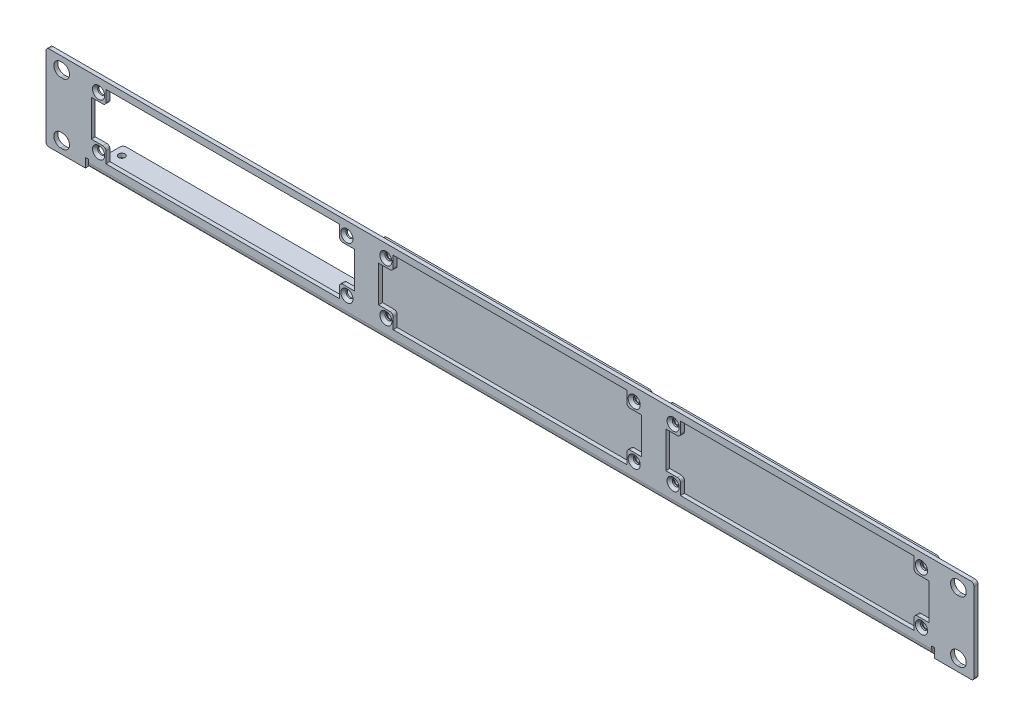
ISO-10303-21;
HEADER;
FILE_DESCRIPTION(('STEP AP214'),'2;1');
FILE_NAME('part.step','',(''),(''),'','','');
FILE_SCHEMA(('AUTOMOTIVE_DESIGN { 1 0 10303 214 1 1 1 1 }'));
ENDSEC;
DATA;
#1=APPLICATION_CONTEXT('core data for automotive mechanical design processes');
#2=APPLICATION_PROTOCOL_DEFINITION('international standard','automotive_design',2000,#1);
#3=PRODUCT_CONTEXT('',#1,'mechanical');
#4=PRODUCT('Part','Part','',(#3));
#5=PRODUCT_RELATED_PRODUCT_CATEGORY('part','',(#4));
#6=PRODUCT_DEFINITION_FORMATION('','',#4);
#7=PRODUCT_DEFINITION_CONTEXT('part definition',#1,'design');
#8=PRODUCT_DEFINITION('design','',#6,#7);
#9=PRODUCT_DEFINITION_SHAPE('','',#8);
#10=(LENGTH_UNIT() NAMED_UNIT(*) SI_UNIT(.MILLI.,.METRE.));
#11=(NAMED_UNIT(*) PLANE_ANGLE_UNIT() SI_UNIT($,.RADIAN.));
#12=(NAMED_UNIT(*) SI_UNIT($,.STERADIAN.) SOLID_ANGLE_UNIT());
#13=UNCERTAINTY_MEASURE_WITH_UNIT(LENGTH_MEASURE(1.E-05),#10,'distance_accuracy_value','');
#14=(GEOMETRIC_REPRESENTATION_CONTEXT(3) GLOBAL_UNCERTAINTY_ASSIGNED_CONTEXT((#13)) GLOBAL_UNIT_ASSIGNED_CONTEXT((#10,
#11,#12)) REPRESENTATION_CONTEXT('',''));
#15=CARTESIAN_POINT('',(0.,0.,0.));
#16=DIRECTION('',(0.,0.,1.));
#17=DIRECTION('',(1.,0.,0.));
#18=AXIS2_PLACEMENT_3D('',#15,#16,#17);
#19=CARTESIAN_POINT('',(-241.046,-22.098,2.0574));
#20=DIRECTION('',(0.,0.,1.));
#21=DIRECTION('',(1.,0.,0.));
#22=AXIS2_PLACEMENT_3D('',#19,#20,#21);
#23=PLANE('',#22);
#24=CARTESIAN_POINT('',(84.725,15.405,2.0574));
#25=DIRECTION('',(0.,0.,1.));
#26=DIRECTION('',(1.,0.,0.));
#27=AXIS2_PLACEMENT_3D('',#24,#25,#26);
#28=CIRCLE('',#27,3.15);
#29=CARTESIAN_POINT('',(87.875,15.405,2.0574));
#30=VERTEX_POINT('',#29);
#31=EDGE_CURVE('P0_E670',#30,#30,#28,.T.);
#32=ORIENTED_EDGE('',*,*,#31,.F.);
#33=EDGE_LOOP('',(#32));
#34=FACE_BOUND('',#33,.T.);
#35=CARTESIAN_POINT('',(84.725,-11.595,2.0574));
#36=DIRECTION('',(0.,0.,1.));
#37=DIRECTION('',(1.,0.,0.));
#38=AXIS2_PLACEMENT_3D('',#35,#36,#37);
#39=CIRCLE('',#38,3.15);
#40=CARTESIAN_POINT('',(87.875,-11.595,2.0574));
#41=VERTEX_POINT('',#40);
#42=EDGE_CURVE('P0_E679',#41,#41,#39,.T.);
#43=ORIENTED_EDGE('',*,*,#42,.F.);
#44=EDGE_LOOP('',(#43));
#45=FACE_BOUND('',#44,.T.);
#46=CARTESIAN_POINT('',(213.725,-11.595,2.0574));
#47=DIRECTION('',(0.,0.,1.));
#48=DIRECTION('',(1.,0.,0.));
#49=AXIS2_PLACEMENT_3D('',#46,#47,#48);
#50=CIRCLE('',#49,3.14999999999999);
#51=CARTESIAN_POINT('',(216.875,-11.595,2.0574));
#52=VERTEX_POINT('',#51);
#53=EDGE_CURVE('P0_E688',#52,#52,#50,.T.);
#54=ORIENTED_EDGE('',*,*,#53,.F.);
#55=EDGE_LOOP('',(#54));
#56=FACE_BOUND('',#55,.T.);
#57=CARTESIAN_POINT('',(213.725,15.405,2.0574));
#58=DIRECTION('',(0.,0.,1.));
#59=DIRECTION('',(1.,0.,0.));
#60=AXIS2_PLACEMENT_3D('',#57,#58,#59);
#61=CIRCLE('',#60,3.14999999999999);
#62=CARTESIAN_POINT('',(216.875,15.405,2.0574));
#63=VERTEX_POINT('',#62);
#64=EDGE_CURVE('P0_E697',#63,#63,#61,.T.);
#65=ORIENTED_EDGE('',*,*,#64,.F.);
#66=EDGE_LOOP('',(#65));
#67=FACE_BOUND('',#66,.T.);
#68=CARTESIAN_POINT('',(-213.725,15.405,2.0574));
#69=DIRECTION('',(0.,0.,1.));
#70=DIRECTION('',(1.,0.,0.));
#71=AXIS2_PLACEMENT_3D('',#68,#69,#70);
#72=CIRCLE('',#71,3.14999999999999);
#73=CARTESIAN_POINT('',(-210.575,15.405,2.0574));
#74=VERTEX_POINT('',#73);
#75=EDGE_CURVE('P0_E706',#74,#74,#72,.T.);
#76=ORIENTED_EDGE('',*,*,#75,.F.);
#77=EDGE_LOOP('',(#76));
#78=FACE_BOUND('',#77,.T.);
#79=CARTESIAN_POINT('',(-213.725,-11.595,2.0574));
#80=DIRECTION('',(0.,0.,1.));
#81=DIRECTION('',(1.,0.,0.));
#82=AXIS2_PLACEMENT_3D('',#79,#80,#81);
#83=CIRCLE('',#82,3.14999999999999);
#84=CARTESIAN_POINT('',(-210.575,-11.595,2.0574));
#85=VERTEX_POINT('',#84);
#86=EDGE_CURVE('P0_E715',#85,#85,#83,.T.);
#87=ORIENTED_EDGE('',*,*,#86,.F.);
#88=EDGE_LOOP('',(#87));
#89=FACE_BOUND('',#88,.T.);
#90=CARTESIAN_POINT('',(-84.725,-11.595,2.0574));
#91=DIRECTION('',(0.,0.,1.));
#92=DIRECTION('',(1.,0.,0.));
#93=AXIS2_PLACEMENT_3D('',#90,#91,#92);
#94=CIRCLE('',#93,3.15);
#95=CARTESIAN_POINT('',(-81.575,-11.595,2.0574));
#96=VERTEX_POINT('',#95);
#97=EDGE_CURVE('P0_E724',#96,#96,#94,.T.);
#98=ORIENTED_EDGE('',*,*,#97,.F.);
#99=EDGE_LOOP('',(#98));
#100=FACE_BOUND('',#99,.T.);
#101=CARTESIAN_POINT('',(-84.725,15.405,2.0574));
#102=DIRECTION('',(0.,0.,1.));
#103=DIRECTION('',(1.,0.,0.));
#104=AXIS2_PLACEMENT_3D('',#101,#102,#103);
#105=CIRCLE('',#104,3.15);
#106=CARTESIAN_POINT('',(-81.575,15.405,2.0574));
#107=VERTEX_POINT('',#106);
#108=EDGE_CURVE('P0_E733',#107,#107,#105,.T.);
#109=ORIENTED_EDGE('',*,*,#108,.F.);
#110=EDGE_LOOP('',(#109));
#111=FACE_BOUND('',#110,.T.);
#112=CARTESIAN_POINT('',(-64.5,15.405,2.0574));
#113=DIRECTION('',(0.,0.,1.));
#114=DIRECTION('',(1.,0.,0.));
#115=AXIS2_PLACEMENT_3D('',#112,#113,#114);
#116=CIRCLE('',#115,3.15);
#117=CARTESIAN_POINT('',(-61.35,15.405,2.0574));
#118=VERTEX_POINT('',#117);
#119=EDGE_CURVE('P0_E878',#118,#118,#116,.T.);
#120=ORIENTED_EDGE('',*,*,#119,.F.);
#121=EDGE_LOOP('',(#120));
#122=FACE_BOUND('',#121,.T.);
#123=CARTESIAN_POINT('',(-64.5,-11.595,2.0574));
#124=DIRECTION('',(0.,0.,1.));
#125=DIRECTION('',(1.,0.,0.));
#126=AXIS2_PLACEMENT_3D('',#123,#124,#125);
#127=CIRCLE('',#126,3.15);
#128=CARTESIAN_POINT('',(-61.35,-11.595,2.0574));
#129=VERTEX_POINT('',#128);
#130=EDGE_CURVE('P0_E1019',#129,#129,#127,.T.);
#131=ORIENTED_EDGE('',*,*,#130,.F.);
#132=EDGE_LOOP('',(#131));
#133=FACE_BOUND('',#132,.T.);
#134=CARTESIAN_POINT('',(64.5,-11.595,2.0574));
#135=DIRECTION('',(0.,0.,1.));
#136=DIRECTION('',(1.,0.,0.));
#137=AXIS2_PLACEMENT_3D('',#134,#135,#136);
#138=CIRCLE('',#137,3.15);
#139=CARTESIAN_POINT('',(67.65,-11.595,2.0574));
#140=VERTEX_POINT('',#139);
#141=EDGE_CURVE('P0_E1028',#140,#140,#138,.T.);
#142=ORIENTED_EDGE('',*,*,#141,.F.);
#143=EDGE_LOOP('',(#142));
#144=FACE_BOUND('',#143,.T.);
#145=CARTESIAN_POINT('',(64.5,15.405,2.0574));
#146=DIRECTION('',(0.,0.,1.));
#147=DIRECTION('',(1.,0.,0.));
#148=AXIS2_PLACEMENT_3D('',#145,#146,#147);
#149=CIRCLE('',#148,3.15);
#150=CARTESIAN_POINT('',(67.65,15.405,2.0574));
#151=VERTEX_POINT('',#150);
#152=EDGE_CURVE('P0_E1037',#151,#151,#149,.T.);
#153=ORIENTED_EDGE('',*,*,#152,.F.);
#154=EDGE_LOOP('',(#153));
#155=FACE_BOUND('',#154,.T.);
#156=DIRECTION('',(1.,0.,0.));
#157=VECTOR('',#156,1.);
#158=CARTESIAN_POINT('',(0.,-19.431,2.0574));
#159=LINE('',#158,#157);
#160=CARTESIAN_POINT('',(232.41,-19.431,2.0574));
#161=VERTEX_POINT('',#160);
#162=CARTESIAN_POINT('',(233.426,-19.431,2.0574));
#163=VERTEX_POINT('',#162);
#164=EDGE_CURVE('P0_E1211',#161,#163,#159,.T.);
#165=ORIENTED_EDGE('',*,*,#164,.F.);
#166=CARTESIAN_POINT('',(232.41,-15.875,2.0574));
#167=DIRECTION('',(0.,0.,1.));
#168=DIRECTION('',(1.,0.,0.));
#169=AXIS2_PLACEMENT_3D('',#166,#167,#168);
#170=CIRCLE('',#169,3.556);
#171=CARTESIAN_POINT('',(232.41,-12.319,2.0574));
#172=VERTEX_POINT('',#171);
#173=EDGE_CURVE('P0_E1201',#172,#161,#170,.T.);
#174=ORIENTED_EDGE('',*,*,#173,.F.);
#175=DIRECTION('',(1.,0.,0.));
#176=VECTOR('',#175,1.);
#177=CARTESIAN_POINT('',(0.,-12.319,2.0574));
#178=LINE('',#177,#176);
#179=CARTESIAN_POINT('',(233.426,-12.319,2.0574));
#180=VERTEX_POINT('',#179);
#181=EDGE_CURVE('P0_E1204',#172,#180,#178,.T.);
#182=ORIENTED_EDGE('',*,*,#181,.T.);
#183=CARTESIAN_POINT('',(233.426,-15.875,2.0574));
#184=DIRECTION('',(0.,0.,1.));
#185=DIRECTION('',(1.,0.,0.));
#186=AXIS2_PLACEMENT_3D('',#183,#184,#185);
#187=CIRCLE('',#186,3.556);
#188=EDGE_CURVE('P0_E1208',#163,#180,#187,.T.);
#189=ORIENTED_EDGE('',*,*,#188,.F.);
#190=EDGE_LOOP('',(#165,#174,#182,#189));
#191=FACE_BOUND('',#190,.T.);
#192=DIRECTION('',(1.,0.,0.));
#193=VECTOR('',#192,1.);
#194=CARTESIAN_POINT('',(0.,12.3189999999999,2.0574));
#195=LINE('',#194,#193);
#196=CARTESIAN_POINT('',(232.41,12.3189999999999,2.0574));
#197=VERTEX_POINT('',#196);
#198=CARTESIAN_POINT('',(233.426,12.3189999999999,2.0574));
#199=VERTEX_POINT('',#198);
#200=EDGE_CURVE('P0_E1213',#197,#199,#195,.T.);
#201=ORIENTED_EDGE('',*,*,#200,.F.);
#202=CARTESIAN_POINT('',(232.41,15.875,2.0574));
#203=DIRECTION('',(0.,0.,1.));
#204=DIRECTION('',(1.,0.,0.));
#205=AXIS2_PLACEMENT_3D('',#202,#203,#204);
#206=CIRCLE('',#205,3.55600000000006);
#207=CARTESIAN_POINT('',(232.41,19.4310000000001,2.0574));
#208=VERTEX_POINT('',#207);
#209=EDGE_CURVE('P0_E1228',#208,#197,#206,.T.);
#210=ORIENTED_EDGE('',*,*,#209,.F.);
#211=DIRECTION('',(1.,0.,0.));
#212=VECTOR('',#211,1.);
#213=CARTESIAN_POINT('',(0.,19.4310000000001,2.0574));
#214=LINE('',#213,#212);
#215=CARTESIAN_POINT('',(233.426,19.4310000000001,2.0574));
#216=VERTEX_POINT('',#215);
#217=EDGE_CURVE('P0_E1242',#208,#216,#214,.T.);
#218=ORIENTED_EDGE('',*,*,#217,.T.);
#219=CARTESIAN_POINT('',(233.426,15.875,2.0574));
#220=DIRECTION('',(0.,0.,1.));
#221=DIRECTION('',(1.,0.,0.));
#222=AXIS2_PLACEMENT_3D('',#219,#220,#221);
#223=CIRCLE('',#222,3.55600000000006);
#224=EDGE_CURVE('P0_E1239',#199,#216,#223,.T.);
#225=ORIENTED_EDGE('',*,*,#224,.F.);
#226=EDGE_LOOP('',(#201,#210,#218,#225));
#227=FACE_BOUND('',#226,.T.);
#228=DIRECTION('',(-1.,0.,0.));
#229=VECTOR('',#228,1.);
#230=CARTESIAN_POINT('',(0.,12.3189999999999,2.0574));
#231=LINE('',#230,#229);
#232=CARTESIAN_POINT('',(-232.41,12.3189999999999,2.0574));
#233=VERTEX_POINT('',#232);
#234=CARTESIAN_POINT('',(-233.426,12.3189999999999,2.0574));
#235=VERTEX_POINT('',#234);
#236=EDGE_CURVE('P0_E1177',#233,#235,#231,.T.);
#237=ORIENTED_EDGE('',*,*,#236,.T.);
#238=CARTESIAN_POINT('',(-233.426,15.875,2.0574));
#239=DIRECTION('',(0.,0.,1.));
#240=DIRECTION('',(1.,0.,0.));
#241=AXIS2_PLACEMENT_3D('',#238,#239,#240);
#242=CIRCLE('',#241,3.55600000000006);
#243=CARTESIAN_POINT('',(-233.426,19.4310000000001,2.0574));
#244=VERTEX_POINT('',#243);
#245=EDGE_CURVE('P0_E1180',#235,#244,#242,.F.);
#246=ORIENTED_EDGE('',*,*,#245,.T.);
#247=DIRECTION('',(-1.,0.,0.));
#248=VECTOR('',#247,1.);
#249=CARTESIAN_POINT('',(0.,19.4310000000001,2.0574));
#250=LINE('',#249,#248);
#251=CARTESIAN_POINT('',(-232.41,19.4310000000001,2.0574));
#252=VERTEX_POINT('',#251);
#253=EDGE_CURVE('P0_E1170',#252,#244,#250,.T.);
#254=ORIENTED_EDGE('',*,*,#253,.F.);
#255=CARTESIAN_POINT('',(-232.41,15.875,2.0574));
#256=DIRECTION('',(0.,0.,1.));
#257=DIRECTION('',(1.,0.,0.));
#258=AXIS2_PLACEMENT_3D('',#255,#256,#257);
#259=CIRCLE('',#258,3.55600000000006);
#260=EDGE_CURVE('P0_E1173',#252,#233,#259,.F.);
#261=ORIENTED_EDGE('',*,*,#260,.T.);
#262=EDGE_LOOP('',(#237,#246,#254,#261));
#263=FACE_BOUND('',#262,.T.);
#264=DIRECTION('',(-1.,0.,0.));
#265=VECTOR('',#264,1.);
#266=CARTESIAN_POINT('',(0.,-19.431,2.0574));
#267=LINE('',#266,#265);
#268=CARTESIAN_POINT('',(-232.41,-19.431,2.0574));
#269=VERTEX_POINT('',#268);
#270=CARTESIAN_POINT('',(-233.426,-19.431,2.0574));
#271=VERTEX_POINT('',#270);
#272=EDGE_CURVE('P0_E1146',#269,#271,#267,.T.);
#273=ORIENTED_EDGE('',*,*,#272,.T.);
#274=CARTESIAN_POINT('',(-233.426,-15.875,2.0574));
#275=DIRECTION('',(0.,0.,1.));
#276=DIRECTION('',(1.,0.,0.));
#277=AXIS2_PLACEMENT_3D('',#274,#275,#276);
#278=CIRCLE('',#277,3.556);
#279=CARTESIAN_POINT('',(-233.426,-12.319,2.0574));
#280=VERTEX_POINT('',#279);
#281=EDGE_CURVE('P0_E1149',#271,#280,#278,.F.);
#282=ORIENTED_EDGE('',*,*,#281,.T.);
#283=DIRECTION('',(-1.,0.,0.));
#284=VECTOR('',#283,1.);
#285=CARTESIAN_POINT('',(0.,-12.319,2.0574));
#286=LINE('',#285,#284);
#287=CARTESIAN_POINT('',(-232.41,-12.319,2.0574));
#288=VERTEX_POINT('',#287);
#289=EDGE_CURVE('P0_E1139',#288,#280,#286,.T.);
#290=ORIENTED_EDGE('',*,*,#289,.F.);
#291=CARTESIAN_POINT('',(-232.41,-15.875,2.0574));
#292=DIRECTION('',(0.,0.,1.));
#293=DIRECTION('',(1.,0.,0.));
#294=AXIS2_PLACEMENT_3D('',#291,#292,#293);
#295=CIRCLE('',#294,3.556);
#296=EDGE_CURVE('P0_E1142',#288,#269,#295,.F.);
#297=ORIENTED_EDGE('',*,*,#296,.T.);
#298=EDGE_LOOP('',(#273,#282,#290,#297));
#299=FACE_BOUND('',#298,.T.);
#300=DIRECTION('',(0.,-1.,0.));
#301=VECTOR('',#300,1.);
#302=CARTESIAN_POINT('',(-60.69,1.71512953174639E-13,2.0574));
#303=LINE('',#302,#301);
#304=CARTESIAN_POINT('',(-60.69,-9.0805,2.0574));
#305=VERTEX_POINT('',#304);
#306=CARTESIAN_POINT('',(-60.69,-14.859,2.0574));
#307=VERTEX_POINT('',#306);
#308=EDGE_CURVE('P0_E1106',#305,#307,#303,.T.);
#309=ORIENTED_EDGE('',*,*,#308,.F.);
#310=CARTESIAN_POINT('',(-62.2775,-9.0805,2.0574));
#311=DIRECTION('',(0.,0.,1.));
#312=DIRECTION('',(1.,0.,0.));
#313=AXIS2_PLACEMENT_3D('',#310,#311,#312);
#314=CIRCLE('',#313,1.5875);
#315=CARTESIAN_POINT('',(-62.2775,-7.49299999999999,2.0574));
#316=VERTEX_POINT('',#315);
#317=EDGE_CURVE('P0_E1288',#305,#316,#314,.T.);
#318=ORIENTED_EDGE('',*,*,#317,.T.);
#319=DIRECTION('',(1.,0.,0.));
#320=VECTOR('',#319,1.);
#321=CARTESIAN_POINT('',(0.,-7.49299999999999,2.0574));
#322=LINE('',#321,#320);
#323=CARTESIAN_POINT('',(-68.31,-7.49299999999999,2.0574));
#324=VERTEX_POINT('',#323);
#325=EDGE_CURVE('P0_E1103',#324,#316,#322,.T.);
#326=ORIENTED_EDGE('',*,*,#325,.F.);
#327=DIRECTION('',(0.,1.,0.));
#328=VECTOR('',#327,1.);
#329=CARTESIAN_POINT('',(-68.31,0.,2.0574));
#330=LINE('',#329,#328);
#331=CARTESIAN_POINT('',(-68.31,11.303,2.0574));
#332=VERTEX_POINT('',#331);
#333=EDGE_CURVE('P0_E1100',#324,#332,#330,.T.);
#334=ORIENTED_EDGE('',*,*,#333,.T.);
#335=DIRECTION('',(-1.,0.,0.));
#336=VECTOR('',#335,1.);
#337=CARTESIAN_POINT('',(0.,11.303,2.0574));
#338=LINE('',#337,#336);
#339=CARTESIAN_POINT('',(-62.2775,11.303,2.0574));
#340=VERTEX_POINT('',#339);
#341=EDGE_CURVE('P0_E1098',#340,#332,#338,.T.);
#342=ORIENTED_EDGE('',*,*,#341,.F.);
#343=CARTESIAN_POINT('',(-62.2775,12.8905,2.0574));
#344=DIRECTION('',(0.,0.,1.));
#345=DIRECTION('',(1.,0.,0.));
#346=AXIS2_PLACEMENT_3D('',#343,#344,#345);
#347=CIRCLE('',#346,1.5875);
#348=CARTESIAN_POINT('',(-60.69,12.8905,2.0574));
#349=VERTEX_POINT('',#348);
#350=EDGE_CURVE('P0_E1286',#340,#349,#347,.T.);
#351=ORIENTED_EDGE('',*,*,#350,.T.);
#352=DIRECTION('',(0.,-1.,0.));
#353=VECTOR('',#352,1.);
#354=CARTESIAN_POINT('',(-60.69,0.,2.0574));
#355=LINE('',#354,#353);
#356=CARTESIAN_POINT('',(-60.69,18.669,2.0574));
#357=VERTEX_POINT('',#356);
#358=EDGE_CURVE('P0_E1095',#357,#349,#355,.T.);
#359=ORIENTED_EDGE('',*,*,#358,.F.);
#360=DIRECTION('',(1.,0.,0.));
#361=VECTOR('',#360,1.);
#362=CARTESIAN_POINT('',(0.,18.669,2.0574));
#363=LINE('',#362,#361);
#364=CARTESIAN_POINT('',(60.69,18.669,2.0574));
#365=VERTEX_POINT('',#364);
#366=EDGE_CURVE('P0_E1092',#357,#365,#363,.T.);
#367=ORIENTED_EDGE('',*,*,#366,.T.);
#368=DIRECTION('',(0.,-1.,0.));
#369=VECTOR('',#368,1.);
#370=CARTESIAN_POINT('',(60.69,1.14341968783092E-13,2.0574));
#371=LINE('',#370,#369);
#372=CARTESIAN_POINT('',(60.69,12.8905,2.0574));
#373=VERTEX_POINT('',#372);
#374=EDGE_CURVE('P0_E1089',#365,#373,#371,.T.);
#375=ORIENTED_EDGE('',*,*,#374,.T.);
#376=CARTESIAN_POINT('',(62.2775,12.8905,2.0574));
#377=DIRECTION('',(0.,0.,1.));
#378=DIRECTION('',(1.,0.,0.));
#379=AXIS2_PLACEMENT_3D('',#376,#377,#378);
#380=CIRCLE('',#379,1.5875);
#381=CARTESIAN_POINT('',(62.2775,11.303,2.0574));
#382=VERTEX_POINT('',#381);
#383=EDGE_CURVE('P0_E1284',#373,#382,#380,.T.);
#384=ORIENTED_EDGE('',*,*,#383,.T.);
#385=DIRECTION('',(1.,0.,0.));
#386=VECTOR('',#385,1.);
#387=CARTESIAN_POINT('',(0.,11.303,2.0574));
#388=LINE('',#387,#386);
#389=CARTESIAN_POINT('',(68.31,11.303,2.0574));
#390=VERTEX_POINT('',#389);
#391=EDGE_CURVE('P0_E1087',#382,#390,#388,.T.);
#392=ORIENTED_EDGE('',*,*,#391,.T.);
#393=DIRECTION('',(0.,1.,0.));
#394=VECTOR('',#393,1.);
#395=CARTESIAN_POINT('',(68.31,0.,2.0574));
#396=LINE('',#395,#394);
#397=CARTESIAN_POINT('',(68.31,-7.49299999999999,2.0574));
#398=VERTEX_POINT('',#397);
#399=EDGE_CURVE('P0_E1084',#398,#390,#396,.T.);
#400=ORIENTED_EDGE('',*,*,#399,.F.);
#401=DIRECTION('',(-1.,0.,0.));
#402=VECTOR('',#401,1.);
#403=CARTESIAN_POINT('',(0.,-7.49300000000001,2.0574));
#404=LINE('',#403,#402);
#405=CARTESIAN_POINT('',(62.2775,-7.493,2.0574));
#406=VERTEX_POINT('',#405);
#407=EDGE_CURVE('P0_E1081',#398,#406,#404,.T.);
#408=ORIENTED_EDGE('',*,*,#407,.T.);
#409=CARTESIAN_POINT('',(62.2775,-9.0805,2.0574));
#410=DIRECTION('',(0.,0.,1.));
#411=DIRECTION('',(1.,0.,0.));
#412=AXIS2_PLACEMENT_3D('',#409,#410,#411);
#413=CIRCLE('',#412,1.5875);
#414=CARTESIAN_POINT('',(60.69,-9.08049999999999,2.0574));
#415=VERTEX_POINT('',#414);
#416=EDGE_CURVE('P0_E1282',#406,#415,#413,.T.);
#417=ORIENTED_EDGE('',*,*,#416,.T.);
#418=DIRECTION('',(0.,-1.,0.));
#419=VECTOR('',#418,1.);
#420=CARTESIAN_POINT('',(60.6900000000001,-2.28683937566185E-13,2.0574));
#421=LINE('',#420,#419);
#422=CARTESIAN_POINT('',(60.69,-14.859,2.0574));
#423=VERTEX_POINT('',#422);
#424=EDGE_CURVE('P0_E1046',#415,#423,#421,.T.);
#425=ORIENTED_EDGE('',*,*,#424,.T.);
#426=DIRECTION('',(1.,0.,0.));
#427=VECTOR('',#426,1.);
#428=CARTESIAN_POINT('',(0.,-14.859,2.0574));
#429=LINE('',#428,#427);
#430=EDGE_CURVE('P0_E1050',#307,#423,#429,.T.);
#431=ORIENTED_EDGE('',*,*,#430,.F.);
#432=EDGE_LOOP('',(#309,#318,#326,#334,#342,#351,#359,#367,#375,#384,#392,#400,#408,#417,#425,#431));
#433=FACE_BOUND('',#432,.T.);
#434=CARTESIAN_POINT('',(-86.9475,-9.0805,2.0574));
#435=DIRECTION('',(0.,0.,1.));
#436=DIRECTION('',(1.,0.,0.));
#437=AXIS2_PLACEMENT_3D('',#434,#435,#436);
#438=CIRCLE('',#437,1.5875);
#439=CARTESIAN_POINT('',(-86.9475,-7.493,2.0574));
#440=VERTEX_POINT('',#439);
#441=CARTESIAN_POINT('',(-88.535,-9.08049999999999,2.0574));
#442=VERTEX_POINT('',#441);
#443=EDGE_CURVE('P0_E881',#440,#442,#438,.T.);
#444=ORIENTED_EDGE('',*,*,#443,.T.);
#445=DIRECTION('',(0.,-1.,0.));
#446=VECTOR('',#445,1.);
#447=CARTESIAN_POINT('',(-88.535,-2.28683937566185E-13,2.0574));
#448=LINE('',#447,#446);
#449=CARTESIAN_POINT('',(-88.535,-14.859,2.0574));
#450=VERTEX_POINT('',#449);
#451=EDGE_CURVE('P0_E1006',#442,#450,#448,.T.);
#452=ORIENTED_EDGE('',*,*,#451,.T.);
#453=DIRECTION('',(1.,0.,0.));
#454=VECTOR('',#453,1.);
#455=CARTESIAN_POINT('',(-149.225,-14.859,2.0574));
#456=LINE('',#455,#454);
#457=CARTESIAN_POINT('',(-209.915,-14.859,2.0574));
#458=VERTEX_POINT('',#457);
#459=EDGE_CURVE('P0_E998',#458,#450,#456,.T.);
#460=ORIENTED_EDGE('',*,*,#459,.F.);
#461=DIRECTION('',(0.,-1.,0.));
#462=VECTOR('',#461,1.);
#463=CARTESIAN_POINT('',(-209.915,1.71512953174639E-13,2.0574));
#464=LINE('',#463,#462);
#465=CARTESIAN_POINT('',(-209.915,-9.0805,2.0574));
#466=VERTEX_POINT('',#465);
#467=EDGE_CURVE('P0_E993',#466,#458,#464,.T.);
#468=ORIENTED_EDGE('',*,*,#467,.F.);
#469=CARTESIAN_POINT('',(-211.5025,-9.0805,2.0574));
#470=DIRECTION('',(0.,0.,1.));
#471=DIRECTION('',(1.,0.,0.));
#472=AXIS2_PLACEMENT_3D('',#469,#470,#471);
#473=CIRCLE('',#472,1.5875);
#474=CARTESIAN_POINT('',(-211.5025,-7.49299999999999,2.0574));
#475=VERTEX_POINT('',#474);
#476=EDGE_CURVE('P0_E984',#466,#475,#473,.T.);
#477=ORIENTED_EDGE('',*,*,#476,.T.);
#478=DIRECTION('',(1.,0.,0.));
#479=VECTOR('',#478,1.);
#480=CARTESIAN_POINT('',(-149.225,-7.49299999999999,2.0574));
#481=LINE('',#480,#479);
#482=CARTESIAN_POINT('',(-217.535,-7.49299999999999,2.0574));
#483=VERTEX_POINT('',#482);
#484=EDGE_CURVE('P0_E974',#483,#475,#481,.T.);
#485=ORIENTED_EDGE('',*,*,#484,.F.);
#486=DIRECTION('',(0.,1.,0.));
#487=VECTOR('',#486,1.);
#488=CARTESIAN_POINT('',(-217.535,0.,2.0574));
#489=LINE('',#488,#487);
#490=CARTESIAN_POINT('',(-217.535,11.303,2.0574));
#491=VERTEX_POINT('',#490);
#492=EDGE_CURVE('P0_E965',#483,#491,#489,.T.);
#493=ORIENTED_EDGE('',*,*,#492,.T.);
#494=DIRECTION('',(-1.,0.,0.));
#495=VECTOR('',#494,1.);
#496=CARTESIAN_POINT('',(-149.225,11.303,2.0574));
#497=LINE('',#496,#495);
#498=CARTESIAN_POINT('',(-211.5025,11.303,2.0574));
#499=VERTEX_POINT('',#498);
#500=EDGE_CURVE('P0_E960',#499,#491,#497,.T.);
#501=ORIENTED_EDGE('',*,*,#500,.F.);
#502=CARTESIAN_POINT('',(-211.5025,12.8905,2.0574));
#503=DIRECTION('',(0.,0.,1.));
#504=DIRECTION('',(1.,0.,0.));
#505=AXIS2_PLACEMENT_3D('',#502,#503,#504);
#506=CIRCLE('',#505,1.5875);
#507=CARTESIAN_POINT('',(-209.915,12.8905,2.0574));
#508=VERTEX_POINT('',#507);
#509=EDGE_CURVE('P0_E951',#499,#508,#506,.T.);
#510=ORIENTED_EDGE('',*,*,#509,.T.);
#511=DIRECTION('',(0.,-1.,0.));
#512=VECTOR('',#511,1.);
#513=CARTESIAN_POINT('',(-209.915,0.,2.0574));
#514=LINE('',#513,#512);
#515=CARTESIAN_POINT('',(-209.915,18.669,2.0574));
#516=VERTEX_POINT('',#515);
#517=EDGE_CURVE('P0_E941',#516,#508,#514,.T.);
#518=ORIENTED_EDGE('',*,*,#517,.F.);
#519=DIRECTION('',(1.,0.,0.));
#520=VECTOR('',#519,1.);
#521=CARTESIAN_POINT('',(-149.225,18.669,2.0574));
#522=LINE('',#521,#520);
#523=CARTESIAN_POINT('',(-88.535,18.669,2.0574));
#524=VERTEX_POINT('',#523);
#525=EDGE_CURVE('P0_E932',#516,#524,#522,.T.);
#526=ORIENTED_EDGE('',*,*,#525,.T.);
#527=DIRECTION('',(0.,-1.,0.));
#528=VECTOR('',#527,1.);
#529=CARTESIAN_POINT('',(-88.535,1.14341968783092E-13,2.0574));
#530=LINE('',#529,#528);
#531=CARTESIAN_POINT('',(-88.535,12.8905,2.0574));
#532=VERTEX_POINT('',#531);
#533=EDGE_CURVE('P0_E926',#524,#532,#530,.T.);
#534=ORIENTED_EDGE('',*,*,#533,.T.);
#535=CARTESIAN_POINT('',(-86.9475,12.8905,2.0574));
#536=DIRECTION('',(0.,0.,1.));
#537=DIRECTION('',(1.,0.,0.));
#538=AXIS2_PLACEMENT_3D('',#535,#536,#537);
#539=CIRCLE('',#538,1.5875);
#540=CARTESIAN_POINT('',(-86.9475,11.303,2.0574));
#541=VERTEX_POINT('',#540);
#542=EDGE_CURVE('P0_E917',#532,#541,#539,.T.);
#543=ORIENTED_EDGE('',*,*,#542,.T.);
#544=DIRECTION('',(1.,0.,0.));
#545=VECTOR('',#544,1.);
#546=CARTESIAN_POINT('',(-149.225,11.303,2.0574));
#547=LINE('',#546,#545);
#548=CARTESIAN_POINT('',(-80.915,11.303,2.0574));
#549=VERTEX_POINT('',#548);
#550=EDGE_CURVE('P0_E906',#541,#549,#547,.T.);
#551=ORIENTED_EDGE('',*,*,#550,.T.);
#552=DIRECTION('',(0.,1.,0.));
#553=VECTOR('',#552,1.);
#554=CARTESIAN_POINT('',(-80.915,0.,2.0574));
#555=LINE('',#554,#553);
#556=CARTESIAN_POINT('',(-80.915,-7.49299999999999,2.0574));
#557=VERTEX_POINT('',#556);
#558=EDGE_CURVE('P0_E898',#557,#549,#555,.T.);
#559=ORIENTED_EDGE('',*,*,#558,.F.);
#560=DIRECTION('',(-1.,0.,0.));
#561=VECTOR('',#560,1.);
#562=CARTESIAN_POINT('',(-149.225,-7.49300000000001,2.0574));
#563=LINE('',#562,#561);
#564=EDGE_CURVE('P0_E892',#557,#440,#563,.T.);
#565=ORIENTED_EDGE('',*,*,#564,.T.);
#566=EDGE_LOOP('',(#444,#452,#460,#468,#477,#485,#493,#501,#510,#518,#526,#534,#543,#551,#559,#565));
#567=FACE_BOUND('',#566,.T.);
#568=CARTESIAN_POINT('',(211.5025,-9.0805,2.0574));
#569=DIRECTION('',(0.,0.,1.));
#570=DIRECTION('',(1.,0.,0.));
#571=AXIS2_PLACEMENT_3D('',#568,#569,#570);
#572=CIRCLE('',#571,1.5875);
#573=CARTESIAN_POINT('',(211.5025,-7.493,2.0574));
#574=VERTEX_POINT('',#573);
#575=CARTESIAN_POINT('',(209.915,-9.08049999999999,2.0574));
#576=VERTEX_POINT('',#575);
#577=EDGE_CURVE('P0_E746',#574,#576,#572,.T.);
#578=ORIENTED_EDGE('',*,*,#577,.T.);
#579=DIRECTION('',(0.,-1.,0.));
#580=VECTOR('',#579,1.);
#581=CARTESIAN_POINT('',(209.915,-2.28683937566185E-13,2.0574));
#582=LINE('',#581,#580);
#583=CARTESIAN_POINT('',(209.915,-14.859,2.0574));
#584=VERTEX_POINT('',#583);
#585=EDGE_CURVE('P0_E872',#576,#584,#582,.T.);
#586=ORIENTED_EDGE('',*,*,#585,.T.);
#587=DIRECTION('',(1.,0.,0.));
#588=VECTOR('',#587,1.);
#589=CARTESIAN_POINT('',(149.225,-14.859,2.0574));
#590=LINE('',#589,#588);
#591=CARTESIAN_POINT('',(88.535,-14.859,2.0574));
#592=VERTEX_POINT('',#591);
#593=EDGE_CURVE('P0_E864',#592,#584,#590,.T.);
#594=ORIENTED_EDGE('',*,*,#593,.F.);
#595=DIRECTION('',(0.,-1.,0.));
#596=VECTOR('',#595,1.);
#597=CARTESIAN_POINT('',(88.535,1.71512953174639E-13,2.0574));
#598=LINE('',#597,#596);
#599=CARTESIAN_POINT('',(88.535,-9.0805,2.0574));
#600=VERTEX_POINT('',#599);
#601=EDGE_CURVE('P0_E859',#600,#592,#598,.T.);
#602=ORIENTED_EDGE('',*,*,#601,.F.);
#603=CARTESIAN_POINT('',(86.9475,-9.0805,2.0574));
#604=DIRECTION('',(0.,0.,1.));
#605=DIRECTION('',(1.,0.,0.));
#606=AXIS2_PLACEMENT_3D('',#603,#604,#605);
#607=CIRCLE('',#606,1.5875);
#608=CARTESIAN_POINT('',(86.9475,-7.49299999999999,2.0574));
#609=VERTEX_POINT('',#608);
#610=EDGE_CURVE('P0_E850',#600,#609,#607,.T.);
#611=ORIENTED_EDGE('',*,*,#610,.T.);
#612=DIRECTION('',(1.,0.,0.));
#613=VECTOR('',#612,1.);
#614=CARTESIAN_POINT('',(149.225,-7.49299999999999,2.0574));
#615=LINE('',#614,#613);
#616=CARTESIAN_POINT('',(80.915,-7.49299999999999,2.0574));
#617=VERTEX_POINT('',#616);
#618=EDGE_CURVE('P0_E840',#617,#609,#615,.T.);
#619=ORIENTED_EDGE('',*,*,#618,.F.);
#620=DIRECTION('',(0.,1.,0.));
#621=VECTOR('',#620,1.);
#622=CARTESIAN_POINT('',(80.915,0.,2.0574));
#623=LINE('',#622,#621);
#624=CARTESIAN_POINT('',(80.915,11.303,2.0574));
#625=VERTEX_POINT('',#624);
#626=EDGE_CURVE('P0_E831',#617,#625,#623,.T.);
#627=ORIENTED_EDGE('',*,*,#626,.T.);
#628=DIRECTION('',(-1.,0.,0.));
#629=VECTOR('',#628,1.);
#630=CARTESIAN_POINT('',(149.225,11.303,2.0574));
#631=LINE('',#630,#629);
#632=CARTESIAN_POINT('',(86.9475,11.303,2.0574));
#633=VERTEX_POINT('',#632);
#634=EDGE_CURVE('P0_E826',#633,#625,#631,.T.);
#635=ORIENTED_EDGE('',*,*,#634,.F.);
#636=CARTESIAN_POINT('',(86.9475,12.8905,2.0574));
#637=DIRECTION('',(0.,0.,1.));
#638=DIRECTION('',(1.,0.,0.));
#639=AXIS2_PLACEMENT_3D('',#636,#637,#638);
#640=CIRCLE('',#639,1.5875);
#641=CARTESIAN_POINT('',(88.535,12.8905,2.0574));
#642=VERTEX_POINT('',#641);
#643=EDGE_CURVE('P0_E817',#633,#642,#640,.T.);
#644=ORIENTED_EDGE('',*,*,#643,.T.);
#645=DIRECTION('',(0.,-1.,0.));
#646=VECTOR('',#645,1.);
#647=CARTESIAN_POINT('',(88.535,0.,2.0574));
#648=LINE('',#647,#646);
#649=CARTESIAN_POINT('',(88.535,18.669,2.0574));
#650=VERTEX_POINT('',#649);
#651=EDGE_CURVE('P0_E807',#650,#642,#648,.T.);
#652=ORIENTED_EDGE('',*,*,#651,.F.);
#653=DIRECTION('',(1.,0.,0.));
#654=VECTOR('',#653,1.);
#655=CARTESIAN_POINT('',(149.225,18.669,2.0574));
#656=LINE('',#655,#654);
#657=CARTESIAN_POINT('',(209.915,18.669,2.0574));
#658=VERTEX_POINT('',#657);
#659=EDGE_CURVE('P0_E798',#650,#658,#656,.T.);
#660=ORIENTED_EDGE('',*,*,#659,.T.);
#661=DIRECTION('',(0.,-1.,0.));
#662=VECTOR('',#661,1.);
#663=CARTESIAN_POINT('',(209.915,1.14341968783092E-13,2.0574));
#664=LINE('',#663,#662);
#665=CARTESIAN_POINT('',(209.915,12.8905,2.0574));
#666=VERTEX_POINT('',#665);
#667=EDGE_CURVE('P0_E792',#658,#666,#664,.T.);
#668=ORIENTED_EDGE('',*,*,#667,.T.);
#669=CARTESIAN_POINT('',(211.5025,12.8905,2.0574));
#670=DIRECTION('',(0.,0.,1.));
#671=DIRECTION('',(1.,0.,0.));
#672=AXIS2_PLACEMENT_3D('',#669,#670,#671);
#673=CIRCLE('',#672,1.5875);
#674=CARTESIAN_POINT('',(211.5025,11.303,2.0574));
#675=VERTEX_POINT('',#674);
#676=EDGE_CURVE('P0_E783',#666,#675,#673,.T.);
#677=ORIENTED_EDGE('',*,*,#676,.T.);
#678=DIRECTION('',(1.,0.,0.));
#679=VECTOR('',#678,1.);
#680=CARTESIAN_POINT('',(149.225,11.303,2.0574));
#681=LINE('',#680,#679);
#682=CARTESIAN_POINT('',(217.535,11.303,2.0574));
#683=VERTEX_POINT('',#682);
#684=EDGE_CURVE('P0_E772',#675,#683,#681,.T.);
#685=ORIENTED_EDGE('',*,*,#684,.T.);
#686=DIRECTION('',(0.,1.,0.));
#687=VECTOR('',#686,1.);
#688=CARTESIAN_POINT('',(217.535,0.,2.0574));
#689=LINE('',#688,#687);
#690=CARTESIAN_POINT('',(217.535,-7.49299999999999,2.0574));
#691=VERTEX_POINT('',#690);
#692=EDGE_CURVE('P0_E764',#691,#683,#689,.T.);
#693=ORIENTED_EDGE('',*,*,#692,.F.);
#694=DIRECTION('',(-1.,0.,0.));
#695=VECTOR('',#694,1.);
#696=CARTESIAN_POINT('',(149.225,-7.49300000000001,2.0574));
#697=LINE('',#696,#695);
#698=EDGE_CURVE('P0_E758',#691,#574,#697,.T.);
#699=ORIENTED_EDGE('',*,*,#698,.T.);
#700=EDGE_LOOP('',(#578,#586,#594,#602,#611,#619,#627,#635,#644,#652,#660,#668,#677,#685,#693,#699));
#701=FACE_BOUND('',#700,.T.);
#702=DIRECTION('',(-1.,0.,0.));
#703=VECTOR('',#702,1.);
#704=CARTESIAN_POINT('',(241.046,22.098,2.0574));
#705=LINE('',#704,#703);
#706=CARTESIAN_POINT('',(239.4585,22.098,2.0574));
#707=VERTEX_POINT('',#706);
#708=CARTESIAN_POINT('',(-239.4585,22.098,2.0574));
#709=VERTEX_POINT('',#708);
#710=EDGE_CURVE('P0_E1266',#707,#709,#705,.T.);
#711=ORIENTED_EDGE('',*,*,#710,.T.);
#712=CARTESIAN_POINT('',(-239.4585,20.5105,2.0574));
#713=DIRECTION('',(0.,0.,1.));
#714=DIRECTION('',(1.,0.,0.));
#715=AXIS2_PLACEMENT_3D('',#712,#713,#714);
#716=CIRCLE('',#715,1.5875);
#717=CARTESIAN_POINT('',(-241.046,20.5105,2.0574));
#718=VERTEX_POINT('',#717);
#719=EDGE_CURVE('P0_E1339',#709,#718,#716,.T.);
#720=ORIENTED_EDGE('',*,*,#719,.T.);
#721=DIRECTION('',(0.,-1.,0.));
#722=VECTOR('',#721,1.);
#723=CARTESIAN_POINT('',(-241.046,22.098,2.0574));
#724=LINE('',#723,#722);
#725=CARTESIAN_POINT('',(-241.046,-20.5105,2.0574));
#726=VERTEX_POINT('',#725);
#727=EDGE_CURVE('P0_E1256',#718,#726,#724,.T.);
#728=ORIENTED_EDGE('',*,*,#727,.T.);
#729=CARTESIAN_POINT('',(-239.4585,-20.5105,2.0574));
#730=DIRECTION('',(0.,0.,1.));
#731=DIRECTION('',(1.,0.,0.));
#732=AXIS2_PLACEMENT_3D('',#729,#730,#731);
#733=CIRCLE('',#732,1.5875);
#734=CARTESIAN_POINT('',(-239.4585,-22.098,2.0574));
#735=VERTEX_POINT('',#734);
#736=EDGE_CURVE('P0_E1337',#726,#735,#733,.T.);
#737=ORIENTED_EDGE('',*,*,#736,.T.);
#738=DIRECTION('',(1.,0.,0.));
#739=VECTOR('',#738,1.);
#740=CARTESIAN_POINT('',(-241.046,-22.098,2.0574));
#741=LINE('',#740,#739);
#742=CARTESIAN_POINT('',(-220.599,-22.098,2.0574));
#743=VERTEX_POINT('',#742);
#744=EDGE_CURVE('P0_E1261',#735,#743,#741,.T.);
#745=ORIENTED_EDGE('',*,*,#744,.T.);
#746=DIRECTION('',(0.,1.,0.));
#747=VECTOR('',#746,1.);
#748=CARTESIAN_POINT('',(-220.599,-22.098,2.0574));
#749=LINE('',#748,#747);
#750=CARTESIAN_POINT('',(-220.599,-17.2466,2.0574));
#751=VERTEX_POINT('',#750);
#752=EDGE_CURVE('P0_E660',#743,#751,#749,.T.);
#753=ORIENTED_EDGE('',*,*,#752,.T.);
#754=DIRECTION('',(1.,0.,0.));
#755=VECTOR('',#754,1.);
#756=CARTESIAN_POINT('',(-241.046,-17.2466,2.0574));
#757=LINE('',#756,#755);
#758=CARTESIAN_POINT('',(-219.075,-17.2466,2.0574));
#759=VERTEX_POINT('',#758);
#760=EDGE_CURVE('P0_E668',#751,#759,#757,.T.);
#761=ORIENTED_EDGE('',*,*,#760,.T.);
#762=DIRECTION('',(0.,-1.,0.));
#763=VECTOR('',#762,1.);
#764=CARTESIAN_POINT('',(-219.075,-22.098,2.0574));
#765=LINE('',#764,#763);
#766=CARTESIAN_POINT('',(-219.075,-18.7706,2.05740000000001));
#767=VERTEX_POINT('',#766);
#768=EDGE_CURVE('P0_E666',#759,#767,#765,.T.);
#769=ORIENTED_EDGE('',*,*,#768,.T.);
#770=DIRECTION('',(-1.,0.,0.));
#771=VECTOR('',#770,1.);
#772=CARTESIAN_POINT('',(-219.075,-18.7706,2.05740000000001));
#773=LINE('',#772,#771);
#774=CARTESIAN_POINT('',(219.075,-18.7706,2.0574));
#775=VERTEX_POINT('',#774);
#776=EDGE_CURVE('P0_E559',#767,#775,#773,.F.);
#777=ORIENTED_EDGE('',*,*,#776,.T.);
#778=DIRECTION('',(0.,1.,0.));
#779=VECTOR('',#778,1.);
#780=CARTESIAN_POINT('',(219.075,-22.098,2.0574));
#781=LINE('',#780,#779);
#782=CARTESIAN_POINT('',(219.075,-17.2466,2.0574));
#783=VERTEX_POINT('',#782);
#784=EDGE_CURVE('P0_E664',#775,#783,#781,.T.);
#785=ORIENTED_EDGE('',*,*,#784,.T.);
#786=DIRECTION('',(1.,0.,0.));
#787=VECTOR('',#786,1.);
#788=CARTESIAN_POINT('',(-241.046,-17.2466,2.0574));
#789=LINE('',#788,#787);
#790=CARTESIAN_POINT('',(220.599,-17.2466,2.0574));
#791=VERTEX_POINT('',#790);
#792=EDGE_CURVE('P0_E662',#783,#791,#789,.T.);
#793=ORIENTED_EDGE('',*,*,#792,.T.);
#794=DIRECTION('',(0.,-1.,0.));
#795=VECTOR('',#794,1.);
#796=CARTESIAN_POINT('',(220.599,-22.098,2.0574));
#797=LINE('',#796,#795);
#798=CARTESIAN_POINT('',(220.599,-22.098,2.0574));
#799=VERTEX_POINT('',#798);
#800=EDGE_CURVE('P0_E625',#791,#799,#797,.T.);
#801=ORIENTED_EDGE('',*,*,#800,.T.);
#802=CARTESIAN_POINT('',(239.4585,-22.098,2.0574));
#803=VERTEX_POINT('',#802);
#804=EDGE_CURVE('P0_E1259',#799,#803,#741,.T.);
#805=ORIENTED_EDGE('',*,*,#804,.T.);
#806=CARTESIAN_POINT('',(239.4585,-20.5105,2.0574));
#807=DIRECTION('',(0.,0.,1.));
#808=DIRECTION('',(1.,0.,0.));
#809=AXIS2_PLACEMENT_3D('',#806,#807,#808);
#810=CIRCLE('',#809,1.5875);
#811=CARTESIAN_POINT('',(241.046,-20.5105,2.0574));
#812=VERTEX_POINT('',#811);
#813=EDGE_CURVE('P0_E1335',#803,#812,#810,.T.);
#814=ORIENTED_EDGE('',*,*,#813,.T.);
#815=DIRECTION('',(0.,1.,0.));
#816=VECTOR('',#815,1.);
#817=CARTESIAN_POINT('',(241.046,-22.098,2.0574));
#818=LINE('',#817,#816);
#819=CARTESIAN_POINT('',(241.046,20.5105,2.0574));
#820=VERTEX_POINT('',#819);
#821=EDGE_CURVE('P0_E1263',#812,#820,#818,.T.);
#822=ORIENTED_EDGE('',*,*,#821,.T.);
#823=CARTESIAN_POINT('',(239.4585,20.5105,2.0574));
#824=DIRECTION('',(0.,0.,1.));
#825=DIRECTION('',(1.,0.,0.));
#826=AXIS2_PLACEMENT_3D('',#823,#824,#825);
#827=CIRCLE('',#826,1.5875);
#828=EDGE_CURVE('P0_E1333',#820,#707,#827,.T.);
#829=ORIENTED_EDGE('',*,*,#828,.T.);
#830=EDGE_LOOP('',(#711,#720,#728,#737,#745,#753,#761,#769,#777,#785,#793,#801,#805,#814,#822,#829));
#831=FACE_BOUND('',#830,.T.);
#832=ADVANCED_FACE('P0_F17',(#34,#45,#56,#67,#78,#89,#100,#111,#122,#133,#144,#155,#191,#227,
#263,#299,#433,#567,#701,#831),#23,.T.);
#833=CARTESIAN_POINT('',(-241.046,-22.098,0.));
#834=DIRECTION('',(0.,0.,1.));
#835=DIRECTION('',(1.,0.,0.));
#836=AXIS2_PLACEMENT_3D('',#833,#834,#835);
#837=PLANE('',#836);
#838=DIRECTION('',(0.,-1.,0.));
#839=VECTOR('',#838,1.);
#840=CARTESIAN_POINT('',(209.915,-2.28683937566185E-13,0.));
#841=LINE('',#840,#839);
#842=CARTESIAN_POINT('',(209.915,-9.08049999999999,0.));
#843=VERTEX_POINT('',#842);
#844=CARTESIAN_POINT('',(209.915,-14.859,0.));
#845=VERTEX_POINT('',#844);
#846=EDGE_CURVE('P0_E875',#843,#845,#841,.T.);
#847=ORIENTED_EDGE('',*,*,#846,.F.);
#848=CARTESIAN_POINT('',(211.5025,-9.0805,0.));
#849=DIRECTION('',(0.,0.,1.));
#850=DIRECTION('',(1.,0.,0.));
#851=AXIS2_PLACEMENT_3D('',#848,#849,#850);
#852=CIRCLE('',#851,1.5875);
#853=CARTESIAN_POINT('',(211.5025,-7.493,0.));
#854=VERTEX_POINT('',#853);
#855=EDGE_CURVE('P0_E743',#843,#854,#852,.F.);
#856=ORIENTED_EDGE('',*,*,#855,.T.);
#857=DIRECTION('',(-1.,0.,0.));
#858=VECTOR('',#857,1.);
#859=CARTESIAN_POINT('',(149.225,-7.49300000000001,0.));
#860=LINE('',#859,#858);
#861=CARTESIAN_POINT('',(217.535,-7.49299999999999,0.));
#862=VERTEX_POINT('',#861);
#863=EDGE_CURVE('P0_E756',#862,#854,#860,.T.);
#864=ORIENTED_EDGE('',*,*,#863,.F.);
#865=DIRECTION('',(0.,1.,0.));
#866=VECTOR('',#865,1.);
#867=CARTESIAN_POINT('',(217.535,0.,0.));
#868=LINE('',#867,#866);
#869=CARTESIAN_POINT('',(217.535,11.303,0.));
#870=VERTEX_POINT('',#869);
#871=EDGE_CURVE('P0_E769',#862,#870,#868,.T.);
#872=ORIENTED_EDGE('',*,*,#871,.T.);
#873=DIRECTION('',(1.,0.,0.));
#874=VECTOR('',#873,1.);
#875=CARTESIAN_POINT('',(149.225,11.303,0.));
#876=LINE('',#875,#874);
#877=CARTESIAN_POINT('',(211.5025,11.303,0.));
#878=VERTEX_POINT('',#877);
#879=EDGE_CURVE('P0_E777',#878,#870,#876,.T.);
#880=ORIENTED_EDGE('',*,*,#879,.F.);
#881=CARTESIAN_POINT('',(211.5025,12.8905,0.));
#882=DIRECTION('',(0.,0.,1.));
#883=DIRECTION('',(1.,0.,0.));
#884=AXIS2_PLACEMENT_3D('',#881,#882,#883);
#885=CIRCLE('',#884,1.5875);
#886=CARTESIAN_POINT('',(209.915,12.8905,0.));
#887=VERTEX_POINT('',#886);
#888=EDGE_CURVE('P0_E780',#878,#887,#885,.F.);
#889=ORIENTED_EDGE('',*,*,#888,.T.);
#890=DIRECTION('',(0.,-1.,0.));
#891=VECTOR('',#890,1.);
#892=CARTESIAN_POINT('',(209.915,1.14341968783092E-13,0.));
#893=LINE('',#892,#891);
#894=CARTESIAN_POINT('',(209.915,18.669,0.));
#895=VERTEX_POINT('',#894);
#896=EDGE_CURVE('P0_E789',#895,#887,#893,.T.);
#897=ORIENTED_EDGE('',*,*,#896,.F.);
#898=DIRECTION('',(1.,0.,0.));
#899=VECTOR('',#898,1.);
#900=CARTESIAN_POINT('',(149.225,18.669,0.));
#901=LINE('',#900,#899);
#902=CARTESIAN_POINT('',(88.535,18.669,0.));
#903=VERTEX_POINT('',#902);
#904=EDGE_CURVE('P0_E804',#903,#895,#901,.T.);
#905=ORIENTED_EDGE('',*,*,#904,.F.);
#906=DIRECTION('',(0.,-1.,0.));
#907=VECTOR('',#906,1.);
#908=CARTESIAN_POINT('',(88.535,0.,0.));
#909=LINE('',#908,#907);
#910=CARTESIAN_POINT('',(88.535,12.8905,0.));
#911=VERTEX_POINT('',#910);
#912=EDGE_CURVE('P0_E811',#903,#911,#909,.T.);
#913=ORIENTED_EDGE('',*,*,#912,.T.);
#914=CARTESIAN_POINT('',(86.9475,12.8905,0.));
#915=DIRECTION('',(0.,0.,1.));
#916=DIRECTION('',(1.,0.,0.));
#917=AXIS2_PLACEMENT_3D('',#914,#915,#916);
#918=CIRCLE('',#917,1.5875);
#919=CARTESIAN_POINT('',(86.9475,11.303,0.));
#920=VERTEX_POINT('',#919);
#921=EDGE_CURVE('P0_E814',#911,#920,#918,.F.);
#922=ORIENTED_EDGE('',*,*,#921,.T.);
#923=DIRECTION('',(-1.,0.,0.));
#924=VECTOR('',#923,1.);
#925=CARTESIAN_POINT('',(149.225,11.303,0.));
#926=LINE('',#925,#924);
#927=CARTESIAN_POINT('',(80.915,11.303,0.));
#928=VERTEX_POINT('',#927);
#929=EDGE_CURVE('P0_E823',#920,#928,#926,.T.);
#930=ORIENTED_EDGE('',*,*,#929,.T.);
#931=DIRECTION('',(0.,1.,0.));
#932=VECTOR('',#931,1.);
#933=CARTESIAN_POINT('',(80.915,0.,0.));
#934=LINE('',#933,#932);
#935=CARTESIAN_POINT('',(80.915,-7.49299999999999,0.));
#936=VERTEX_POINT('',#935);
#937=EDGE_CURVE('P0_E837',#936,#928,#934,.T.);
#938=ORIENTED_EDGE('',*,*,#937,.F.);
#939=DIRECTION('',(1.,0.,0.));
#940=VECTOR('',#939,1.);
#941=CARTESIAN_POINT('',(149.225,-7.49299999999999,0.));
#942=LINE('',#941,#940);
#943=CARTESIAN_POINT('',(86.9475,-7.49299999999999,0.));
#944=VERTEX_POINT('',#943);
#945=EDGE_CURVE('P0_E844',#936,#944,#942,.T.);
#946=ORIENTED_EDGE('',*,*,#945,.T.);
#947=CARTESIAN_POINT('',(86.9475,-9.0805,0.));
#948=DIRECTION('',(0.,0.,1.));
#949=DIRECTION('',(1.,0.,0.));
#950=AXIS2_PLACEMENT_3D('',#947,#948,#949);
#951=CIRCLE('',#950,1.5875);
#952=CARTESIAN_POINT('',(88.535,-9.0805,0.));
#953=VERTEX_POINT('',#952);
#954=EDGE_CURVE('P0_E847',#944,#953,#951,.F.);
#955=ORIENTED_EDGE('',*,*,#954,.T.);
#956=DIRECTION('',(0.,-1.,0.));
#957=VECTOR('',#956,1.);
#958=CARTESIAN_POINT('',(88.535,1.71512953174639E-13,0.));
#959=LINE('',#958,#957);
#960=CARTESIAN_POINT('',(88.535,-14.859,0.));
#961=VERTEX_POINT('',#960);
#962=EDGE_CURVE('P0_E856',#953,#961,#959,.T.);
#963=ORIENTED_EDGE('',*,*,#962,.T.);
#964=DIRECTION('',(1.,0.,0.));
#965=VECTOR('',#964,1.);
#966=CARTESIAN_POINT('',(149.225,-14.859,0.));
#967=LINE('',#966,#965);
#968=EDGE_CURVE('P0_E869',#961,#845,#967,.T.);
#969=ORIENTED_EDGE('',*,*,#968,.T.);
#970=EDGE_LOOP('',(#847,#856,#864,#872,#880,#889,#897,#905,#913,#922,#930,#938,#946,#955,#963,#969));
#971=FACE_BOUND('',#970,.T.);
#972=DIRECTION('',(1.,0.,0.));
#973=VECTOR('',#972,1.);
#974=CARTESIAN_POINT('',(0.,-7.49299999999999,0.));
#975=LINE('',#974,#973);
#976=CARTESIAN_POINT('',(-68.31,-7.49299999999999,0.));
#977=VERTEX_POINT('',#976);
#978=CARTESIAN_POINT('',(-62.2775,-7.49299999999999,0.));
#979=VERTEX_POINT('',#978);
#980=EDGE_CURVE('P0_E1071',#977,#979,#975,.T.);
#981=ORIENTED_EDGE('',*,*,#980,.T.);
#982=CARTESIAN_POINT('',(-62.2775,-9.0805,0.));
#983=DIRECTION('',(0.,0.,1.));
#984=DIRECTION('',(1.,0.,0.));
#985=AXIS2_PLACEMENT_3D('',#982,#983,#984);
#986=CIRCLE('',#985,1.5875);
#987=CARTESIAN_POINT('',(-60.69,-9.0805,0.));
#988=VERTEX_POINT('',#987);
#989=EDGE_CURVE('P0_E1298',#979,#988,#986,.F.);
#990=ORIENTED_EDGE('',*,*,#989,.T.);
#991=DIRECTION('',(0.,-1.,0.));
#992=VECTOR('',#991,1.);
#993=CARTESIAN_POINT('',(-60.69,1.71512953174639E-13,0.));
#994=LINE('',#993,#992);
#995=CARTESIAN_POINT('',(-60.69,-14.859,0.));
#996=VERTEX_POINT('',#995);
#997=EDGE_CURVE('P0_E1074',#988,#996,#994,.T.);
#998=ORIENTED_EDGE('',*,*,#997,.T.);
#999=DIRECTION('',(1.,0.,0.));
#1000=VECTOR('',#999,1.);
#1001=CARTESIAN_POINT('',(0.,-14.859,0.));
#1002=LINE('',#1001,#1000);
#1003=CARTESIAN_POINT('',(60.69,-14.859,0.));
#1004=VERTEX_POINT('',#1003);
#1005=EDGE_CURVE('P0_E1076',#996,#1004,#1002,.T.);
#1006=ORIENTED_EDGE('',*,*,#1005,.T.);
#1007=DIRECTION('',(0.,-1.,0.));
#1008=VECTOR('',#1007,1.);
#1009=CARTESIAN_POINT('',(60.6900000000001,-2.28683937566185E-13,0.));
#1010=LINE('',#1009,#1008);
#1011=CARTESIAN_POINT('',(60.69,-9.08049999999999,0.));
#1012=VERTEX_POINT('',#1011);
#1013=EDGE_CURVE('P0_E1047',#1012,#1004,#1010,.T.);
#1014=ORIENTED_EDGE('',*,*,#1013,.F.);
#1015=CARTESIAN_POINT('',(62.2775,-9.0805,0.));
#1016=DIRECTION('',(0.,0.,1.));
#1017=DIRECTION('',(1.,0.,0.));
#1018=AXIS2_PLACEMENT_3D('',#1015,#1016,#1017);
#1019=CIRCLE('',#1018,1.5875);
#1020=CARTESIAN_POINT('',(62.2775,-7.493,0.));
#1021=VERTEX_POINT('',#1020);
#1022=EDGE_CURVE('P0_E1292',#1012,#1021,#1019,.F.);
#1023=ORIENTED_EDGE('',*,*,#1022,.T.);
#1024=DIRECTION('',(-1.,0.,0.));
#1025=VECTOR('',#1024,1.);
#1026=CARTESIAN_POINT('',(0.,-7.49300000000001,0.));
#1027=LINE('',#1026,#1025);
#1028=CARTESIAN_POINT('',(68.31,-7.49299999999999,0.));
#1029=VERTEX_POINT('',#1028);
#1030=EDGE_CURVE('P0_E1049',#1029,#1021,#1027,.T.);
#1031=ORIENTED_EDGE('',*,*,#1030,.F.);
#1032=DIRECTION('',(0.,1.,0.));
#1033=VECTOR('',#1032,1.);
#1034=CARTESIAN_POINT('',(68.31,0.,0.));
#1035=LINE('',#1034,#1033);
#1036=CARTESIAN_POINT('',(68.31,11.303,0.));
#1037=VERTEX_POINT('',#1036);
#1038=EDGE_CURVE('P0_E1053',#1029,#1037,#1035,.T.);
#1039=ORIENTED_EDGE('',*,*,#1038,.T.);
#1040=DIRECTION('',(1.,0.,0.));
#1041=VECTOR('',#1040,1.);
#1042=CARTESIAN_POINT('',(0.,11.303,0.));
#1043=LINE('',#1042,#1041);
#1044=CARTESIAN_POINT('',(62.2775,11.303,0.));
#1045=VERTEX_POINT('',#1044);
#1046=EDGE_CURVE('P0_E1056',#1045,#1037,#1043,.T.);
#1047=ORIENTED_EDGE('',*,*,#1046,.F.);
#1048=CARTESIAN_POINT('',(62.2775,12.8905,0.));
#1049=DIRECTION('',(0.,0.,1.));
#1050=DIRECTION('',(1.,0.,0.));
#1051=AXIS2_PLACEMENT_3D('',#1048,#1049,#1050);
#1052=CIRCLE('',#1051,1.5875);
#1053=CARTESIAN_POINT('',(60.69,12.8905,0.));
#1054=VERTEX_POINT('',#1053);
#1055=EDGE_CURVE('P0_E1294',#1045,#1054,#1052,.F.);
#1056=ORIENTED_EDGE('',*,*,#1055,.T.);
#1057=DIRECTION('',(0.,-1.,0.));
#1058=VECTOR('',#1057,1.);
#1059=CARTESIAN_POINT('',(60.69,1.14341968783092E-13,0.));
#1060=LINE('',#1059,#1058);
#1061=CARTESIAN_POINT('',(60.69,18.669,0.));
#1062=VERTEX_POINT('',#1061);
#1063=EDGE_CURVE('P0_E1058',#1062,#1054,#1060,.T.);
#1064=ORIENTED_EDGE('',*,*,#1063,.F.);
#1065=DIRECTION('',(1.,0.,0.));
#1066=VECTOR('',#1065,1.);
#1067=CARTESIAN_POINT('',(0.,18.669,0.));
#1068=LINE('',#1067,#1066);
#1069=CARTESIAN_POINT('',(-60.69,18.669,0.));
#1070=VERTEX_POINT('',#1069);
#1071=EDGE_CURVE('P0_E1061',#1070,#1062,#1068,.T.);
#1072=ORIENTED_EDGE('',*,*,#1071,.F.);
#1073=DIRECTION('',(0.,-1.,0.));
#1074=VECTOR('',#1073,1.);
#1075=CARTESIAN_POINT('',(-60.69,0.,0.));
#1076=LINE('',#1075,#1074);
#1077=CARTESIAN_POINT('',(-60.69,12.8905,0.));
#1078=VERTEX_POINT('',#1077);
#1079=EDGE_CURVE('P0_E1063',#1070,#1078,#1076,.T.);
#1080=ORIENTED_EDGE('',*,*,#1079,.T.);
#1081=CARTESIAN_POINT('',(-62.2775,12.8905,0.));
#1082=DIRECTION('',(0.,0.,1.));
#1083=DIRECTION('',(1.,0.,0.));
#1084=AXIS2_PLACEMENT_3D('',#1081,#1082,#1083);
#1085=CIRCLE('',#1084,1.5875);
#1086=CARTESIAN_POINT('',(-62.2775,11.303,0.));
#1087=VERTEX_POINT('',#1086);
#1088=EDGE_CURVE('P0_E1296',#1078,#1087,#1085,.F.);
#1089=ORIENTED_EDGE('',*,*,#1088,.T.);
#1090=DIRECTION('',(-1.,0.,0.));
#1091=VECTOR('',#1090,1.);
#1092=CARTESIAN_POINT('',(0.,11.303,0.));
#1093=LINE('',#1092,#1091);
#1094=CARTESIAN_POINT('',(-68.31,11.303,0.));
#1095=VERTEX_POINT('',#1094);
#1096=EDGE_CURVE('P0_E1066',#1087,#1095,#1093,.T.);
#1097=ORIENTED_EDGE('',*,*,#1096,.T.);
#1098=DIRECTION('',(0.,1.,0.));
#1099=VECTOR('',#1098,1.);
#1100=CARTESIAN_POINT('',(-68.31,0.,0.));
#1101=LINE('',#1100,#1099);
#1102=EDGE_CURVE('P0_E1068',#977,#1095,#1101,.T.);
#1103=ORIENTED_EDGE('',*,*,#1102,.F.);
#1104=EDGE_LOOP('',(#981,#990,#998,#1006,#1014,#1023,#1031,#1039,#1047,#1056,#1064,#1072,#1080,
#1089,#1097,#1103));
#1105=FACE_BOUND('',#1104,.T.);
#1106=CARTESIAN_POINT('',(-233.426,15.875,0.));
#1107=DIRECTION('',(0.,0.,1.));
#1108=DIRECTION('',(1.,0.,0.));
#1109=AXIS2_PLACEMENT_3D('',#1106,#1107,#1108);
#1110=CIRCLE('',#1109,3.55600000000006);
#1111=CARTESIAN_POINT('',(-233.426,12.3189999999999,0.));
#1112=VERTEX_POINT('',#1111);
#1113=CARTESIAN_POINT('',(-233.426,19.4310000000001,0.));
#1114=VERTEX_POINT('',#1113);
#1115=EDGE_CURVE('P0_E1174',#1112,#1114,#1110,.F.);
#1116=ORIENTED_EDGE('',*,*,#1115,.F.);
#1117=DIRECTION('',(-1.,0.,0.));
#1118=VECTOR('',#1117,1.);
#1119=CARTESIAN_POINT('',(0.,12.3189999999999,0.));
#1120=LINE('',#1119,#1118);
#1121=CARTESIAN_POINT('',(-232.41,12.3189999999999,0.));
#1122=VERTEX_POINT('',#1121);
#1123=EDGE_CURVE('P0_E1189',#1122,#1112,#1120,.T.);
#1124=ORIENTED_EDGE('',*,*,#1123,.F.);
#1125=CARTESIAN_POINT('',(-232.41,15.875,0.));
#1126=DIRECTION('',(0.,0.,1.));
#1127=DIRECTION('',(1.,0.,0.));
#1128=AXIS2_PLACEMENT_3D('',#1125,#1126,#1127);
#1129=CIRCLE('',#1128,3.55600000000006);
#1130=CARTESIAN_POINT('',(-232.41,19.4310000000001,0.));
#1131=VERTEX_POINT('',#1130);
#1132=EDGE_CURVE('P0_E1186',#1131,#1122,#1129,.F.);
#1133=ORIENTED_EDGE('',*,*,#1132,.F.);
#1134=DIRECTION('',(-1.,0.,0.));
#1135=VECTOR('',#1134,1.);
#1136=CARTESIAN_POINT('',(0.,19.4310000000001,0.));
#1137=LINE('',#1136,#1135);
#1138=EDGE_CURVE('P0_E1164',#1131,#1114,#1137,.T.);
#1139=ORIENTED_EDGE('',*,*,#1138,.T.);
#1140=EDGE_LOOP('',(#1116,#1124,#1133,#1139));
#1141=FACE_BOUND('',#1140,.T.);
#1142=CARTESIAN_POINT('',(232.41,-15.875,0.));
#1143=DIRECTION('',(0.,0.,1.));
#1144=DIRECTION('',(1.,0.,0.));
#1145=AXIS2_PLACEMENT_3D('',#1142,#1143,#1144);
#1146=CIRCLE('',#1145,3.556);
#1147=CARTESIAN_POINT('',(232.41,-12.319,0.));
#1148=VERTEX_POINT('',#1147);
#1149=CARTESIAN_POINT('',(232.41,-19.431,0.));
#1150=VERTEX_POINT('',#1149);
#1151=EDGE_CURVE('P0_E1195',#1148,#1150,#1146,.T.);
#1152=ORIENTED_EDGE('',*,*,#1151,.T.);
#1153=DIRECTION('',(1.,0.,0.));
#1154=VECTOR('',#1153,1.);
#1155=CARTESIAN_POINT('',(0.,-19.431,0.));
#1156=LINE('',#1155,#1154);
#1157=CARTESIAN_POINT('',(233.426,-19.431,0.));
#1158=VERTEX_POINT('',#1157);
#1159=EDGE_CURVE('P0_E1205',#1150,#1158,#1156,.T.);
#1160=ORIENTED_EDGE('',*,*,#1159,.T.);
#1161=CARTESIAN_POINT('',(233.426,-15.875,0.));
#1162=DIRECTION('',(0.,0.,1.));
#1163=DIRECTION('',(1.,0.,0.));
#1164=AXIS2_PLACEMENT_3D('',#1161,#1162,#1163);
#1165=CIRCLE('',#1164,3.556);
#1166=CARTESIAN_POINT('',(233.426,-12.319,0.));
#1167=VERTEX_POINT('',#1166);
#1168=EDGE_CURVE('P0_E1219',#1158,#1167,#1165,.T.);
#1169=ORIENTED_EDGE('',*,*,#1168,.T.);
#1170=DIRECTION('',(1.,0.,0.));
#1171=VECTOR('',#1170,1.);
#1172=CARTESIAN_POINT('',(0.,-12.319,0.));
#1173=LINE('',#1172,#1171);
#1174=EDGE_CURVE('P0_E1216',#1148,#1167,#1173,.T.);
#1175=ORIENTED_EDGE('',*,*,#1174,.F.);
#1176=EDGE_LOOP('',(#1152,#1160,#1169,#1175));
#1177=FACE_BOUND('',#1176,.T.);
#1178=CARTESIAN_POINT('',(232.41,15.875,0.));
#1179=DIRECTION('',(0.,0.,1.));
#1180=DIRECTION('',(1.,0.,0.));
#1181=AXIS2_PLACEMENT_3D('',#1178,#1179,#1180);
#1182=CIRCLE('',#1181,3.55600000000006);
#1183=CARTESIAN_POINT('',(232.41,19.4310000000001,0.));
#1184=VERTEX_POINT('',#1183);
#1185=CARTESIAN_POINT('',(232.41,12.3189999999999,0.));
#1186=VERTEX_POINT('',#1185);
#1187=EDGE_CURVE('P0_E1234',#1184,#1186,#1182,.T.);
#1188=ORIENTED_EDGE('',*,*,#1187,.T.);
#1189=DIRECTION('',(1.,0.,0.));
#1190=VECTOR('',#1189,1.);
#1191=CARTESIAN_POINT('',(0.,12.3189999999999,0.));
#1192=LINE('',#1191,#1190);
#1193=CARTESIAN_POINT('',(233.426,12.3189999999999,0.));
#1194=VERTEX_POINT('',#1193);
#1195=EDGE_CURVE('P0_E1224',#1186,#1194,#1192,.T.);
#1196=ORIENTED_EDGE('',*,*,#1195,.T.);
#1197=CARTESIAN_POINT('',(233.426,15.875,0.));
#1198=DIRECTION('',(0.,0.,1.));
#1199=DIRECTION('',(1.,0.,0.));
#1200=AXIS2_PLACEMENT_3D('',#1197,#1198,#1199);
#1201=CIRCLE('',#1200,3.55600000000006);
#1202=CARTESIAN_POINT('',(233.426,19.4310000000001,0.));
#1203=VERTEX_POINT('',#1202);
#1204=EDGE_CURVE('P0_E1227',#1194,#1203,#1201,.T.);
#1205=ORIENTED_EDGE('',*,*,#1204,.T.);
#1206=DIRECTION('',(1.,0.,0.));
#1207=VECTOR('',#1206,1.);
#1208=CARTESIAN_POINT('',(0.,19.4310000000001,0.));
#1209=LINE('',#1208,#1207);
#1210=EDGE_CURVE('P0_E1231',#1184,#1203,#1209,.T.);
#1211=ORIENTED_EDGE('',*,*,#1210,.F.);
#1212=EDGE_LOOP('',(#1188,#1196,#1205,#1211));
#1213=FACE_BOUND('',#1212,.T.);
#1214=CARTESIAN_POINT('',(-233.426,-15.875,0.));
#1215=DIRECTION('',(0.,0.,1.));
#1216=DIRECTION('',(1.,0.,0.));
#1217=AXIS2_PLACEMENT_3D('',#1214,#1215,#1216);
#1218=CIRCLE('',#1217,3.556);
#1219=CARTESIAN_POINT('',(-233.426,-19.431,0.));
#1220=VERTEX_POINT('',#1219);
#1221=CARTESIAN_POINT('',(-233.426,-12.319,0.));
#1222=VERTEX_POINT('',#1221);
#1223=EDGE_CURVE('P0_E1143',#1220,#1222,#1218,.F.);
#1224=ORIENTED_EDGE('',*,*,#1223,.F.);
#1225=DIRECTION('',(-1.,0.,0.));
#1226=VECTOR('',#1225,1.);
#1227=CARTESIAN_POINT('',(0.,-19.431,0.));
#1228=LINE('',#1227,#1226);
#1229=CARTESIAN_POINT('',(-232.41,-19.431,0.));
#1230=VERTEX_POINT('',#1229);
#1231=EDGE_CURVE('P0_E1158',#1230,#1220,#1228,.T.);
#1232=ORIENTED_EDGE('',*,*,#1231,.F.);
#1233=CARTESIAN_POINT('',(-232.41,-15.875,0.));
#1234=DIRECTION('',(0.,0.,1.));
#1235=DIRECTION('',(1.,0.,0.));
#1236=AXIS2_PLACEMENT_3D('',#1233,#1234,#1235);
#1237=CIRCLE('',#1236,3.556);
#1238=CARTESIAN_POINT('',(-232.41,-12.319,0.));
#1239=VERTEX_POINT('',#1238);
#1240=EDGE_CURVE('P0_E1155',#1239,#1230,#1237,.F.);
#1241=ORIENTED_EDGE('',*,*,#1240,.F.);
#1242=DIRECTION('',(-1.,0.,0.));
#1243=VECTOR('',#1242,1.);
#1244=CARTESIAN_POINT('',(0.,-12.319,0.));
#1245=LINE('',#1244,#1243);
#1246=EDGE_CURVE('P0_E1133',#1239,#1222,#1245,.T.);
#1247=ORIENTED_EDGE('',*,*,#1246,.T.);
#1248=EDGE_LOOP('',(#1224,#1232,#1241,#1247));
#1249=FACE_BOUND('',#1248,.T.);
#1250=CARTESIAN_POINT('',(64.5,15.405,0.));
#1251=DIRECTION('',(0.,0.,1.));
#1252=DIRECTION('',(1.,0.,0.));
#1253=AXIS2_PLACEMENT_3D('',#1250,#1251,#1252);
#1254=CIRCLE('',#1253,1.8);
#1255=CARTESIAN_POINT('',(66.3,15.405,0.));
#1256=VERTEX_POINT('',#1255);
#1257=EDGE_CURVE('P0_E1043',#1256,#1256,#1254,.T.);
#1258=ORIENTED_EDGE('',*,*,#1257,.T.);
#1259=EDGE_LOOP('',(#1258));
#1260=FACE_BOUND('',#1259,.T.);
#1261=CARTESIAN_POINT('',(64.5,-11.595,0.));
#1262=DIRECTION('',(0.,0.,1.));
#1263=DIRECTION('',(1.,0.,0.));
#1264=AXIS2_PLACEMENT_3D('',#1261,#1262,#1263);
#1265=CIRCLE('',#1264,1.8);
#1266=CARTESIAN_POINT('',(66.3,-11.595,0.));
#1267=VERTEX_POINT('',#1266);
#1268=EDGE_CURVE('P0_E1034',#1267,#1267,#1265,.T.);
#1269=ORIENTED_EDGE('',*,*,#1268,.T.);
#1270=EDGE_LOOP('',(#1269));
#1271=FACE_BOUND('',#1270,.T.);
#1272=CARTESIAN_POINT('',(-64.5,-11.595,0.));
#1273=DIRECTION('',(0.,0.,1.));
#1274=DIRECTION('',(1.,0.,0.));
#1275=AXIS2_PLACEMENT_3D('',#1272,#1273,#1274);
#1276=CIRCLE('',#1275,1.8);
#1277=CARTESIAN_POINT('',(-62.7,-11.595,0.));
#1278=VERTEX_POINT('',#1277);
#1279=EDGE_CURVE('P0_E1025',#1278,#1278,#1276,.T.);
#1280=ORIENTED_EDGE('',*,*,#1279,.T.);
#1281=EDGE_LOOP('',(#1280));
#1282=FACE_BOUND('',#1281,.T.);
#1283=CARTESIAN_POINT('',(-64.5,15.405,0.));
#1284=DIRECTION('',(0.,0.,1.));
#1285=DIRECTION('',(1.,0.,0.));
#1286=AXIS2_PLACEMENT_3D('',#1283,#1284,#1285);
#1287=CIRCLE('',#1286,1.8);
#1288=CARTESIAN_POINT('',(-62.7,15.405,0.));
#1289=VERTEX_POINT('',#1288);
#1290=EDGE_CURVE('P0_E1016',#1289,#1289,#1287,.T.);
#1291=ORIENTED_EDGE('',*,*,#1290,.T.);
#1292=EDGE_LOOP('',(#1291));
#1293=FACE_BOUND('',#1292,.T.);
#1294=DIRECTION('',(0.,-1.,0.));
#1295=VECTOR('',#1294,1.);
#1296=CARTESIAN_POINT('',(-88.535,-2.28683937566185E-13,0.));
#1297=LINE('',#1296,#1295);
#1298=CARTESIAN_POINT('',(-88.535,-9.08049999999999,0.));
#1299=VERTEX_POINT('',#1298);
#1300=CARTESIAN_POINT('',(-88.535,-14.859,0.));
#1301=VERTEX_POINT('',#1300);
#1302=EDGE_CURVE('P0_E747',#1299,#1301,#1297,.T.);
#1303=ORIENTED_EDGE('',*,*,#1302,.F.);
#1304=CARTESIAN_POINT('',(-86.9475,-9.0805,0.));
#1305=DIRECTION('',(0.,0.,1.));
#1306=DIRECTION('',(1.,0.,0.));
#1307=AXIS2_PLACEMENT_3D('',#1304,#1305,#1306);
#1308=CIRCLE('',#1307,1.5875);
#1309=CARTESIAN_POINT('',(-86.9475,-7.493,0.));
#1310=VERTEX_POINT('',#1309);
#1311=EDGE_CURVE('P0_E742',#1299,#1310,#1308,.F.);
#1312=ORIENTED_EDGE('',*,*,#1311,.T.);
#1313=DIRECTION('',(-1.,0.,0.));
#1314=VECTOR('',#1313,1.);
#1315=CARTESIAN_POINT('',(-149.225,-7.49300000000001,0.));
#1316=LINE('',#1315,#1314);
#1317=CARTESIAN_POINT('',(-80.915,-7.49299999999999,0.));
#1318=VERTEX_POINT('',#1317);
#1319=EDGE_CURVE('P0_E890',#1318,#1310,#1316,.T.);
#1320=ORIENTED_EDGE('',*,*,#1319,.F.);
#1321=DIRECTION('',(0.,1.,0.));
#1322=VECTOR('',#1321,1.);
#1323=CARTESIAN_POINT('',(-80.915,0.,0.));
#1324=LINE('',#1323,#1322);
#1325=CARTESIAN_POINT('',(-80.915,11.303,0.));
#1326=VERTEX_POINT('',#1325);
#1327=EDGE_CURVE('P0_E903',#1318,#1326,#1324,.T.);
#1328=ORIENTED_EDGE('',*,*,#1327,.T.);
#1329=DIRECTION('',(1.,0.,0.));
#1330=VECTOR('',#1329,1.);
#1331=CARTESIAN_POINT('',(-149.225,11.303,0.));
#1332=LINE('',#1331,#1330);
#1333=CARTESIAN_POINT('',(-86.9475,11.303,0.));
#1334=VERTEX_POINT('',#1333);
#1335=EDGE_CURVE('P0_E911',#1334,#1326,#1332,.T.);
#1336=ORIENTED_EDGE('',*,*,#1335,.F.);
#1337=CARTESIAN_POINT('',(-86.9475,12.8905,0.));
#1338=DIRECTION('',(0.,0.,1.));
#1339=DIRECTION('',(1.,0.,0.));
#1340=AXIS2_PLACEMENT_3D('',#1337,#1338,#1339);
#1341=CIRCLE('',#1340,1.5875);
#1342=CARTESIAN_POINT('',(-88.535,12.8905,0.));
#1343=VERTEX_POINT('',#1342);
#1344=EDGE_CURVE('P0_E914',#1334,#1343,#1341,.F.);
#1345=ORIENTED_EDGE('',*,*,#1344,.T.);
#1346=DIRECTION('',(0.,-1.,0.));
#1347=VECTOR('',#1346,1.);
#1348=CARTESIAN_POINT('',(-88.535,1.14341968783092E-13,0.));
#1349=LINE('',#1348,#1347);
#1350=CARTESIAN_POINT('',(-88.535,18.669,0.));
#1351=VERTEX_POINT('',#1350);
#1352=EDGE_CURVE('P0_E923',#1351,#1343,#1349,.T.);
#1353=ORIENTED_EDGE('',*,*,#1352,.F.);
#1354=DIRECTION('',(1.,0.,0.));
#1355=VECTOR('',#1354,1.);
#1356=CARTESIAN_POINT('',(-149.225,18.669,0.));
#1357=LINE('',#1356,#1355);
#1358=CARTESIAN_POINT('',(-209.915,18.669,0.));
#1359=VERTEX_POINT('',#1358);
#1360=EDGE_CURVE('P0_E938',#1359,#1351,#1357,.T.);
#1361=ORIENTED_EDGE('',*,*,#1360,.F.);
#1362=DIRECTION('',(0.,-1.,0.));
#1363=VECTOR('',#1362,1.);
#1364=CARTESIAN_POINT('',(-209.915,0.,0.));
#1365=LINE('',#1364,#1363);
#1366=CARTESIAN_POINT('',(-209.915,12.8905,0.));
#1367=VERTEX_POINT('',#1366);
#1368=EDGE_CURVE('P0_E945',#1359,#1367,#1365,.T.);
#1369=ORIENTED_EDGE('',*,*,#1368,.T.);
#1370=CARTESIAN_POINT('',(-211.5025,12.8905,0.));
#1371=DIRECTION('',(0.,0.,1.));
#1372=DIRECTION('',(1.,0.,0.));
#1373=AXIS2_PLACEMENT_3D('',#1370,#1371,#1372);
#1374=CIRCLE('',#1373,1.5875);
#1375=CARTESIAN_POINT('',(-211.5025,11.303,0.));
#1376=VERTEX_POINT('',#1375);
#1377=EDGE_CURVE('P0_E948',#1367,#1376,#1374,.F.);
#1378=ORIENTED_EDGE('',*,*,#1377,.T.);
#1379=DIRECTION('',(-1.,0.,0.));
#1380=VECTOR('',#1379,1.);
#1381=CARTESIAN_POINT('',(-149.225,11.303,0.));
#1382=LINE('',#1381,#1380);
#1383=CARTESIAN_POINT('',(-217.535,11.303,0.));
#1384=VERTEX_POINT('',#1383);
#1385=EDGE_CURVE('P0_E957',#1376,#1384,#1382,.T.);
#1386=ORIENTED_EDGE('',*,*,#1385,.T.);
#1387=DIRECTION('',(0.,1.,0.));
#1388=VECTOR('',#1387,1.);
#1389=CARTESIAN_POINT('',(-217.535,0.,0.));
#1390=LINE('',#1389,#1388);
#1391=CARTESIAN_POINT('',(-217.535,-7.49299999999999,0.));
#1392=VERTEX_POINT('',#1391);
#1393=EDGE_CURVE('P0_E971',#1392,#1384,#1390,.T.);
#1394=ORIENTED_EDGE('',*,*,#1393,.F.);
#1395=DIRECTION('',(1.,0.,0.));
#1396=VECTOR('',#1395,1.);
#1397=CARTESIAN_POINT('',(-149.225,-7.49299999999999,0.));
#1398=LINE('',#1397,#1396);
#1399=CARTESIAN_POINT('',(-211.5025,-7.49299999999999,0.));
#1400=VERTEX_POINT('',#1399);
#1401=EDGE_CURVE('P0_E978',#1392,#1400,#1398,.T.);
#1402=ORIENTED_EDGE('',*,*,#1401,.T.);
#1403=CARTESIAN_POINT('',(-211.5025,-9.0805,0.));
#1404=DIRECTION('',(0.,0.,1.));
#1405=DIRECTION('',(1.,0.,0.));
#1406=AXIS2_PLACEMENT_3D('',#1403,#1404,#1405);
#1407=CIRCLE('',#1406,1.5875);
#1408=CARTESIAN_POINT('',(-209.915,-9.0805,0.));
#1409=VERTEX_POINT('',#1408);
#1410=EDGE_CURVE('P0_E981',#1400,#1409,#1407,.F.);
#1411=ORIENTED_EDGE('',*,*,#1410,.T.);
#1412=DIRECTION('',(0.,-1.,0.));
#1413=VECTOR('',#1412,1.);
#1414=CARTESIAN_POINT('',(-209.915,1.71512953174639E-13,0.));
#1415=LINE('',#1414,#1413);
#1416=CARTESIAN_POINT('',(-209.915,-14.859,0.));
#1417=VERTEX_POINT('',#1416);
#1418=EDGE_CURVE('P0_E990',#1409,#1417,#1415,.T.);
#1419=ORIENTED_EDGE('',*,*,#1418,.T.);
#1420=DIRECTION('',(1.,0.,0.));
#1421=VECTOR('',#1420,1.);
#1422=CARTESIAN_POINT('',(-149.225,-14.859,0.));
#1423=LINE('',#1422,#1421);
#1424=EDGE_CURVE('P0_E1003',#1417,#1301,#1423,.T.);
#1425=ORIENTED_EDGE('',*,*,#1424,.T.);
#1426=EDGE_LOOP('',(#1303,#1312,#1320,#1328,#1336,#1345,#1353,#1361,#1369,#1378,#1386,#1394,
#1402,#1411,#1419,#1425));
#1427=FACE_BOUND('',#1426,.T.);
#1428=CARTESIAN_POINT('',(-84.725,15.405,0.));
#1429=DIRECTION('',(0.,0.,1.));
#1430=DIRECTION('',(1.,0.,0.));
#1431=AXIS2_PLACEMENT_3D('',#1428,#1429,#1430);
#1432=CIRCLE('',#1431,1.8);
#1433=CARTESIAN_POINT('',(-82.925,15.405,0.));
#1434=VERTEX_POINT('',#1433);
#1435=EDGE_CURVE('P0_E739',#1434,#1434,#1432,.T.);
#1436=ORIENTED_EDGE('',*,*,#1435,.T.);
#1437=EDGE_LOOP('',(#1436));
#1438=FACE_BOUND('',#1437,.T.);
#1439=CARTESIAN_POINT('',(-84.725,-11.595,0.));
#1440=DIRECTION('',(0.,0.,1.));
#1441=DIRECTION('',(1.,0.,0.));
#1442=AXIS2_PLACEMENT_3D('',#1439,#1440,#1441);
#1443=CIRCLE('',#1442,1.8);
#1444=CARTESIAN_POINT('',(-82.925,-11.595,0.));
#1445=VERTEX_POINT('',#1444);
#1446=EDGE_CURVE('P0_E730',#1445,#1445,#1443,.T.);
#1447=ORIENTED_EDGE('',*,*,#1446,.T.);
#1448=EDGE_LOOP('',(#1447));
#1449=FACE_BOUND('',#1448,.T.);
#1450=CARTESIAN_POINT('',(-213.725,-11.595,0.));
#1451=DIRECTION('',(0.,0.,1.));
#1452=DIRECTION('',(1.,0.,0.));
#1453=AXIS2_PLACEMENT_3D('',#1450,#1451,#1452);
#1454=CIRCLE('',#1453,1.8);
#1455=CARTESIAN_POINT('',(-211.925,-11.595,0.));
#1456=VERTEX_POINT('',#1455);
#1457=EDGE_CURVE('P0_E721',#1456,#1456,#1454,.T.);
#1458=ORIENTED_EDGE('',*,*,#1457,.T.);
#1459=EDGE_LOOP('',(#1458));
#1460=FACE_BOUND('',#1459,.T.);
#1461=CARTESIAN_POINT('',(-213.725,15.405,0.));
#1462=DIRECTION('',(0.,0.,1.));
#1463=DIRECTION('',(1.,0.,0.));
#1464=AXIS2_PLACEMENT_3D('',#1461,#1462,#1463);
#1465=CIRCLE('',#1464,1.8);
#1466=CARTESIAN_POINT('',(-211.925,15.405,0.));
#1467=VERTEX_POINT('',#1466);
#1468=EDGE_CURVE('P0_E712',#1467,#1467,#1465,.T.);
#1469=ORIENTED_EDGE('',*,*,#1468,.T.);
#1470=EDGE_LOOP('',(#1469));
#1471=FACE_BOUND('',#1470,.T.);
#1472=CARTESIAN_POINT('',(213.725,15.405,0.));
#1473=DIRECTION('',(0.,0.,1.));
#1474=DIRECTION('',(1.,0.,0.));
#1475=AXIS2_PLACEMENT_3D('',#1472,#1473,#1474);
#1476=CIRCLE('',#1475,1.8);
#1477=CARTESIAN_POINT('',(215.525,15.405,0.));
#1478=VERTEX_POINT('',#1477);
#1479=EDGE_CURVE('P0_E703',#1478,#1478,#1476,.T.);
#1480=ORIENTED_EDGE('',*,*,#1479,.T.);
#1481=EDGE_LOOP('',(#1480));
#1482=FACE_BOUND('',#1481,.T.);
#1483=CARTESIAN_POINT('',(213.725,-11.595,0.));
#1484=DIRECTION('',(0.,0.,1.));
#1485=DIRECTION('',(1.,0.,0.));
#1486=AXIS2_PLACEMENT_3D('',#1483,#1484,#1485);
#1487=CIRCLE('',#1486,1.8);
#1488=CARTESIAN_POINT('',(215.525,-11.595,0.));
#1489=VERTEX_POINT('',#1488);
#1490=EDGE_CURVE('P0_E694',#1489,#1489,#1487,.T.);
#1491=ORIENTED_EDGE('',*,*,#1490,.T.);
#1492=EDGE_LOOP('',(#1491));
#1493=FACE_BOUND('',#1492,.T.);
#1494=CARTESIAN_POINT('',(84.725,-11.595,0.));
#1495=DIRECTION('',(0.,0.,1.));
#1496=DIRECTION('',(1.,0.,0.));
#1497=AXIS2_PLACEMENT_3D('',#1494,#1495,#1496);
#1498=CIRCLE('',#1497,1.8);
#1499=CARTESIAN_POINT('',(86.525,-11.595,0.));
#1500=VERTEX_POINT('',#1499);
#1501=EDGE_CURVE('P0_E685',#1500,#1500,#1498,.T.);
#1502=ORIENTED_EDGE('',*,*,#1501,.T.);
#1503=EDGE_LOOP('',(#1502));
#1504=FACE_BOUND('',#1503,.T.);
#1505=CARTESIAN_POINT('',(84.725,15.405,0.));
#1506=DIRECTION('',(0.,0.,1.));
#1507=DIRECTION('',(1.,0.,0.));
#1508=AXIS2_PLACEMENT_3D('',#1505,#1506,#1507);
#1509=CIRCLE('',#1508,1.8);
#1510=CARTESIAN_POINT('',(86.525,15.405,0.));
#1511=VERTEX_POINT('',#1510);
#1512=EDGE_CURVE('P0_E676',#1511,#1511,#1509,.T.);
#1513=ORIENTED_EDGE('',*,*,#1512,.T.);
#1514=EDGE_LOOP('',(#1513));
#1515=FACE_BOUND('',#1514,.T.);
#1516=DIRECTION('',(0.,-1.,0.));
#1517=VECTOR('',#1516,1.);
#1518=CARTESIAN_POINT('',(-241.046,22.098,0.));
#1519=LINE('',#1518,#1517);
#1520=CARTESIAN_POINT('',(-241.046,20.5105,0.));
#1521=VERTEX_POINT('',#1520);
#1522=CARTESIAN_POINT('',(-241.046,-20.5105,0.));
#1523=VERTEX_POINT('',#1522);
#1524=EDGE_CURVE('P0_E1249',#1521,#1523,#1519,.T.);
#1525=ORIENTED_EDGE('',*,*,#1524,.F.);
#1526=CARTESIAN_POINT('',(-239.4585,20.5105,0.));
#1527=DIRECTION('',(0.,0.,1.));
#1528=DIRECTION('',(1.,0.,0.));
#1529=AXIS2_PLACEMENT_3D('',#1526,#1527,#1528);
#1530=CIRCLE('',#1529,1.5875);
#1531=CARTESIAN_POINT('',(-239.4585,22.098,0.));
#1532=VERTEX_POINT('',#1531);
#1533=EDGE_CURVE('P0_E1326',#1521,#1532,#1530,.F.);
#1534=ORIENTED_EDGE('',*,*,#1533,.T.);
#1535=DIRECTION('',(-1.,0.,0.));
#1536=VECTOR('',#1535,1.);
#1537=CARTESIAN_POINT('',(241.046,22.098,0.));
#1538=LINE('',#1537,#1536);
#1539=CARTESIAN_POINT('',(239.4585,22.098,0.));
#1540=VERTEX_POINT('',#1539);
#1541=EDGE_CURVE('P0_E1260',#1540,#1532,#1538,.T.);
#1542=ORIENTED_EDGE('',*,*,#1541,.F.);
#1543=CARTESIAN_POINT('',(239.4585,20.5105,0.));
#1544=DIRECTION('',(0.,0.,1.));
#1545=DIRECTION('',(1.,0.,0.));
#1546=AXIS2_PLACEMENT_3D('',#1543,#1544,#1545);
#1547=CIRCLE('',#1546,1.5875);
#1548=CARTESIAN_POINT('',(241.046,20.5105,0.));
#1549=VERTEX_POINT('',#1548);
#1550=EDGE_CURVE('P0_E1320',#1540,#1549,#1547,.F.);
#1551=ORIENTED_EDGE('',*,*,#1550,.T.);
#1552=DIRECTION('',(0.,1.,0.));
#1553=VECTOR('',#1552,1.);
#1554=CARTESIAN_POINT('',(241.046,-22.098,0.));
#1555=LINE('',#1554,#1553);
#1556=CARTESIAN_POINT('',(241.046,-20.5105,0.));
#1557=VERTEX_POINT('',#1556);
#1558=EDGE_CURVE('P0_E1275',#1557,#1549,#1555,.T.);
#1559=ORIENTED_EDGE('',*,*,#1558,.F.);
#1560=CARTESIAN_POINT('',(239.4585,-20.5105,0.));
#1561=DIRECTION('',(0.,0.,1.));
#1562=DIRECTION('',(1.,0.,0.));
#1563=AXIS2_PLACEMENT_3D('',#1560,#1561,#1562);
#1564=CIRCLE('',#1563,1.5875);
#1565=CARTESIAN_POINT('',(239.4585,-22.098,0.));
#1566=VERTEX_POINT('',#1565);
#1567=EDGE_CURVE('P0_E1322',#1557,#1566,#1564,.F.);
#1568=ORIENTED_EDGE('',*,*,#1567,.T.);
#1569=DIRECTION('',(1.,0.,0.));
#1570=VECTOR('',#1569,1.);
#1571=CARTESIAN_POINT('',(-241.046,-22.098,0.));
#1572=LINE('',#1571,#1570);
#1573=CARTESIAN_POINT('',(220.599,-22.098,0.));
#1574=VERTEX_POINT('',#1573);
#1575=EDGE_CURVE('P0_E1272',#1574,#1566,#1572,.T.);
#1576=ORIENTED_EDGE('',*,*,#1575,.F.);
#1577=DIRECTION('',(0.,-1.,0.));
#1578=VECTOR('',#1577,1.);
#1579=CARTESIAN_POINT('',(220.599,-17.2466,0.));
#1580=LINE('',#1579,#1578);
#1581=CARTESIAN_POINT('',(220.599,-17.2466,0.));
#1582=VERTEX_POINT('',#1581);
#1583=EDGE_CURVE('P0_E642',#1582,#1574,#1580,.T.);
#1584=ORIENTED_EDGE('',*,*,#1583,.F.);
#1585=DIRECTION('',(1.,0.,0.));
#1586=VECTOR('',#1585,1.);
#1587=CARTESIAN_POINT('',(219.075,-17.2466,0.));
#1588=LINE('',#1587,#1586);
#1589=CARTESIAN_POINT('',(219.075,-17.2466,0.));
#1590=VERTEX_POINT('',#1589);
#1591=EDGE_CURVE('P0_E638',#1590,#1582,#1588,.T.);
#1592=ORIENTED_EDGE('',*,*,#1591,.F.);
#1593=DIRECTION('',(0.,1.,0.));
#1594=VECTOR('',#1593,1.);
#1595=CARTESIAN_POINT('',(219.075,-18.7706,0.));
#1596=LINE('',#1595,#1594);
#1597=CARTESIAN_POINT('',(219.075,-18.7706,0.));
#1598=VERTEX_POINT('',#1597);
#1599=EDGE_CURVE('P0_E635',#1598,#1590,#1596,.T.);
#1600=ORIENTED_EDGE('',*,*,#1599,.F.);
#1601=DIRECTION('',(-1.,0.,0.));
#1602=VECTOR('',#1601,1.);
#1603=CARTESIAN_POINT('',(-219.075,-18.7706,0.));
#1604=LINE('',#1603,#1602);
#1605=CARTESIAN_POINT('',(-219.075,-18.7706,0.));
#1606=VERTEX_POINT('',#1605);
#1607=EDGE_CURVE('P0_E613',#1606,#1598,#1604,.F.);
#1608=ORIENTED_EDGE('',*,*,#1607,.F.);
#1609=DIRECTION('',(0.,-1.,0.));
#1610=VECTOR('',#1609,1.);
#1611=CARTESIAN_POINT('',(-219.075,-17.2466,0.));
#1612=LINE('',#1611,#1610);
#1613=CARTESIAN_POINT('',(-219.075,-17.2466,0.));
#1614=VERTEX_POINT('',#1613);
#1615=EDGE_CURVE('P0_E631',#1614,#1606,#1612,.T.);
#1616=ORIENTED_EDGE('',*,*,#1615,.F.);
#1617=DIRECTION('',(1.,0.,0.));
#1618=VECTOR('',#1617,1.);
#1619=CARTESIAN_POINT('',(-220.599,-17.2466,0.));
#1620=LINE('',#1619,#1618);
#1621=CARTESIAN_POINT('',(-220.599,-17.2466,0.));
#1622=VERTEX_POINT('',#1621);
#1623=EDGE_CURVE('P0_E627',#1622,#1614,#1620,.T.);
#1624=ORIENTED_EDGE('',*,*,#1623,.F.);
#1625=DIRECTION('',(0.,1.,0.));
#1626=VECTOR('',#1625,1.);
#1627=CARTESIAN_POINT('',(-220.599,-22.098,0.));
#1628=LINE('',#1627,#1626);
#1629=CARTESIAN_POINT('',(-220.599,-22.098,0.));
#1630=VERTEX_POINT('',#1629);
#1631=EDGE_CURVE('P0_E622',#1630,#1622,#1628,.T.);
#1632=ORIENTED_EDGE('',*,*,#1631,.F.);
#1633=CARTESIAN_POINT('',(-239.4585,-22.098,0.));
#1634=VERTEX_POINT('',#1633);
#1635=EDGE_CURVE('P0_E1273',#1634,#1630,#1572,.T.);
#1636=ORIENTED_EDGE('',*,*,#1635,.F.);
#1637=CARTESIAN_POINT('',(-239.4585,-20.5105,0.));
#1638=DIRECTION('',(0.,0.,1.));
#1639=DIRECTION('',(1.,0.,0.));
#1640=AXIS2_PLACEMENT_3D('',#1637,#1638,#1639);
#1641=CIRCLE('',#1640,1.5875);
#1642=EDGE_CURVE('P0_E1324',#1634,#1523,#1641,.F.);
#1643=ORIENTED_EDGE('',*,*,#1642,.T.);
#1644=EDGE_LOOP('',(#1525,#1534,#1542,#1551,#1559,#1568,#1576,#1584,#1592,#1600,#1608,#1616,
#1624,#1632,#1636,#1643));
#1645=FACE_BOUND('',#1644,.T.);
#1646=ADVANCED_FACE('P0_F1372',(#971,#1105,#1141,#1177,#1213,#1249,#1260,#1271,#1282,#1293,
#1427,#1438,#1449,#1460,#1471,#1482,#1493,#1504,#1515,#1645),#837,.F.);
#1647=CARTESIAN_POINT('',(-241.046,-22.098,2.0574));
#1648=DIRECTION('',(0.,1.,0.));
#1649=DIRECTION('',(0.,0.,1.));
#1650=AXIS2_PLACEMENT_3D('',#1647,#1648,#1649);
#1651=PLANE('',#1650);
#1652=ORIENTED_EDGE('',*,*,#744,.F.);
#1653=DIRECTION('',(0.,0.,-1.));
#1654=VECTOR('',#1653,1.);
#1655=CARTESIAN_POINT('',(-239.4585,-22.098,2.0574));
#1656=LINE('',#1655,#1654);
#1657=EDGE_CURVE('P0_E1341',#735,#1634,#1656,.T.);
#1658=ORIENTED_EDGE('',*,*,#1657,.T.);
#1659=ORIENTED_EDGE('',*,*,#1635,.T.);
#1660=DIRECTION('',(0.,0.,1.));
#1661=VECTOR('',#1660,1.);
#1662=CARTESIAN_POINT('',(-220.599,-22.098,0.));
#1663=LINE('',#1662,#1661);
#1664=EDGE_CURVE('P0_E626',#1630,#743,#1663,.T.);
#1665=ORIENTED_EDGE('',*,*,#1664,.T.);
#1666=EDGE_LOOP('',(#1652,#1658,#1659,#1665));
#1667=FACE_BOUND('',#1666,.T.);
#1668=ADVANCED_FACE('P0_F1400',(#1667),#1651,.F.);
#1669=ORIENTED_EDGE('',*,*,#1575,.T.);
#1670=DIRECTION('',(0.,0.,-1.));
#1671=VECTOR('',#1670,1.);
#1672=CARTESIAN_POINT('',(239.4585,-22.098,2.0574));
#1673=LINE('',#1672,#1671);
#1674=EDGE_CURVE('P0_E11',#1566,#803,#1673,.F.);
#1675=ORIENTED_EDGE('',*,*,#1674,.T.);
#1676=ORIENTED_EDGE('',*,*,#804,.F.);
#1677=DIRECTION('',(0.,0.,1.));
#1678=VECTOR('',#1677,1.);
#1679=CARTESIAN_POINT('',(220.599,-22.098,0.));
#1680=LINE('',#1679,#1678);
#1681=EDGE_CURVE('P0_E645',#1574,#799,#1680,.T.);
#1682=ORIENTED_EDGE('',*,*,#1681,.F.);
#1683=EDGE_LOOP('',(#1669,#1675,#1676,#1682));
#1684=FACE_BOUND('',#1683,.T.);
#1685=ADVANCED_FACE('P0_F1429',(#1684),#1651,.F.);
#1686=CARTESIAN_POINT('',(-241.046,22.098,2.0574));
#1687=DIRECTION('',(1.,0.,0.));
#1688=DIRECTION('',(0.,0.,-1.));
#1689=AXIS2_PLACEMENT_3D('',#1686,#1687,#1688);
#1690=PLANE('',#1689);
#1691=ORIENTED_EDGE('',*,*,#727,.F.);
#1692=DIRECTION('',(0.,0.,-1.));
#1693=VECTOR('',#1692,1.);
#1694=CARTESIAN_POINT('',(-241.046,20.5105,2.0574));
#1695=LINE('',#1694,#1693);
#1696=EDGE_CURVE('P0_E1317',#718,#1521,#1695,.T.);
#1697=ORIENTED_EDGE('',*,*,#1696,.T.);
#1698=ORIENTED_EDGE('',*,*,#1524,.T.);
#1699=DIRECTION('',(0.,0.,-1.));
#1700=VECTOR('',#1699,1.);
#1701=CARTESIAN_POINT('',(-241.046,-20.5105,2.0574));
#1702=LINE('',#1701,#1700);
#1703=EDGE_CURVE('P0_E1315',#1523,#726,#1702,.F.);
#1704=ORIENTED_EDGE('',*,*,#1703,.T.);
#1705=EDGE_LOOP('',(#1691,#1697,#1698,#1704));
#1706=FACE_BOUND('',#1705,.T.);
#1707=ADVANCED_FACE('P0_F1390',(#1706),#1690,.F.);
#1708=CARTESIAN_POINT('',(241.046,-22.098,2.0574));
#1709=DIRECTION('',(-1.,0.,0.));
#1710=DIRECTION('',(0.,0.,1.));
#1711=AXIS2_PLACEMENT_3D('',#1708,#1709,#1710);
#1712=PLANE('',#1711);
#1713=ORIENTED_EDGE('',*,*,#821,.F.);
#1714=DIRECTION('',(0.,0.,-1.));
#1715=VECTOR('',#1714,1.);
#1716=CARTESIAN_POINT('',(241.046,-20.5105,2.0574));
#1717=LINE('',#1716,#1715);
#1718=EDGE_CURVE('P0_E25',#812,#1557,#1717,.T.);
#1719=ORIENTED_EDGE('',*,*,#1718,.T.);
#1720=ORIENTED_EDGE('',*,*,#1558,.T.);
#1721=DIRECTION('',(0.,0.,-1.));
#1722=VECTOR('',#1721,1.);
#1723=CARTESIAN_POINT('',(241.046,20.5105,2.0574));
#1724=LINE('',#1723,#1722);
#1725=EDGE_CURVE('P0_E1360',#1549,#820,#1724,.F.);
#1726=ORIENTED_EDGE('',*,*,#1725,.T.);
#1727=EDGE_LOOP('',(#1713,#1719,#1720,#1726));
#1728=FACE_BOUND('',#1727,.T.);
#1729=ADVANCED_FACE('P0_F1366',(#1728),#1712,.F.);
#1730=CARTESIAN_POINT('',(241.046,22.098,2.0574));
#1731=DIRECTION('',(0.,-1.,0.));
#1732=DIRECTION('',(0.,0.,-1.));
#1733=AXIS2_PLACEMENT_3D('',#1730,#1731,#1732);
#1734=PLANE('',#1733);
#1735=ORIENTED_EDGE('',*,*,#1541,.T.);
#1736=DIRECTION('',(0.,0.,-1.));
#1737=VECTOR('',#1736,1.);
#1738=CARTESIAN_POINT('',(-239.4585,22.098,2.0574));
#1739=LINE('',#1738,#1737);
#1740=EDGE_CURVE('P0_E1331',#1532,#709,#1739,.F.);
#1741=ORIENTED_EDGE('',*,*,#1740,.T.);
#1742=ORIENTED_EDGE('',*,*,#710,.F.);
#1743=DIRECTION('',(0.,0.,-1.));
#1744=VECTOR('',#1743,1.);
#1745=CARTESIAN_POINT('',(239.4585,22.098,2.0574));
#1746=LINE('',#1745,#1744);
#1747=EDGE_CURVE('P0_E1328',#707,#1540,#1746,.T.);
#1748=ORIENTED_EDGE('',*,*,#1747,.T.);
#1749=EDGE_LOOP('',(#1735,#1741,#1742,#1748));
#1750=FACE_BOUND('',#1749,.T.);
#1751=ADVANCED_FACE('P0_F1381',(#1750),#1734,.F.);
#1752=CARTESIAN_POINT('',(0.,12.3189999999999,0.));
#1753=DIRECTION('',(0.,-1.,0.));
#1754=DIRECTION('',(0.,0.,-1.));
#1755=AXIS2_PLACEMENT_3D('',#1752,#1753,#1754);
#1756=PLANE('',#1755);
#1757=ORIENTED_EDGE('',*,*,#200,.T.);
#1758=DIRECTION('',(0.,0.,1.));
#1759=VECTOR('',#1758,1.);
#1760=CARTESIAN_POINT('',(233.426,12.3189999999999,0.));
#1761=LINE('',#1760,#1759);
#1762=EDGE_CURVE('P0_E1237',#1194,#199,#1761,.T.);
#1763=ORIENTED_EDGE('',*,*,#1762,.F.);
#1764=ORIENTED_EDGE('',*,*,#1195,.F.);
#1765=DIRECTION('',(0.,0.,1.));
#1766=VECTOR('',#1765,1.);
#1767=CARTESIAN_POINT('',(232.41,12.3189999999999,0.));
#1768=LINE('',#1767,#1766);
#1769=EDGE_CURVE('P0_E1247',#1186,#197,#1768,.T.);
#1770=ORIENTED_EDGE('',*,*,#1769,.T.);
#1771=EDGE_LOOP('',(#1757,#1763,#1764,#1770));
#1772=FACE_BOUND('',#1771,.T.);
#1773=ADVANCED_FACE('P0_F1453',(#1772),#1756,.F.);
#1774=CARTESIAN_POINT('',(232.41,15.875,0.));
#1775=DIRECTION('',(0.,0.,1.));
#1776=DIRECTION('',(1.,0.,0.));
#1777=AXIS2_PLACEMENT_3D('',#1774,#1775,#1776);
#1778=CYLINDRICAL_SURFACE('',#1777,3.55600000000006);
#1779=ORIENTED_EDGE('',*,*,#209,.T.);
#1780=ORIENTED_EDGE('',*,*,#1769,.F.);
#1781=ORIENTED_EDGE('',*,*,#1187,.F.);
#1782=DIRECTION('',(0.,0.,1.));
#1783=VECTOR('',#1782,1.);
#1784=CARTESIAN_POINT('',(232.41,19.4310000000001,0.));
#1785=LINE('',#1784,#1783);
#1786=EDGE_CURVE('P0_E1250',#1184,#208,#1785,.T.);
#1787=ORIENTED_EDGE('',*,*,#1786,.T.);
#1788=EDGE_LOOP('',(#1779,#1780,#1781,#1787));
#1789=FACE_BOUND('',#1788,.T.);
#1790=ADVANCED_FACE('P0_F1850',(#1789),#1778,.F.);
#1791=CARTESIAN_POINT('',(0.,19.4310000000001,0.));
#1792=DIRECTION('',(0.,-1.,0.));
#1793=DIRECTION('',(0.,0.,-1.));
#1794=AXIS2_PLACEMENT_3D('',#1791,#1792,#1793);
#1795=PLANE('',#1794);
#1796=ORIENTED_EDGE('',*,*,#217,.F.);
#1797=ORIENTED_EDGE('',*,*,#1786,.F.);
#1798=ORIENTED_EDGE('',*,*,#1210,.T.);
#1799=DIRECTION('',(0.,0.,1.));
#1800=VECTOR('',#1799,1.);
#1801=CARTESIAN_POINT('',(233.426,19.4310000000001,0.));
#1802=LINE('',#1801,#1800);
#1803=EDGE_CURVE('P0_E1252',#1203,#216,#1802,.T.);
#1804=ORIENTED_EDGE('',*,*,#1803,.T.);
#1805=EDGE_LOOP('',(#1796,#1797,#1798,#1804));
#1806=FACE_BOUND('',#1805,.T.);
#1807=ADVANCED_FACE('P0_F1853',(#1806),#1795,.T.);
#1808=CARTESIAN_POINT('',(233.426,15.875,0.));
#1809=DIRECTION('',(0.,0.,1.));
#1810=DIRECTION('',(1.,0.,0.));
#1811=AXIS2_PLACEMENT_3D('',#1808,#1809,#1810);
#1812=CYLINDRICAL_SURFACE('',#1811,3.55600000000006);
#1813=ORIENTED_EDGE('',*,*,#224,.T.);
#1814=ORIENTED_EDGE('',*,*,#1803,.F.);
#1815=ORIENTED_EDGE('',*,*,#1204,.F.);
#1816=ORIENTED_EDGE('',*,*,#1762,.T.);
#1817=EDGE_LOOP('',(#1813,#1814,#1815,#1816));
#1818=FACE_BOUND('',#1817,.T.);
#1819=ADVANCED_FACE('P0_F1838',(#1818),#1812,.F.);
#1820=CARTESIAN_POINT('',(0.,-19.431,0.));
#1821=DIRECTION('',(0.,-1.,0.));
#1822=DIRECTION('',(0.,0.,-1.));
#1823=AXIS2_PLACEMENT_3D('',#1820,#1821,#1822);
#1824=PLANE('',#1823);
#1825=ORIENTED_EDGE('',*,*,#164,.T.);
#1826=DIRECTION('',(0.,0.,1.));
#1827=VECTOR('',#1826,1.);
#1828=CARTESIAN_POINT('',(233.426,-19.431,0.));
#1829=LINE('',#1828,#1827);
#1830=EDGE_CURVE('P0_E1192',#1158,#163,#1829,.T.);
#1831=ORIENTED_EDGE('',*,*,#1830,.F.);
#1832=ORIENTED_EDGE('',*,*,#1159,.F.);
#1833=DIRECTION('',(0.,0.,1.));
#1834=VECTOR('',#1833,1.);
#1835=CARTESIAN_POINT('',(232.41,-19.431,0.));
#1836=LINE('',#1835,#1834);
#1837=EDGE_CURVE('P0_E1183',#1150,#161,#1836,.T.);
#1838=ORIENTED_EDGE('',*,*,#1837,.T.);
#1839=EDGE_LOOP('',(#1825,#1831,#1832,#1838));
#1840=FACE_BOUND('',#1839,.T.);
#1841=ADVANCED_FACE('P0_F1834',(#1840),#1824,.F.);
#1842=CARTESIAN_POINT('',(232.41,-15.875,0.));
#1843=DIRECTION('',(0.,0.,1.));
#1844=DIRECTION('',(1.,0.,0.));
#1845=AXIS2_PLACEMENT_3D('',#1842,#1843,#1844);
#1846=CYLINDRICAL_SURFACE('',#1845,3.556);
#1847=ORIENTED_EDGE('',*,*,#173,.T.);
#1848=ORIENTED_EDGE('',*,*,#1837,.F.);
#1849=ORIENTED_EDGE('',*,*,#1151,.F.);
#1850=DIRECTION('',(0.,0.,1.));
#1851=VECTOR('',#1850,1.);
#1852=CARTESIAN_POINT('',(232.41,-12.319,0.));
#1853=LINE('',#1852,#1851);
#1854=EDGE_CURVE('P0_E1198',#1148,#172,#1853,.T.);
#1855=ORIENTED_EDGE('',*,*,#1854,.T.);
#1856=EDGE_LOOP('',(#1847,#1848,#1849,#1855));
#1857=FACE_BOUND('',#1856,.T.);
#1858=ADVANCED_FACE('P0_F1837',(#1857),#1846,.F.);
#1859=CARTESIAN_POINT('',(0.,-12.319,0.));
#1860=DIRECTION('',(0.,-1.,0.));
#1861=DIRECTION('',(0.,0.,-1.));
#1862=AXIS2_PLACEMENT_3D('',#1859,#1860,#1861);
#1863=PLANE('',#1862);
#1864=ORIENTED_EDGE('',*,*,#181,.F.);
#1865=ORIENTED_EDGE('',*,*,#1854,.F.);
#1866=ORIENTED_EDGE('',*,*,#1174,.T.);
#1867=DIRECTION('',(0.,0.,1.));
#1868=VECTOR('',#1867,1.);
#1869=CARTESIAN_POINT('',(233.426,-12.319,0.));
#1870=LINE('',#1869,#1868);
#1871=EDGE_CURVE('P0_E1196',#1167,#180,#1870,.T.);
#1872=ORIENTED_EDGE('',*,*,#1871,.T.);
#1873=EDGE_LOOP('',(#1864,#1865,#1866,#1872));
#1874=FACE_BOUND('',#1873,.T.);
#1875=ADVANCED_FACE('P0_F1842',(#1874),#1863,.T.);
#1876=CARTESIAN_POINT('',(233.426,-15.875,0.));
#1877=DIRECTION('',(0.,0.,1.));
#1878=DIRECTION('',(1.,0.,0.));
#1879=AXIS2_PLACEMENT_3D('',#1876,#1877,#1878);
#1880=CYLINDRICAL_SURFACE('',#1879,3.556);
#1881=ORIENTED_EDGE('',*,*,#188,.T.);
#1882=ORIENTED_EDGE('',*,*,#1871,.F.);
#1883=ORIENTED_EDGE('',*,*,#1168,.F.);
#1884=ORIENTED_EDGE('',*,*,#1830,.T.);
#1885=EDGE_LOOP('',(#1881,#1882,#1883,#1884));
#1886=FACE_BOUND('',#1885,.T.);
#1887=ADVANCED_FACE('P0_F1822',(#1886),#1880,.F.);
#1888=CARTESIAN_POINT('',(-233.426,15.875,0.));
#1889=DIRECTION('',(0.,0.,1.));
#1890=DIRECTION('',(1.,0.,0.));
#1891=AXIS2_PLACEMENT_3D('',#1888,#1889,#1890);
#1892=CYLINDRICAL_SURFACE('',#1891,3.55600000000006);
#1893=ORIENTED_EDGE('',*,*,#245,.F.);
#1894=DIRECTION('',(0.,0.,1.));
#1895=VECTOR('',#1894,1.);
#1896=CARTESIAN_POINT('',(-233.426,12.3189999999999,0.));
#1897=LINE('',#1896,#1895);
#1898=EDGE_CURVE('P0_E1161',#1112,#235,#1897,.T.);
#1899=ORIENTED_EDGE('',*,*,#1898,.F.);
#1900=ORIENTED_EDGE('',*,*,#1115,.T.);
#1901=DIRECTION('',(0.,0.,1.));
#1902=VECTOR('',#1901,1.);
#1903=CARTESIAN_POINT('',(-233.426,19.4310000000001,0.));
#1904=LINE('',#1903,#1902);
#1905=EDGE_CURVE('P0_E1152',#1114,#244,#1904,.T.);
#1906=ORIENTED_EDGE('',*,*,#1905,.T.);
#1907=EDGE_LOOP('',(#1893,#1899,#1900,#1906));
#1908=FACE_BOUND('',#1907,.T.);
#1909=ADVANCED_FACE('P0_F1818',(#1908),#1892,.F.);
#1910=CARTESIAN_POINT('',(0.,19.4310000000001,0.));
#1911=DIRECTION('',(0.,1.,0.));
#1912=DIRECTION('',(0.,0.,1.));
#1913=AXIS2_PLACEMENT_3D('',#1910,#1911,#1912);
#1914=PLANE('',#1913);
#1915=ORIENTED_EDGE('',*,*,#253,.T.);
#1916=ORIENTED_EDGE('',*,*,#1905,.F.);
#1917=ORIENTED_EDGE('',*,*,#1138,.F.);
#1918=DIRECTION('',(0.,0.,1.));
#1919=VECTOR('',#1918,1.);
#1920=CARTESIAN_POINT('',(-232.41,19.4310000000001,0.));
#1921=LINE('',#1920,#1919);
#1922=EDGE_CURVE('P0_E1167',#1131,#252,#1921,.T.);
#1923=ORIENTED_EDGE('',*,*,#1922,.T.);
#1924=EDGE_LOOP('',(#1915,#1916,#1917,#1923));
#1925=FACE_BOUND('',#1924,.T.);
#1926=ADVANCED_FACE('P0_F1821',(#1925),#1914,.F.);
#1927=CARTESIAN_POINT('',(-232.41,15.875,0.));
#1928=DIRECTION('',(0.,0.,1.));
#1929=DIRECTION('',(1.,0.,0.));
#1930=AXIS2_PLACEMENT_3D('',#1927,#1928,#1929);
#1931=CYLINDRICAL_SURFACE('',#1930,3.55600000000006);
#1932=ORIENTED_EDGE('',*,*,#260,.F.);
#1933=ORIENTED_EDGE('',*,*,#1922,.F.);
#1934=ORIENTED_EDGE('',*,*,#1132,.T.);
#1935=DIRECTION('',(0.,0.,1.));
#1936=VECTOR('',#1935,1.);
#1937=CARTESIAN_POINT('',(-232.41,12.3189999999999,0.));
#1938=LINE('',#1937,#1936);
#1939=EDGE_CURVE('P0_E1165',#1122,#233,#1938,.T.);
#1940=ORIENTED_EDGE('',*,*,#1939,.T.);
#1941=EDGE_LOOP('',(#1932,#1933,#1934,#1940));
#1942=FACE_BOUND('',#1941,.T.);
#1943=ADVANCED_FACE('P0_F1826',(#1942),#1931,.F.);
#1944=CARTESIAN_POINT('',(0.,12.3189999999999,0.));
#1945=DIRECTION('',(0.,1.,0.));
#1946=DIRECTION('',(0.,0.,1.));
#1947=AXIS2_PLACEMENT_3D('',#1944,#1945,#1946);
#1948=PLANE('',#1947);
#1949=ORIENTED_EDGE('',*,*,#236,.F.);
#1950=ORIENTED_EDGE('',*,*,#1939,.F.);
#1951=ORIENTED_EDGE('',*,*,#1123,.T.);
#1952=ORIENTED_EDGE('',*,*,#1898,.T.);
#1953=EDGE_LOOP('',(#1949,#1950,#1951,#1952));
#1954=FACE_BOUND('',#1953,.T.);
#1955=ADVANCED_FACE('P0_F1806',(#1954),#1948,.T.);
#1956=CARTESIAN_POINT('',(-233.426,-15.875,0.));
#1957=DIRECTION('',(0.,0.,1.));
#1958=DIRECTION('',(1.,0.,0.));
#1959=AXIS2_PLACEMENT_3D('',#1956,#1957,#1958);
#1960=CYLINDRICAL_SURFACE('',#1959,3.556);
#1961=ORIENTED_EDGE('',*,*,#281,.F.);
#1962=DIRECTION('',(0.,0.,1.));
#1963=VECTOR('',#1962,1.);
#1964=CARTESIAN_POINT('',(-233.426,-19.431,0.));
#1965=LINE('',#1964,#1963);
#1966=EDGE_CURVE('P0_E1130',#1220,#271,#1965,.T.);
#1967=ORIENTED_EDGE('',*,*,#1966,.F.);
#1968=ORIENTED_EDGE('',*,*,#1223,.T.);
#1969=DIRECTION('',(0.,0.,1.));
#1970=VECTOR('',#1969,1.);
#1971=CARTESIAN_POINT('',(-233.426,-12.319,0.));
#1972=LINE('',#1971,#1970);
#1973=EDGE_CURVE('P0_E1113',#1222,#280,#1972,.T.);
#1974=ORIENTED_EDGE('',*,*,#1973,.T.);
#1975=EDGE_LOOP('',(#1961,#1967,#1968,#1974));
#1976=FACE_BOUND('',#1975,.T.);
#1977=ADVANCED_FACE('P0_F1802',(#1976),#1960,.F.);
#1978=CARTESIAN_POINT('',(0.,-12.319,0.));
#1979=DIRECTION('',(0.,1.,0.));
#1980=DIRECTION('',(0.,0.,1.));
#1981=AXIS2_PLACEMENT_3D('',#1978,#1979,#1980);
#1982=PLANE('',#1981);
#1983=ORIENTED_EDGE('',*,*,#289,.T.);
#1984=ORIENTED_EDGE('',*,*,#1973,.F.);
#1985=ORIENTED_EDGE('',*,*,#1246,.F.);
#1986=DIRECTION('',(0.,0.,1.));
#1987=VECTOR('',#1986,1.);
#1988=CARTESIAN_POINT('',(-232.41,-12.319,0.));
#1989=LINE('',#1988,#1987);
#1990=EDGE_CURVE('P0_E1136',#1239,#288,#1989,.T.);
#1991=ORIENTED_EDGE('',*,*,#1990,.T.);
#1992=EDGE_LOOP('',(#1983,#1984,#1985,#1991));
#1993=FACE_BOUND('',#1992,.T.);
#1994=ADVANCED_FACE('P0_F1805',(#1993),#1982,.F.);
#1995=CARTESIAN_POINT('',(-232.41,-15.875,0.));
#1996=DIRECTION('',(0.,0.,1.));
#1997=DIRECTION('',(1.,0.,0.));
#1998=AXIS2_PLACEMENT_3D('',#1995,#1996,#1997);
#1999=CYLINDRICAL_SURFACE('',#1998,3.556);
#2000=ORIENTED_EDGE('',*,*,#296,.F.);
#2001=ORIENTED_EDGE('',*,*,#1990,.F.);
#2002=ORIENTED_EDGE('',*,*,#1240,.T.);
#2003=DIRECTION('',(0.,0.,1.));
#2004=VECTOR('',#2003,1.);
#2005=CARTESIAN_POINT('',(-232.41,-19.431,0.));
#2006=LINE('',#2005,#2004);
#2007=EDGE_CURVE('P0_E1134',#1230,#269,#2006,.T.);
#2008=ORIENTED_EDGE('',*,*,#2007,.T.);
#2009=EDGE_LOOP('',(#2000,#2001,#2002,#2008));
#2010=FACE_BOUND('',#2009,.T.);
#2011=ADVANCED_FACE('P0_F1810',(#2010),#1999,.F.);
#2012=CARTESIAN_POINT('',(0.,-19.431,0.));
#2013=DIRECTION('',(0.,1.,0.));
#2014=DIRECTION('',(0.,0.,1.));
#2015=AXIS2_PLACEMENT_3D('',#2012,#2013,#2014);
#2016=PLANE('',#2015);
#2017=ORIENTED_EDGE('',*,*,#272,.F.);
#2018=ORIENTED_EDGE('',*,*,#2007,.F.);
#2019=ORIENTED_EDGE('',*,*,#1231,.T.);
#2020=ORIENTED_EDGE('',*,*,#1966,.T.);
#2021=EDGE_LOOP('',(#2017,#2018,#2019,#2020));
#2022=FACE_BOUND('',#2021,.T.);
#2023=ADVANCED_FACE('P0_F1800',(#2022),#2016,.T.);
#2024=CARTESIAN_POINT('',(60.6900000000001,-2.28683937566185E-13,0.));
#2025=DIRECTION('',(-1.,0.,0.));
#2026=DIRECTION('',(0.,-1.,0.));
#2027=AXIS2_PLACEMENT_3D('',#2024,#2025,#2026);
#2028=PLANE('',#2027);
#2029=ORIENTED_EDGE('',*,*,#424,.F.);
#2030=DIRECTION('',(0.,0.,1.));
#2031=VECTOR('',#2030,1.);
#2032=CARTESIAN_POINT('',(60.69,-9.08049999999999,0.));
#2033=LINE('',#2032,#2031);
#2034=EDGE_CURVE('P0_E1313',#415,#1012,#2033,.F.);
#2035=ORIENTED_EDGE('',*,*,#2034,.T.);
#2036=ORIENTED_EDGE('',*,*,#1013,.T.);
#2037=DIRECTION('',(0.,0.,1.));
#2038=VECTOR('',#2037,1.);
#2039=CARTESIAN_POINT('',(60.69,-14.859,0.));
#2040=LINE('',#2039,#2038);
#2041=EDGE_CURVE('P0_E1110',#1004,#423,#2040,.T.);
#2042=ORIENTED_EDGE('',*,*,#2041,.T.);
#2043=EDGE_LOOP('',(#2029,#2035,#2036,#2042));
#2044=FACE_BOUND('',#2043,.T.);
#2045=ADVANCED_FACE('P0_F1758',(#2044),#2028,.T.);
#2046=CARTESIAN_POINT('',(0.,-14.859,0.));
#2047=DIRECTION('',(0.,-1.,0.));
#2048=DIRECTION('',(1.,0.,0.));
#2049=AXIS2_PLACEMENT_3D('',#2046,#2047,#2048);
#2050=PLANE('',#2049);
#2051=ORIENTED_EDGE('',*,*,#430,.T.);
#2052=ORIENTED_EDGE('',*,*,#2041,.F.);
#2053=ORIENTED_EDGE('',*,*,#1005,.F.);
#2054=DIRECTION('',(0.,0.,1.));
#2055=VECTOR('',#2054,1.);
#2056=CARTESIAN_POINT('',(-60.69,-14.859,0.));
#2057=LINE('',#2056,#2055);
#2058=EDGE_CURVE('P0_E1114',#996,#307,#2057,.T.);
#2059=ORIENTED_EDGE('',*,*,#2058,.T.);
#2060=EDGE_LOOP('',(#2051,#2052,#2053,#2059));
#2061=FACE_BOUND('',#2060,.T.);
#2062=ADVANCED_FACE('P0_F1754',(#2061),#2050,.F.);
#2063=CARTESIAN_POINT('',(-60.69,1.71512953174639E-13,0.));
#2064=DIRECTION('',(-1.,0.,0.));
#2065=DIRECTION('',(0.,-1.,0.));
#2066=AXIS2_PLACEMENT_3D('',#2063,#2064,#2065);
#2067=PLANE('',#2066);
#2068=ORIENTED_EDGE('',*,*,#997,.F.);
#2069=DIRECTION('',(0.,0.,1.));
#2070=VECTOR('',#2069,1.);
#2071=CARTESIAN_POINT('',(-60.69,-9.0805,0.));
#2072=LINE('',#2071,#2070);
#2073=EDGE_CURVE('P0_E1269',#988,#305,#2072,.T.);
#2074=ORIENTED_EDGE('',*,*,#2073,.T.);
#2075=ORIENTED_EDGE('',*,*,#308,.T.);
#2076=ORIENTED_EDGE('',*,*,#2058,.F.);
#2077=EDGE_LOOP('',(#2068,#2074,#2075,#2076));
#2078=FACE_BOUND('',#2077,.T.);
#2079=ADVANCED_FACE('P0_F1757',(#2078),#2067,.F.);
#2080=CARTESIAN_POINT('',(0.,-7.49299999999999,0.));
#2081=DIRECTION('',(0.,-1.,0.));
#2082=DIRECTION('',(0.,0.,-1.));
#2083=AXIS2_PLACEMENT_3D('',#2080,#2081,#2082);
#2084=PLANE('',#2083);
#2085=ORIENTED_EDGE('',*,*,#325,.T.);
#2086=DIRECTION('',(0.,0.,1.));
#2087=VECTOR('',#2086,1.);
#2088=CARTESIAN_POINT('',(-62.2775,-7.49299999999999,0.));
#2089=LINE('',#2088,#2087);
#2090=EDGE_CURVE('P0_E1290',#316,#979,#2089,.F.);
#2091=ORIENTED_EDGE('',*,*,#2090,.T.);
#2092=ORIENTED_EDGE('',*,*,#980,.F.);
#2093=DIRECTION('',(0.,0.,1.));
#2094=VECTOR('',#2093,1.);
#2095=CARTESIAN_POINT('',(-68.31,-7.49299999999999,0.));
#2096=LINE('',#2095,#2094);
#2097=EDGE_CURVE('P0_E1117',#977,#324,#2096,.T.);
#2098=ORIENTED_EDGE('',*,*,#2097,.T.);
#2099=EDGE_LOOP('',(#2085,#2091,#2092,#2098));
#2100=FACE_BOUND('',#2099,.T.);
#2101=ADVANCED_FACE('P0_F1762',(#2100),#2084,.F.);
#2102=CARTESIAN_POINT('',(-68.31,0.,0.));
#2103=DIRECTION('',(1.,0.,0.));
#2104=DIRECTION('',(0.,1.,0.));
#2105=AXIS2_PLACEMENT_3D('',#2102,#2103,#2104);
#2106=PLANE('',#2105);
#2107=ORIENTED_EDGE('',*,*,#333,.F.);
#2108=ORIENTED_EDGE('',*,*,#2097,.F.);
#2109=ORIENTED_EDGE('',*,*,#1102,.T.);
#2110=DIRECTION('',(0.,0.,1.));
#2111=VECTOR('',#2110,1.);
#2112=CARTESIAN_POINT('',(-68.31,11.303,0.));
#2113=LINE('',#2112,#2111);
#2114=EDGE_CURVE('P0_E1119',#1095,#332,#2113,.T.);
#2115=ORIENTED_EDGE('',*,*,#2114,.T.);
#2116=EDGE_LOOP('',(#2107,#2108,#2109,#2115));
#2117=FACE_BOUND('',#2116,.T.);
#2118=ADVANCED_FACE('P0_F1766',(#2117),#2106,.T.);
#2119=CARTESIAN_POINT('',(0.,11.303,0.));
#2120=DIRECTION('',(0.,1.,0.));
#2121=DIRECTION('',(0.,0.,1.));
#2122=AXIS2_PLACEMENT_3D('',#2119,#2120,#2121);
#2123=PLANE('',#2122);
#2124=ORIENTED_EDGE('',*,*,#1096,.F.);
#2125=DIRECTION('',(0.,0.,1.));
#2126=VECTOR('',#2125,1.);
#2127=CARTESIAN_POINT('',(-62.2775,11.303,0.));
#2128=LINE('',#2127,#2126);
#2129=EDGE_CURVE('P0_E1300',#1087,#340,#2128,.T.);
#2130=ORIENTED_EDGE('',*,*,#2129,.T.);
#2131=ORIENTED_EDGE('',*,*,#341,.T.);
#2132=ORIENTED_EDGE('',*,*,#2114,.F.);
#2133=EDGE_LOOP('',(#2124,#2130,#2131,#2132));
#2134=FACE_BOUND('',#2133,.T.);
#2135=ADVANCED_FACE('P0_F1770',(#2134),#2123,.F.);
#2136=CARTESIAN_POINT('',(-60.69,0.,0.));
#2137=DIRECTION('',(-1.,0.,0.));
#2138=DIRECTION('',(0.,0.,1.));
#2139=AXIS2_PLACEMENT_3D('',#2136,#2137,#2138);
#2140=PLANE('',#2139);
#2141=ORIENTED_EDGE('',*,*,#358,.T.);
#2142=DIRECTION('',(0.,0.,1.));
#2143=VECTOR('',#2142,1.);
#2144=CARTESIAN_POINT('',(-60.69,12.8905,0.));
#2145=LINE('',#2144,#2143);
#2146=EDGE_CURVE('P0_E1303',#349,#1078,#2145,.F.);
#2147=ORIENTED_EDGE('',*,*,#2146,.T.);
#2148=ORIENTED_EDGE('',*,*,#1079,.F.);
#2149=DIRECTION('',(0.,0.,1.));
#2150=VECTOR('',#2149,1.);
#2151=CARTESIAN_POINT('',(-60.69,18.669,0.));
#2152=LINE('',#2151,#2150);
#2153=EDGE_CURVE('P0_E1122',#1070,#357,#2152,.T.);
#2154=ORIENTED_EDGE('',*,*,#2153,.T.);
#2155=EDGE_LOOP('',(#2141,#2147,#2148,#2154));
#2156=FACE_BOUND('',#2155,.T.);
#2157=ADVANCED_FACE('P0_F1774',(#2156),#2140,.F.);
#2158=CARTESIAN_POINT('',(0.,18.669,0.));
#2159=DIRECTION('',(0.,-1.,0.));
#2160=DIRECTION('',(0.,0.,-1.));
#2161=AXIS2_PLACEMENT_3D('',#2158,#2159,#2160);
#2162=PLANE('',#2161);
#2163=ORIENTED_EDGE('',*,*,#366,.F.);
#2164=ORIENTED_EDGE('',*,*,#2153,.F.);
#2165=ORIENTED_EDGE('',*,*,#1071,.T.);
#2166=DIRECTION('',(0.,0.,1.));
#2167=VECTOR('',#2166,1.);
#2168=CARTESIAN_POINT('',(60.69,18.669,0.));
#2169=LINE('',#2168,#2167);
#2170=EDGE_CURVE('P0_E1124',#1062,#365,#2169,.T.);
#2171=ORIENTED_EDGE('',*,*,#2170,.T.);
#2172=EDGE_LOOP('',(#2163,#2164,#2165,#2171));
#2173=FACE_BOUND('',#2172,.T.);
#2174=ADVANCED_FACE('P0_F1778',(#2173),#2162,.T.);
#2175=CARTESIAN_POINT('',(60.69,1.14341968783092E-13,0.));
#2176=DIRECTION('',(-1.,0.,0.));
#2177=DIRECTION('',(0.,-1.,0.));
#2178=AXIS2_PLACEMENT_3D('',#2175,#2176,#2177);
#2179=PLANE('',#2178);
#2180=ORIENTED_EDGE('',*,*,#1063,.T.);
#2181=DIRECTION('',(0.,0.,1.));
#2182=VECTOR('',#2181,1.);
#2183=CARTESIAN_POINT('',(60.69,12.8905,0.));
#2184=LINE('',#2183,#2182);
#2185=EDGE_CURVE('P0_E1305',#1054,#373,#2184,.T.);
#2186=ORIENTED_EDGE('',*,*,#2185,.T.);
#2187=ORIENTED_EDGE('',*,*,#374,.F.);
#2188=ORIENTED_EDGE('',*,*,#2170,.F.);
#2189=EDGE_LOOP('',(#2180,#2186,#2187,#2188));
#2190=FACE_BOUND('',#2189,.T.);
#2191=ADVANCED_FACE('P0_F1782',(#2190),#2179,.T.);
#2192=CARTESIAN_POINT('',(0.,11.303,0.));
#2193=DIRECTION('',(0.,-1.,0.));
#2194=DIRECTION('',(0.,0.,-1.));
#2195=AXIS2_PLACEMENT_3D('',#2192,#2193,#2194);
#2196=PLANE('',#2195);
#2197=ORIENTED_EDGE('',*,*,#391,.F.);
#2198=DIRECTION('',(0.,0.,1.));
#2199=VECTOR('',#2198,1.);
#2200=CARTESIAN_POINT('',(62.2775,11.303,0.));
#2201=LINE('',#2200,#2199);
#2202=EDGE_CURVE('P0_E1308',#382,#1045,#2201,.F.);
#2203=ORIENTED_EDGE('',*,*,#2202,.T.);
#2204=ORIENTED_EDGE('',*,*,#1046,.T.);
#2205=DIRECTION('',(0.,0.,1.));
#2206=VECTOR('',#2205,1.);
#2207=CARTESIAN_POINT('',(68.31,11.303,0.));
#2208=LINE('',#2207,#2206);
#2209=EDGE_CURVE('P0_E1126',#1037,#390,#2208,.T.);
#2210=ORIENTED_EDGE('',*,*,#2209,.T.);
#2211=EDGE_LOOP('',(#2197,#2203,#2204,#2210));
#2212=FACE_BOUND('',#2211,.T.);
#2213=ADVANCED_FACE('P0_F1786',(#2212),#2196,.T.);
#2214=CARTESIAN_POINT('',(68.31,0.,0.));
#2215=DIRECTION('',(1.,0.,0.));
#2216=DIRECTION('',(0.,1.,0.));
#2217=AXIS2_PLACEMENT_3D('',#2214,#2215,#2216);
#2218=PLANE('',#2217);
#2219=ORIENTED_EDGE('',*,*,#399,.T.);
#2220=ORIENTED_EDGE('',*,*,#2209,.F.);
#2221=ORIENTED_EDGE('',*,*,#1038,.F.);
#2222=DIRECTION('',(0.,0.,1.));
#2223=VECTOR('',#2222,1.);
#2224=CARTESIAN_POINT('',(68.31,-7.49299999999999,0.));
#2225=LINE('',#2224,#2223);
#2226=EDGE_CURVE('P0_E1079',#1029,#398,#2225,.T.);
#2227=ORIENTED_EDGE('',*,*,#2226,.T.);
#2228=EDGE_LOOP('',(#2219,#2220,#2221,#2227));
#2229=FACE_BOUND('',#2228,.T.);
#2230=ADVANCED_FACE('P0_F1790',(#2229),#2218,.F.);
#2231=CARTESIAN_POINT('',(0.,-7.49300000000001,0.));
#2232=DIRECTION('',(0.,1.,0.));
#2233=DIRECTION('',(-1.,0.,0.));
#2234=AXIS2_PLACEMENT_3D('',#2231,#2232,#2233);
#2235=PLANE('',#2234);
#2236=ORIENTED_EDGE('',*,*,#1030,.T.);
#2237=DIRECTION('',(0.,0.,1.));
#2238=VECTOR('',#2237,1.);
#2239=CARTESIAN_POINT('',(62.2775,-7.493,0.));
#2240=LINE('',#2239,#2238);
#2241=EDGE_CURVE('P0_E1310',#1021,#406,#2240,.T.);
#2242=ORIENTED_EDGE('',*,*,#2241,.T.);
#2243=ORIENTED_EDGE('',*,*,#407,.F.);
#2244=ORIENTED_EDGE('',*,*,#2226,.F.);
#2245=EDGE_LOOP('',(#2236,#2242,#2243,#2244));
#2246=FACE_BOUND('',#2245,.T.);
#2247=ADVANCED_FACE('P0_F1752',(#2246),#2235,.T.);
#2248=CARTESIAN_POINT('',(64.5,15.405,2.0574));
#2249=DIRECTION('',(0.,0.,1.));
#2250=DIRECTION('',(1.,0.,0.));
#2251=AXIS2_PLACEMENT_3D('',#2248,#2249,#2250);
#2252=CYLINDRICAL_SURFACE('',#2251,1.8);
#2253=ORIENTED_EDGE('',*,*,#1257,.F.);
#2254=EDGE_LOOP('',(#2253));
#2255=FACE_BOUND('',#2254,.T.);
#2256=CARTESIAN_POINT('',(64.5,15.405,0.707400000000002));
#2257=DIRECTION('',(0.,0.,1.));
#2258=DIRECTION('',(1.,0.,0.));
#2259=AXIS2_PLACEMENT_3D('',#2256,#2257,#2258);
#2260=CIRCLE('',#2259,1.8);
#2261=CARTESIAN_POINT('',(66.3,15.405,0.707400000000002));
#2262=VERTEX_POINT('',#2261);
#2263=EDGE_CURVE('P0_E1040',#2262,#2262,#2260,.T.);
#2264=ORIENTED_EDGE('',*,*,#2263,.T.);
#2265=EDGE_LOOP('',(#2264));
#2266=FACE_BOUND('',#2265,.T.);
#2267=ADVANCED_FACE('P0_F1748',(#2255,#2266),#2252,.F.);
#2268=CARTESIAN_POINT('',(64.5,15.405,2.0574));
#2269=DIRECTION('',(0.,0.,1.));
#2270=DIRECTION('',(1.,0.,0.));
#2271=AXIS2_PLACEMENT_3D('',#2268,#2269,#2270);
#2272=CONICAL_SURFACE('',#2271,3.15,0.78539816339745);
#2273=ORIENTED_EDGE('',*,*,#2263,.F.);
#2274=EDGE_LOOP('',(#2273));
#2275=FACE_BOUND('',#2274,.T.);
#2276=ORIENTED_EDGE('',*,*,#152,.T.);
#2277=EDGE_LOOP('',(#2276));
#2278=FACE_BOUND('',#2277,.T.);
#2279=ADVANCED_FACE('P0_F1744',(#2275,#2278),#2272,.F.);
#2280=CARTESIAN_POINT('',(64.5,-11.595,2.0574));
#2281=DIRECTION('',(0.,0.,1.));
#2282=DIRECTION('',(1.,0.,0.));
#2283=AXIS2_PLACEMENT_3D('',#2280,#2281,#2282);
#2284=CYLINDRICAL_SURFACE('',#2283,1.8);
#2285=ORIENTED_EDGE('',*,*,#1268,.F.);
#2286=EDGE_LOOP('',(#2285));
#2287=FACE_BOUND('',#2286,.T.);
#2288=CARTESIAN_POINT('',(64.5,-11.595,0.707400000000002));
#2289=DIRECTION('',(0.,0.,1.));
#2290=DIRECTION('',(1.,0.,0.));
#2291=AXIS2_PLACEMENT_3D('',#2288,#2289,#2290);
#2292=CIRCLE('',#2291,1.8);
#2293=CARTESIAN_POINT('',(66.3,-11.595,0.707400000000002));
#2294=VERTEX_POINT('',#2293);
#2295=EDGE_CURVE('P0_E1031',#2294,#2294,#2292,.T.);
#2296=ORIENTED_EDGE('',*,*,#2295,.T.);
#2297=EDGE_LOOP('',(#2296));
#2298=FACE_BOUND('',#2297,.T.);
#2299=ADVANCED_FACE('P0_F1740',(#2287,#2298),#2284,.F.);
#2300=CARTESIAN_POINT('',(64.5,-11.595,2.0574));
#2301=DIRECTION('',(0.,0.,1.));
#2302=DIRECTION('',(1.,0.,0.));
#2303=AXIS2_PLACEMENT_3D('',#2300,#2301,#2302);
#2304=CONICAL_SURFACE('',#2303,3.15,0.78539816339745);
#2305=ORIENTED_EDGE('',*,*,#2295,.F.);
#2306=EDGE_LOOP('',(#2305));
#2307=FACE_BOUND('',#2306,.T.);
#2308=ORIENTED_EDGE('',*,*,#141,.T.);
#2309=EDGE_LOOP('',(#2308));
#2310=FACE_BOUND('',#2309,.T.);
#2311=ADVANCED_FACE('P0_F1736',(#2307,#2310),#2304,.F.);
#2312=CARTESIAN_POINT('',(-64.5,-11.595,2.0574));
#2313=DIRECTION('',(0.,0.,1.));
#2314=DIRECTION('',(1.,0.,0.));
#2315=AXIS2_PLACEMENT_3D('',#2312,#2313,#2314);
#2316=CYLINDRICAL_SURFACE('',#2315,1.8);
#2317=ORIENTED_EDGE('',*,*,#1279,.F.);
#2318=EDGE_LOOP('',(#2317));
#2319=FACE_BOUND('',#2318,.T.);
#2320=CARTESIAN_POINT('',(-64.5,-11.595,0.707400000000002));
#2321=DIRECTION('',(0.,0.,1.));
#2322=DIRECTION('',(1.,0.,0.));
#2323=AXIS2_PLACEMENT_3D('',#2320,#2321,#2322);
#2324=CIRCLE('',#2323,1.8);
#2325=CARTESIAN_POINT('',(-62.7,-11.595,0.707400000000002));
#2326=VERTEX_POINT('',#2325);
#2327=EDGE_CURVE('P0_E1022',#2326,#2326,#2324,.T.);
#2328=ORIENTED_EDGE('',*,*,#2327,.T.);
#2329=EDGE_LOOP('',(#2328));
#2330=FACE_BOUND('',#2329,.T.);
#2331=ADVANCED_FACE('P0_F1732',(#2319,#2330),#2316,.F.);
#2332=CARTESIAN_POINT('',(-64.5,-11.595,2.0574));
#2333=DIRECTION('',(0.,0.,1.));
#2334=DIRECTION('',(1.,0.,0.));
#2335=AXIS2_PLACEMENT_3D('',#2332,#2333,#2334);
#2336=CONICAL_SURFACE('',#2335,3.15,0.78539816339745);
#2337=ORIENTED_EDGE('',*,*,#2327,.F.);
#2338=EDGE_LOOP('',(#2337));
#2339=FACE_BOUND('',#2338,.T.);
#2340=ORIENTED_EDGE('',*,*,#130,.T.);
#2341=EDGE_LOOP('',(#2340));
#2342=FACE_BOUND('',#2341,.T.);
#2343=ADVANCED_FACE('P0_F1728',(#2339,#2342),#2336,.F.);
#2344=CARTESIAN_POINT('',(-64.5,15.405,2.0574));
#2345=DIRECTION('',(0.,0.,1.));
#2346=DIRECTION('',(1.,0.,0.));
#2347=AXIS2_PLACEMENT_3D('',#2344,#2345,#2346);
#2348=CYLINDRICAL_SURFACE('',#2347,1.8);
#2349=ORIENTED_EDGE('',*,*,#1290,.F.);
#2350=EDGE_LOOP('',(#2349));
#2351=FACE_BOUND('',#2350,.T.);
#2352=CARTESIAN_POINT('',(-64.5,15.405,0.707400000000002));
#2353=DIRECTION('',(0.,0.,1.));
#2354=DIRECTION('',(1.,0.,0.));
#2355=AXIS2_PLACEMENT_3D('',#2352,#2353,#2354);
#2356=CIRCLE('',#2355,1.8);
#2357=CARTESIAN_POINT('',(-62.7,15.405,0.707400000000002));
#2358=VERTEX_POINT('',#2357);
#2359=EDGE_CURVE('P0_E1013',#2358,#2358,#2356,.T.);
#2360=ORIENTED_EDGE('',*,*,#2359,.T.);
#2361=EDGE_LOOP('',(#2360));
#2362=FACE_BOUND('',#2361,.T.);
#2363=ADVANCED_FACE('P0_F1724',(#2351,#2362),#2348,.F.);
#2364=CARTESIAN_POINT('',(-64.5,15.405,2.0574));
#2365=DIRECTION('',(0.,0.,1.));
#2366=DIRECTION('',(1.,0.,0.));
#2367=AXIS2_PLACEMENT_3D('',#2364,#2365,#2366);
#2368=CONICAL_SURFACE('',#2367,3.15,0.78539816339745);
#2369=ORIENTED_EDGE('',*,*,#2359,.F.);
#2370=EDGE_LOOP('',(#2369));
#2371=FACE_BOUND('',#2370,.T.);
#2372=ORIENTED_EDGE('',*,*,#119,.T.);
#2373=EDGE_LOOP('',(#2372));
#2374=FACE_BOUND('',#2373,.T.);
#2375=ADVANCED_FACE('P0_F1468',(#2371,#2374),#2368,.F.);
#2376=CARTESIAN_POINT('',(-62.2775,-9.0805,0.));
#2377=DIRECTION('',(0.,0.,1.));
#2378=DIRECTION('',(1.,0.,0.));
#2379=AXIS2_PLACEMENT_3D('',#2376,#2377,#2378);
#2380=CYLINDRICAL_SURFACE('',#2379,1.5875);
#2381=ORIENTED_EDGE('',*,*,#989,.F.);
#2382=ORIENTED_EDGE('',*,*,#2090,.F.);
#2383=ORIENTED_EDGE('',*,*,#317,.F.);
#2384=ORIENTED_EDGE('',*,*,#2073,.F.);
#2385=EDGE_LOOP('',(#2381,#2382,#2383,#2384));
#2386=FACE_BOUND('',#2385,.T.);
#2387=ADVANCED_FACE('P0_F1464',(#2386),#2380,.T.);
#2388=CARTESIAN_POINT('',(-62.2775,12.8905,0.));
#2389=DIRECTION('',(0.,0.,1.));
#2390=DIRECTION('',(1.,0.,0.));
#2391=AXIS2_PLACEMENT_3D('',#2388,#2389,#2390);
#2392=CYLINDRICAL_SURFACE('',#2391,1.5875);
#2393=ORIENTED_EDGE('',*,*,#1088,.F.);
#2394=ORIENTED_EDGE('',*,*,#2146,.F.);
#2395=ORIENTED_EDGE('',*,*,#350,.F.);
#2396=ORIENTED_EDGE('',*,*,#2129,.F.);
#2397=EDGE_LOOP('',(#2393,#2394,#2395,#2396));
#2398=FACE_BOUND('',#2397,.T.);
#2399=ADVANCED_FACE('P0_F1467',(#2398),#2392,.T.);
#2400=CARTESIAN_POINT('',(62.2775,12.8905,0.));
#2401=DIRECTION('',(0.,0.,1.));
#2402=DIRECTION('',(1.,0.,0.));
#2403=AXIS2_PLACEMENT_3D('',#2400,#2401,#2402);
#2404=CYLINDRICAL_SURFACE('',#2403,1.5875);
#2405=ORIENTED_EDGE('',*,*,#1055,.F.);
#2406=ORIENTED_EDGE('',*,*,#2202,.F.);
#2407=ORIENTED_EDGE('',*,*,#383,.F.);
#2408=ORIENTED_EDGE('',*,*,#2185,.F.);
#2409=EDGE_LOOP('',(#2405,#2406,#2407,#2408));
#2410=FACE_BOUND('',#2409,.T.);
#2411=ADVANCED_FACE('P0_F1472',(#2410),#2404,.T.);
#2412=CARTESIAN_POINT('',(62.2775,-9.0805,0.));
#2413=DIRECTION('',(0.,0.,1.));
#2414=DIRECTION('',(1.,0.,0.));
#2415=AXIS2_PLACEMENT_3D('',#2412,#2413,#2414);
#2416=CYLINDRICAL_SURFACE('',#2415,1.5875);
#2417=ORIENTED_EDGE('',*,*,#1022,.F.);
#2418=ORIENTED_EDGE('',*,*,#2034,.F.);
#2419=ORIENTED_EDGE('',*,*,#416,.F.);
#2420=ORIENTED_EDGE('',*,*,#2241,.F.);
#2421=EDGE_LOOP('',(#2417,#2418,#2419,#2420));
#2422=FACE_BOUND('',#2421,.T.);
#2423=ADVANCED_FACE('P0_F1476',(#2422),#2416,.T.);
#2424=CARTESIAN_POINT('',(-88.535,-2.28683937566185E-13,0.));
#2425=DIRECTION('',(-1.,0.,0.));
#2426=DIRECTION('',(0.,-1.,0.));
#2427=AXIS2_PLACEMENT_3D('',#2424,#2425,#2426);
#2428=PLANE('',#2427);
#2429=ORIENTED_EDGE('',*,*,#451,.F.);
#2430=DIRECTION('',(0.,0.,1.));
#2431=VECTOR('',#2430,1.);
#2432=CARTESIAN_POINT('',(-88.535,-9.08049999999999,0.));
#2433=LINE('',#2432,#2431);
#2434=EDGE_CURVE('P0_E884',#442,#1299,#2433,.F.);
#2435=ORIENTED_EDGE('',*,*,#2434,.T.);
#2436=ORIENTED_EDGE('',*,*,#1302,.T.);
#2437=DIRECTION('',(0.,0.,1.));
#2438=VECTOR('',#2437,1.);
#2439=CARTESIAN_POINT('',(-88.535,-14.859,0.));
#2440=LINE('',#2439,#2438);
#2441=EDGE_CURVE('P0_E1000',#1301,#450,#2440,.T.);
#2442=ORIENTED_EDGE('',*,*,#2441,.T.);
#2443=EDGE_LOOP('',(#2429,#2435,#2436,#2442));
#2444=FACE_BOUND('',#2443,.T.);
#2445=ADVANCED_FACE('P0_F1480',(#2444),#2428,.T.);
#2446=CARTESIAN_POINT('',(-149.225,-14.859,0.));
#2447=DIRECTION('',(0.,-1.,0.));
#2448=DIRECTION('',(1.,0.,0.));
#2449=AXIS2_PLACEMENT_3D('',#2446,#2447,#2448);
#2450=PLANE('',#2449);
#2451=ORIENTED_EDGE('',*,*,#459,.T.);
#2452=ORIENTED_EDGE('',*,*,#2441,.F.);
#2453=ORIENTED_EDGE('',*,*,#1424,.F.);
#2454=DIRECTION('',(0.,0.,1.));
#2455=VECTOR('',#2454,1.);
#2456=CARTESIAN_POINT('',(-209.915,-14.859,0.));
#2457=LINE('',#2456,#2455);
#2458=EDGE_CURVE('P0_E995',#1417,#458,#2457,.T.);
#2459=ORIENTED_EDGE('',*,*,#2458,.T.);
#2460=EDGE_LOOP('',(#2451,#2452,#2453,#2459));
#2461=FACE_BOUND('',#2460,.T.);
#2462=ADVANCED_FACE('P0_F1714',(#2461),#2450,.F.);
#2463=CARTESIAN_POINT('',(-209.915,1.71512953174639E-13,0.));
#2464=DIRECTION('',(-1.,0.,0.));
#2465=DIRECTION('',(0.,-1.,0.));
#2466=AXIS2_PLACEMENT_3D('',#2463,#2464,#2465);
#2467=PLANE('',#2466);
#2468=ORIENTED_EDGE('',*,*,#1418,.F.);
#2469=DIRECTION('',(0.,0.,1.));
#2470=VECTOR('',#2469,1.);
#2471=CARTESIAN_POINT('',(-209.915,-9.0805,0.));
#2472=LINE('',#2471,#2470);
#2473=EDGE_CURVE('P0_E987',#1409,#466,#2472,.T.);
#2474=ORIENTED_EDGE('',*,*,#2473,.T.);
#2475=ORIENTED_EDGE('',*,*,#467,.T.);
#2476=ORIENTED_EDGE('',*,*,#2458,.F.);
#2477=EDGE_LOOP('',(#2468,#2474,#2475,#2476));
#2478=FACE_BOUND('',#2477,.T.);
#2479=ADVANCED_FACE('P0_F1710',(#2478),#2467,.F.);
#2480=CARTESIAN_POINT('',(-211.5025,-9.0805,0.));
#2481=DIRECTION('',(0.,0.,1.));
#2482=DIRECTION('',(1.,0.,0.));
#2483=AXIS2_PLACEMENT_3D('',#2480,#2481,#2482);
#2484=CYLINDRICAL_SURFACE('',#2483,1.5875);
#2485=ORIENTED_EDGE('',*,*,#1410,.F.);
#2486=DIRECTION('',(0.,0.,1.));
#2487=VECTOR('',#2486,1.);
#2488=CARTESIAN_POINT('',(-211.5025,-7.49299999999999,0.));
#2489=LINE('',#2488,#2487);
#2490=EDGE_CURVE('P0_E976',#475,#1400,#2489,.F.);
#2491=ORIENTED_EDGE('',*,*,#2490,.F.);
#2492=ORIENTED_EDGE('',*,*,#476,.F.);
#2493=ORIENTED_EDGE('',*,*,#2473,.F.);
#2494=EDGE_LOOP('',(#2485,#2491,#2492,#2493));
#2495=FACE_BOUND('',#2494,.T.);
#2496=ADVANCED_FACE('P0_F1706',(#2495),#2484,.T.);
#2497=CARTESIAN_POINT('',(-149.225,-7.49299999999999,0.));
#2498=DIRECTION('',(0.,-1.,0.));
#2499=DIRECTION('',(0.,0.,-1.));
#2500=AXIS2_PLACEMENT_3D('',#2497,#2498,#2499);
#2501=PLANE('',#2500);
#2502=ORIENTED_EDGE('',*,*,#484,.T.);
#2503=ORIENTED_EDGE('',*,*,#2490,.T.);
#2504=ORIENTED_EDGE('',*,*,#1401,.F.);
#2505=DIRECTION('',(0.,0.,1.));
#2506=VECTOR('',#2505,1.);
#2507=CARTESIAN_POINT('',(-217.535,-7.49299999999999,0.));
#2508=LINE('',#2507,#2506);
#2509=EDGE_CURVE('P0_E968',#1392,#483,#2508,.T.);
#2510=ORIENTED_EDGE('',*,*,#2509,.T.);
#2511=EDGE_LOOP('',(#2502,#2503,#2504,#2510));
#2512=FACE_BOUND('',#2511,.T.);
#2513=ADVANCED_FACE('P0_F1702',(#2512),#2501,.F.);
#2514=CARTESIAN_POINT('',(-217.535,0.,0.));
#2515=DIRECTION('',(1.,0.,0.));
#2516=DIRECTION('',(0.,1.,0.));
#2517=AXIS2_PLACEMENT_3D('',#2514,#2515,#2516);
#2518=PLANE('',#2517);
#2519=ORIENTED_EDGE('',*,*,#492,.F.);
#2520=ORIENTED_EDGE('',*,*,#2509,.F.);
#2521=ORIENTED_EDGE('',*,*,#1393,.T.);
#2522=DIRECTION('',(0.,0.,1.));
#2523=VECTOR('',#2522,1.);
#2524=CARTESIAN_POINT('',(-217.535,11.303,0.));
#2525=LINE('',#2524,#2523);
#2526=EDGE_CURVE('P0_E962',#1384,#491,#2525,.T.);
#2527=ORIENTED_EDGE('',*,*,#2526,.T.);
#2528=EDGE_LOOP('',(#2519,#2520,#2521,#2527));
#2529=FACE_BOUND('',#2528,.T.);
#2530=ADVANCED_FACE('P0_F1698',(#2529),#2518,.T.);
#2531=CARTESIAN_POINT('',(-149.225,11.303,0.));
#2532=DIRECTION('',(0.,1.,0.));
#2533=DIRECTION('',(0.,0.,1.));
#2534=AXIS2_PLACEMENT_3D('',#2531,#2532,#2533);
#2535=PLANE('',#2534);
#2536=ORIENTED_EDGE('',*,*,#1385,.F.);
#2537=DIRECTION('',(0.,0.,1.));
#2538=VECTOR('',#2537,1.);
#2539=CARTESIAN_POINT('',(-211.5025,11.303,0.));
#2540=LINE('',#2539,#2538);
#2541=EDGE_CURVE('P0_E954',#1376,#499,#2540,.T.);
#2542=ORIENTED_EDGE('',*,*,#2541,.T.);
#2543=ORIENTED_EDGE('',*,*,#500,.T.);
#2544=ORIENTED_EDGE('',*,*,#2526,.F.);
#2545=EDGE_LOOP('',(#2536,#2542,#2543,#2544));
#2546=FACE_BOUND('',#2545,.T.);
#2547=ADVANCED_FACE('P0_F1694',(#2546),#2535,.F.);
#2548=CARTESIAN_POINT('',(-211.5025,12.8905,0.));
#2549=DIRECTION('',(0.,0.,1.));
#2550=DIRECTION('',(1.,0.,0.));
#2551=AXIS2_PLACEMENT_3D('',#2548,#2549,#2550);
#2552=CYLINDRICAL_SURFACE('',#2551,1.5875);
#2553=ORIENTED_EDGE('',*,*,#1377,.F.);
#2554=DIRECTION('',(0.,0.,1.));
#2555=VECTOR('',#2554,1.);
#2556=CARTESIAN_POINT('',(-209.915,12.8905,0.));
#2557=LINE('',#2556,#2555);
#2558=EDGE_CURVE('P0_E943',#508,#1367,#2557,.F.);
#2559=ORIENTED_EDGE('',*,*,#2558,.F.);
#2560=ORIENTED_EDGE('',*,*,#509,.F.);
#2561=ORIENTED_EDGE('',*,*,#2541,.F.);
#2562=EDGE_LOOP('',(#2553,#2559,#2560,#2561));
#2563=FACE_BOUND('',#2562,.T.);
#2564=ADVANCED_FACE('P0_F1690',(#2563),#2552,.T.);
#2565=CARTESIAN_POINT('',(-209.915,0.,0.));
#2566=DIRECTION('',(-1.,0.,0.));
#2567=DIRECTION('',(0.,0.,1.));
#2568=AXIS2_PLACEMENT_3D('',#2565,#2566,#2567);
#2569=PLANE('',#2568);
#2570=ORIENTED_EDGE('',*,*,#517,.T.);
#2571=ORIENTED_EDGE('',*,*,#2558,.T.);
#2572=ORIENTED_EDGE('',*,*,#1368,.F.);
#2573=DIRECTION('',(0.,0.,1.));
#2574=VECTOR('',#2573,1.);
#2575=CARTESIAN_POINT('',(-209.915,18.669,0.));
#2576=LINE('',#2575,#2574);
#2577=EDGE_CURVE('P0_E935',#1359,#516,#2576,.T.);
#2578=ORIENTED_EDGE('',*,*,#2577,.T.);
#2579=EDGE_LOOP('',(#2570,#2571,#2572,#2578));
#2580=FACE_BOUND('',#2579,.T.);
#2581=ADVANCED_FACE('P0_F1686',(#2580),#2569,.F.);
#2582=CARTESIAN_POINT('',(-149.225,18.669,0.));
#2583=DIRECTION('',(0.,-1.,0.));
#2584=DIRECTION('',(0.,0.,-1.));
#2585=AXIS2_PLACEMENT_3D('',#2582,#2583,#2584);
#2586=PLANE('',#2585);
#2587=ORIENTED_EDGE('',*,*,#525,.F.);
#2588=ORIENTED_EDGE('',*,*,#2577,.F.);
#2589=ORIENTED_EDGE('',*,*,#1360,.T.);
#2590=DIRECTION('',(0.,0.,1.));
#2591=VECTOR('',#2590,1.);
#2592=CARTESIAN_POINT('',(-88.535,18.669,0.));
#2593=LINE('',#2592,#2591);
#2594=EDGE_CURVE('P0_E929',#1351,#524,#2593,.T.);
#2595=ORIENTED_EDGE('',*,*,#2594,.T.);
#2596=EDGE_LOOP('',(#2587,#2588,#2589,#2595));
#2597=FACE_BOUND('',#2596,.T.);
#2598=ADVANCED_FACE('P0_F1682',(#2597),#2586,.T.);
#2599=CARTESIAN_POINT('',(-88.535,1.14341968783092E-13,0.));
#2600=DIRECTION('',(-1.,0.,0.));
#2601=DIRECTION('',(0.,-1.,0.));
#2602=AXIS2_PLACEMENT_3D('',#2599,#2600,#2601);
#2603=PLANE('',#2602);
#2604=ORIENTED_EDGE('',*,*,#1352,.T.);
#2605=DIRECTION('',(0.,0.,1.));
#2606=VECTOR('',#2605,1.);
#2607=CARTESIAN_POINT('',(-88.535,12.8905,0.));
#2608=LINE('',#2607,#2606);
#2609=EDGE_CURVE('P0_E920',#1343,#532,#2608,.T.);
#2610=ORIENTED_EDGE('',*,*,#2609,.T.);
#2611=ORIENTED_EDGE('',*,*,#533,.F.);
#2612=ORIENTED_EDGE('',*,*,#2594,.F.);
#2613=EDGE_LOOP('',(#2604,#2610,#2611,#2612));
#2614=FACE_BOUND('',#2613,.T.);
#2615=ADVANCED_FACE('P0_F1678',(#2614),#2603,.T.);
#2616=CARTESIAN_POINT('',(-86.9475,12.8905,0.));
#2617=DIRECTION('',(0.,0.,1.));
#2618=DIRECTION('',(1.,0.,0.));
#2619=AXIS2_PLACEMENT_3D('',#2616,#2617,#2618);
#2620=CYLINDRICAL_SURFACE('',#2619,1.5875);
#2621=ORIENTED_EDGE('',*,*,#1344,.F.);
#2622=DIRECTION('',(0.,0.,1.));
#2623=VECTOR('',#2622,1.);
#2624=CARTESIAN_POINT('',(-86.9475,11.303,0.));
#2625=LINE('',#2624,#2623);
#2626=EDGE_CURVE('P0_E909',#541,#1334,#2625,.F.);
#2627=ORIENTED_EDGE('',*,*,#2626,.F.);
#2628=ORIENTED_EDGE('',*,*,#542,.F.);
#2629=ORIENTED_EDGE('',*,*,#2609,.F.);
#2630=EDGE_LOOP('',(#2621,#2627,#2628,#2629));
#2631=FACE_BOUND('',#2630,.T.);
#2632=ADVANCED_FACE('P0_F1674',(#2631),#2620,.T.);
#2633=CARTESIAN_POINT('',(-149.225,11.303,0.));
#2634=DIRECTION('',(0.,-1.,0.));
#2635=DIRECTION('',(0.,0.,-1.));
#2636=AXIS2_PLACEMENT_3D('',#2633,#2634,#2635);
#2637=PLANE('',#2636);
#2638=ORIENTED_EDGE('',*,*,#550,.F.);
#2639=ORIENTED_EDGE('',*,*,#2626,.T.);
#2640=ORIENTED_EDGE('',*,*,#1335,.T.);
#2641=DIRECTION('',(0.,0.,1.));
#2642=VECTOR('',#2641,1.);
#2643=CARTESIAN_POINT('',(-80.915,11.303,0.));
#2644=LINE('',#2643,#2642);
#2645=EDGE_CURVE('P0_E900',#1326,#549,#2644,.T.);
#2646=ORIENTED_EDGE('',*,*,#2645,.T.);
#2647=EDGE_LOOP('',(#2638,#2639,#2640,#2646));
#2648=FACE_BOUND('',#2647,.T.);
#2649=ADVANCED_FACE('P0_F1670',(#2648),#2637,.T.);
#2650=CARTESIAN_POINT('',(-80.915,0.,0.));
#2651=DIRECTION('',(1.,0.,0.));
#2652=DIRECTION('',(0.,1.,0.));
#2653=AXIS2_PLACEMENT_3D('',#2650,#2651,#2652);
#2654=PLANE('',#2653);
#2655=ORIENTED_EDGE('',*,*,#558,.T.);
#2656=ORIENTED_EDGE('',*,*,#2645,.F.);
#2657=ORIENTED_EDGE('',*,*,#1327,.F.);
#2658=DIRECTION('',(0.,0.,1.));
#2659=VECTOR('',#2658,1.);
#2660=CARTESIAN_POINT('',(-80.915,-7.49299999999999,0.));
#2661=LINE('',#2660,#2659);
#2662=EDGE_CURVE('P0_E895',#1318,#557,#2661,.T.);
#2663=ORIENTED_EDGE('',*,*,#2662,.T.);
#2664=EDGE_LOOP('',(#2655,#2656,#2657,#2663));
#2665=FACE_BOUND('',#2664,.T.);
#2666=ADVANCED_FACE('P0_F1666',(#2665),#2654,.F.);
#2667=CARTESIAN_POINT('',(-149.225,-7.49300000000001,0.));
#2668=DIRECTION('',(0.,1.,0.));
#2669=DIRECTION('',(-1.,0.,0.));
#2670=AXIS2_PLACEMENT_3D('',#2667,#2668,#2669);
#2671=PLANE('',#2670);
#2672=ORIENTED_EDGE('',*,*,#1319,.T.);
#2673=DIRECTION('',(0.,0.,1.));
#2674=VECTOR('',#2673,1.);
#2675=CARTESIAN_POINT('',(-86.9475,-7.493,0.));
#2676=LINE('',#2675,#2674);
#2677=EDGE_CURVE('P0_E887',#1310,#440,#2676,.T.);
#2678=ORIENTED_EDGE('',*,*,#2677,.T.);
#2679=ORIENTED_EDGE('',*,*,#564,.F.);
#2680=ORIENTED_EDGE('',*,*,#2662,.F.);
#2681=EDGE_LOOP('',(#2672,#2678,#2679,#2680));
#2682=FACE_BOUND('',#2681,.T.);
#2683=ADVANCED_FACE('P0_F1662',(#2682),#2671,.T.);
#2684=CARTESIAN_POINT('',(-86.9475,-9.0805,0.));
#2685=DIRECTION('',(0.,0.,1.));
#2686=DIRECTION('',(1.,0.,0.));
#2687=AXIS2_PLACEMENT_3D('',#2684,#2685,#2686);
#2688=CYLINDRICAL_SURFACE('',#2687,1.5875);
#2689=ORIENTED_EDGE('',*,*,#1311,.F.);
#2690=ORIENTED_EDGE('',*,*,#2434,.F.);
#2691=ORIENTED_EDGE('',*,*,#443,.F.);
#2692=ORIENTED_EDGE('',*,*,#2677,.F.);
#2693=EDGE_LOOP('',(#2689,#2690,#2691,#2692));
#2694=FACE_BOUND('',#2693,.T.);
#2695=ADVANCED_FACE('P0_F1658',(#2694),#2688,.T.);
#2696=CARTESIAN_POINT('',(209.915,-2.28683937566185E-13,0.));
#2697=DIRECTION('',(-1.,0.,0.));
#2698=DIRECTION('',(0.,-1.,0.));
#2699=AXIS2_PLACEMENT_3D('',#2696,#2697,#2698);
#2700=PLANE('',#2699);
#2701=ORIENTED_EDGE('',*,*,#585,.F.);
#2702=DIRECTION('',(0.,0.,1.));
#2703=VECTOR('',#2702,1.);
#2704=CARTESIAN_POINT('',(209.915,-9.08049999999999,0.));
#2705=LINE('',#2704,#2703);
#2706=EDGE_CURVE('P0_E750',#576,#843,#2705,.F.);
#2707=ORIENTED_EDGE('',*,*,#2706,.T.);
#2708=ORIENTED_EDGE('',*,*,#846,.T.);
#2709=DIRECTION('',(0.,0.,1.));
#2710=VECTOR('',#2709,1.);
#2711=CARTESIAN_POINT('',(209.915,-14.859,0.));
#2712=LINE('',#2711,#2710);
#2713=EDGE_CURVE('P0_E866',#845,#584,#2712,.T.);
#2714=ORIENTED_EDGE('',*,*,#2713,.T.);
#2715=EDGE_LOOP('',(#2701,#2707,#2708,#2714));
#2716=FACE_BOUND('',#2715,.T.);
#2717=ADVANCED_FACE('P0_F1654',(#2716),#2700,.T.);
#2718=CARTESIAN_POINT('',(149.225,-14.859,0.));
#2719=DIRECTION('',(0.,-1.,0.));
#2720=DIRECTION('',(1.,0.,0.));
#2721=AXIS2_PLACEMENT_3D('',#2718,#2719,#2720);
#2722=PLANE('',#2721);
#2723=ORIENTED_EDGE('',*,*,#593,.T.);
#2724=ORIENTED_EDGE('',*,*,#2713,.F.);
#2725=ORIENTED_EDGE('',*,*,#968,.F.);
#2726=DIRECTION('',(0.,0.,1.));
#2727=VECTOR('',#2726,1.);
#2728=CARTESIAN_POINT('',(88.535,-14.859,0.));
#2729=LINE('',#2728,#2727);
#2730=EDGE_CURVE('P0_E861',#961,#592,#2729,.T.);
#2731=ORIENTED_EDGE('',*,*,#2730,.T.);
#2732=EDGE_LOOP('',(#2723,#2724,#2725,#2731));
#2733=FACE_BOUND('',#2732,.T.);
#2734=ADVANCED_FACE('P0_F1650',(#2733),#2722,.F.);
#2735=CARTESIAN_POINT('',(88.535,1.71512953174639E-13,0.));
#2736=DIRECTION('',(-1.,0.,0.));
#2737=DIRECTION('',(0.,-1.,0.));
#2738=AXIS2_PLACEMENT_3D('',#2735,#2736,#2737);
#2739=PLANE('',#2738);
#2740=ORIENTED_EDGE('',*,*,#962,.F.);
#2741=DIRECTION('',(0.,0.,1.));
#2742=VECTOR('',#2741,1.);
#2743=CARTESIAN_POINT('',(88.535,-9.0805,0.));
#2744=LINE('',#2743,#2742);
#2745=EDGE_CURVE('P0_E853',#953,#600,#2744,.T.);
#2746=ORIENTED_EDGE('',*,*,#2745,.T.);
#2747=ORIENTED_EDGE('',*,*,#601,.T.);
#2748=ORIENTED_EDGE('',*,*,#2730,.F.);
#2749=EDGE_LOOP('',(#2740,#2746,#2747,#2748));
#2750=FACE_BOUND('',#2749,.T.);
#2751=ADVANCED_FACE('P0_F1646',(#2750),#2739,.F.);
#2752=CARTESIAN_POINT('',(86.9475,-9.0805,0.));
#2753=DIRECTION('',(0.,0.,1.));
#2754=DIRECTION('',(1.,0.,0.));
#2755=AXIS2_PLACEMENT_3D('',#2752,#2753,#2754);
#2756=CYLINDRICAL_SURFACE('',#2755,1.5875);
#2757=ORIENTED_EDGE('',*,*,#954,.F.);
#2758=DIRECTION('',(0.,0.,1.));
#2759=VECTOR('',#2758,1.);
#2760=CARTESIAN_POINT('',(86.9475,-7.49299999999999,0.));
#2761=LINE('',#2760,#2759);
#2762=EDGE_CURVE('P0_E842',#609,#944,#2761,.F.);
#2763=ORIENTED_EDGE('',*,*,#2762,.F.);
#2764=ORIENTED_EDGE('',*,*,#610,.F.);
#2765=ORIENTED_EDGE('',*,*,#2745,.F.);
#2766=EDGE_LOOP('',(#2757,#2763,#2764,#2765));
#2767=FACE_BOUND('',#2766,.T.);
#2768=ADVANCED_FACE('P0_F1642',(#2767),#2756,.T.);
#2769=CARTESIAN_POINT('',(149.225,-7.49299999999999,0.));
#2770=DIRECTION('',(0.,-1.,0.));
#2771=DIRECTION('',(0.,0.,-1.));
#2772=AXIS2_PLACEMENT_3D('',#2769,#2770,#2771);
#2773=PLANE('',#2772);
#2774=ORIENTED_EDGE('',*,*,#618,.T.);
#2775=ORIENTED_EDGE('',*,*,#2762,.T.);
#2776=ORIENTED_EDGE('',*,*,#945,.F.);
#2777=DIRECTION('',(0.,0.,1.));
#2778=VECTOR('',#2777,1.);
#2779=CARTESIAN_POINT('',(80.915,-7.49299999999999,0.));
#2780=LINE('',#2779,#2778);
#2781=EDGE_CURVE('P0_E834',#936,#617,#2780,.T.);
#2782=ORIENTED_EDGE('',*,*,#2781,.T.);
#2783=EDGE_LOOP('',(#2774,#2775,#2776,#2782));
#2784=FACE_BOUND('',#2783,.T.);
#2785=ADVANCED_FACE('P0_F1638',(#2784),#2773,.F.);
#2786=CARTESIAN_POINT('',(80.915,0.,0.));
#2787=DIRECTION('',(1.,0.,0.));
#2788=DIRECTION('',(0.,1.,0.));
#2789=AXIS2_PLACEMENT_3D('',#2786,#2787,#2788);
#2790=PLANE('',#2789);
#2791=ORIENTED_EDGE('',*,*,#626,.F.);
#2792=ORIENTED_EDGE('',*,*,#2781,.F.);
#2793=ORIENTED_EDGE('',*,*,#937,.T.);
#2794=DIRECTION('',(0.,0.,1.));
#2795=VECTOR('',#2794,1.);
#2796=CARTESIAN_POINT('',(80.915,11.303,0.));
#2797=LINE('',#2796,#2795);
#2798=EDGE_CURVE('P0_E828',#928,#625,#2797,.T.);
#2799=ORIENTED_EDGE('',*,*,#2798,.T.);
#2800=EDGE_LOOP('',(#2791,#2792,#2793,#2799));
#2801=FACE_BOUND('',#2800,.T.);
#2802=ADVANCED_FACE('P0_F1634',(#2801),#2790,.T.);
#2803=CARTESIAN_POINT('',(149.225,11.303,0.));
#2804=DIRECTION('',(0.,1.,0.));
#2805=DIRECTION('',(0.,0.,1.));
#2806=AXIS2_PLACEMENT_3D('',#2803,#2804,#2805);
#2807=PLANE('',#2806);
#2808=ORIENTED_EDGE('',*,*,#929,.F.);
#2809=DIRECTION('',(0.,0.,1.));
#2810=VECTOR('',#2809,1.);
#2811=CARTESIAN_POINT('',(86.9475,11.303,0.));
#2812=LINE('',#2811,#2810);
#2813=EDGE_CURVE('P0_E820',#920,#633,#2812,.T.);
#2814=ORIENTED_EDGE('',*,*,#2813,.T.);
#2815=ORIENTED_EDGE('',*,*,#634,.T.);
#2816=ORIENTED_EDGE('',*,*,#2798,.F.);
#2817=EDGE_LOOP('',(#2808,#2814,#2815,#2816));
#2818=FACE_BOUND('',#2817,.T.);
#2819=ADVANCED_FACE('P0_F1630',(#2818),#2807,.F.);
#2820=CARTESIAN_POINT('',(86.9475,12.8905,0.));
#2821=DIRECTION('',(0.,0.,1.));
#2822=DIRECTION('',(1.,0.,0.));
#2823=AXIS2_PLACEMENT_3D('',#2820,#2821,#2822);
#2824=CYLINDRICAL_SURFACE('',#2823,1.5875);
#2825=ORIENTED_EDGE('',*,*,#921,.F.);
#2826=DIRECTION('',(0.,0.,1.));
#2827=VECTOR('',#2826,1.);
#2828=CARTESIAN_POINT('',(88.535,12.8905,0.));
#2829=LINE('',#2828,#2827);
#2830=EDGE_CURVE('P0_E809',#642,#911,#2829,.F.);
#2831=ORIENTED_EDGE('',*,*,#2830,.F.);
#2832=ORIENTED_EDGE('',*,*,#643,.F.);
#2833=ORIENTED_EDGE('',*,*,#2813,.F.);
#2834=EDGE_LOOP('',(#2825,#2831,#2832,#2833));
#2835=FACE_BOUND('',#2834,.T.);
#2836=ADVANCED_FACE('P0_F1626',(#2835),#2824,.T.);
#2837=CARTESIAN_POINT('',(88.535,0.,0.));
#2838=DIRECTION('',(-1.,0.,0.));
#2839=DIRECTION('',(0.,0.,1.));
#2840=AXIS2_PLACEMENT_3D('',#2837,#2838,#2839);
#2841=PLANE('',#2840);
#2842=ORIENTED_EDGE('',*,*,#651,.T.);
#2843=ORIENTED_EDGE('',*,*,#2830,.T.);
#2844=ORIENTED_EDGE('',*,*,#912,.F.);
#2845=DIRECTION('',(0.,0.,1.));
#2846=VECTOR('',#2845,1.);
#2847=CARTESIAN_POINT('',(88.535,18.669,0.));
#2848=LINE('',#2847,#2846);
#2849=EDGE_CURVE('P0_E801',#903,#650,#2848,.T.);
#2850=ORIENTED_EDGE('',*,*,#2849,.T.);
#2851=EDGE_LOOP('',(#2842,#2843,#2844,#2850));
#2852=FACE_BOUND('',#2851,.T.);
#2853=ADVANCED_FACE('P0_F1622',(#2852),#2841,.F.);
#2854=CARTESIAN_POINT('',(149.225,18.669,0.));
#2855=DIRECTION('',(0.,-1.,0.));
#2856=DIRECTION('',(0.,0.,-1.));
#2857=AXIS2_PLACEMENT_3D('',#2854,#2855,#2856);
#2858=PLANE('',#2857);
#2859=ORIENTED_EDGE('',*,*,#659,.F.);
#2860=ORIENTED_EDGE('',*,*,#2849,.F.);
#2861=ORIENTED_EDGE('',*,*,#904,.T.);
#2862=DIRECTION('',(0.,0.,1.));
#2863=VECTOR('',#2862,1.);
#2864=CARTESIAN_POINT('',(209.915,18.669,0.));
#2865=LINE('',#2864,#2863);
#2866=EDGE_CURVE('P0_E795',#895,#658,#2865,.T.);
#2867=ORIENTED_EDGE('',*,*,#2866,.T.);
#2868=EDGE_LOOP('',(#2859,#2860,#2861,#2867));
#2869=FACE_BOUND('',#2868,.T.);
#2870=ADVANCED_FACE('P0_F1618',(#2869),#2858,.T.);
#2871=CARTESIAN_POINT('',(209.915,1.14341968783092E-13,0.));
#2872=DIRECTION('',(-1.,0.,0.));
#2873=DIRECTION('',(0.,-1.,0.));
#2874=AXIS2_PLACEMENT_3D('',#2871,#2872,#2873);
#2875=PLANE('',#2874);
#2876=ORIENTED_EDGE('',*,*,#896,.T.);
#2877=DIRECTION('',(0.,0.,1.));
#2878=VECTOR('',#2877,1.);
#2879=CARTESIAN_POINT('',(209.915,12.8905,0.));
#2880=LINE('',#2879,#2878);
#2881=EDGE_CURVE('P0_E786',#887,#666,#2880,.T.);
#2882=ORIENTED_EDGE('',*,*,#2881,.T.);
#2883=ORIENTED_EDGE('',*,*,#667,.F.);
#2884=ORIENTED_EDGE('',*,*,#2866,.F.);
#2885=EDGE_LOOP('',(#2876,#2882,#2883,#2884));
#2886=FACE_BOUND('',#2885,.T.);
#2887=ADVANCED_FACE('P0_F1614',(#2886),#2875,.T.);
#2888=CARTESIAN_POINT('',(211.5025,12.8905,0.));
#2889=DIRECTION('',(0.,0.,1.));
#2890=DIRECTION('',(1.,0.,0.));
#2891=AXIS2_PLACEMENT_3D('',#2888,#2889,#2890);
#2892=CYLINDRICAL_SURFACE('',#2891,1.5875);
#2893=ORIENTED_EDGE('',*,*,#888,.F.);
#2894=DIRECTION('',(0.,0.,1.));
#2895=VECTOR('',#2894,1.);
#2896=CARTESIAN_POINT('',(211.5025,11.303,0.));
#2897=LINE('',#2896,#2895);
#2898=EDGE_CURVE('P0_E775',#675,#878,#2897,.F.);
#2899=ORIENTED_EDGE('',*,*,#2898,.F.);
#2900=ORIENTED_EDGE('',*,*,#676,.F.);
#2901=ORIENTED_EDGE('',*,*,#2881,.F.);
#2902=EDGE_LOOP('',(#2893,#2899,#2900,#2901));
#2903=FACE_BOUND('',#2902,.T.);
#2904=ADVANCED_FACE('P0_F1610',(#2903),#2892,.T.);
#2905=CARTESIAN_POINT('',(149.225,11.303,0.));
#2906=DIRECTION('',(0.,-1.,0.));
#2907=DIRECTION('',(0.,0.,-1.));
#2908=AXIS2_PLACEMENT_3D('',#2905,#2906,#2907);
#2909=PLANE('',#2908);
#2910=ORIENTED_EDGE('',*,*,#684,.F.);
#2911=ORIENTED_EDGE('',*,*,#2898,.T.);
#2912=ORIENTED_EDGE('',*,*,#879,.T.);
#2913=DIRECTION('',(0.,0.,1.));
#2914=VECTOR('',#2913,1.);
#2915=CARTESIAN_POINT('',(217.535,11.303,0.));
#2916=LINE('',#2915,#2914);
#2917=EDGE_CURVE('P0_E766',#870,#683,#2916,.T.);
#2918=ORIENTED_EDGE('',*,*,#2917,.T.);
#2919=EDGE_LOOP('',(#2910,#2911,#2912,#2918));
#2920=FACE_BOUND('',#2919,.T.);
#2921=ADVANCED_FACE('P0_F1606',(#2920),#2909,.T.);
#2922=CARTESIAN_POINT('',(217.535,0.,0.));
#2923=DIRECTION('',(1.,0.,0.));
#2924=DIRECTION('',(0.,1.,0.));
#2925=AXIS2_PLACEMENT_3D('',#2922,#2923,#2924);
#2926=PLANE('',#2925);
#2927=ORIENTED_EDGE('',*,*,#692,.T.);
#2928=ORIENTED_EDGE('',*,*,#2917,.F.);
#2929=ORIENTED_EDGE('',*,*,#871,.F.);
#2930=DIRECTION('',(0.,0.,1.));
#2931=VECTOR('',#2930,1.);
#2932=CARTESIAN_POINT('',(217.535,-7.49299999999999,0.));
#2933=LINE('',#2932,#2931);
#2934=EDGE_CURVE('P0_E761',#862,#691,#2933,.T.);
#2935=ORIENTED_EDGE('',*,*,#2934,.T.);
#2936=EDGE_LOOP('',(#2927,#2928,#2929,#2935));
#2937=FACE_BOUND('',#2936,.T.);
#2938=ADVANCED_FACE('P0_F1602',(#2937),#2926,.F.);
#2939=CARTESIAN_POINT('',(149.225,-7.49300000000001,0.));
#2940=DIRECTION('',(0.,1.,0.));
#2941=DIRECTION('',(-1.,0.,0.));
#2942=AXIS2_PLACEMENT_3D('',#2939,#2940,#2941);
#2943=PLANE('',#2942);
#2944=ORIENTED_EDGE('',*,*,#863,.T.);
#2945=DIRECTION('',(0.,0.,1.));
#2946=VECTOR('',#2945,1.);
#2947=CARTESIAN_POINT('',(211.5025,-7.493,0.));
#2948=LINE('',#2947,#2946);
#2949=EDGE_CURVE('P0_E753',#854,#574,#2948,.T.);
#2950=ORIENTED_EDGE('',*,*,#2949,.T.);
#2951=ORIENTED_EDGE('',*,*,#698,.F.);
#2952=ORIENTED_EDGE('',*,*,#2934,.F.);
#2953=EDGE_LOOP('',(#2944,#2950,#2951,#2952));
#2954=FACE_BOUND('',#2953,.T.);
#2955=ADVANCED_FACE('P0_F1598',(#2954),#2943,.T.);
#2956=CARTESIAN_POINT('',(211.5025,-9.0805,0.));
#2957=DIRECTION('',(0.,0.,1.));
#2958=DIRECTION('',(1.,0.,0.));
#2959=AXIS2_PLACEMENT_3D('',#2956,#2957,#2958);
#2960=CYLINDRICAL_SURFACE('',#2959,1.5875);
#2961=ORIENTED_EDGE('',*,*,#855,.F.);
#2962=ORIENTED_EDGE('',*,*,#2706,.F.);
#2963=ORIENTED_EDGE('',*,*,#577,.F.);
#2964=ORIENTED_EDGE('',*,*,#2949,.F.);
#2965=EDGE_LOOP('',(#2961,#2962,#2963,#2964));
#2966=FACE_BOUND('',#2965,.T.);
#2967=ADVANCED_FACE('P0_F1594',(#2966),#2960,.T.);
#2968=CARTESIAN_POINT('',(-84.725,15.405,2.0574));
#2969=DIRECTION('',(0.,0.,1.));
#2970=DIRECTION('',(1.,0.,0.));
#2971=AXIS2_PLACEMENT_3D('',#2968,#2969,#2970);
#2972=CYLINDRICAL_SURFACE('',#2971,1.8);
#2973=ORIENTED_EDGE('',*,*,#1435,.F.);
#2974=EDGE_LOOP('',(#2973));
#2975=FACE_BOUND('',#2974,.T.);
#2976=CARTESIAN_POINT('',(-84.725,15.405,0.707400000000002));
#2977=DIRECTION('',(0.,0.,1.));
#2978=DIRECTION('',(1.,0.,0.));
#2979=AXIS2_PLACEMENT_3D('',#2976,#2977,#2978);
#2980=CIRCLE('',#2979,1.8);
#2981=CARTESIAN_POINT('',(-82.925,15.405,0.707400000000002));
#2982=VERTEX_POINT('',#2981);
#2983=EDGE_CURVE('P0_E736',#2982,#2982,#2980,.T.);
#2984=ORIENTED_EDGE('',*,*,#2983,.T.);
#2985=EDGE_LOOP('',(#2984));
#2986=FACE_BOUND('',#2985,.T.);
#2987=ADVANCED_FACE('P0_F1590',(#2975,#2986),#2972,.F.);
#2988=CARTESIAN_POINT('',(-84.725,15.405,2.0574));
#2989=DIRECTION('',(0.,0.,1.));
#2990=DIRECTION('',(1.,0.,0.));
#2991=AXIS2_PLACEMENT_3D('',#2988,#2989,#2990);
#2992=CONICAL_SURFACE('',#2991,3.15,0.78539816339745);
#2993=ORIENTED_EDGE('',*,*,#2983,.F.);
#2994=EDGE_LOOP('',(#2993));
#2995=FACE_BOUND('',#2994,.T.);
#2996=ORIENTED_EDGE('',*,*,#108,.T.);
#2997=EDGE_LOOP('',(#2996));
#2998=FACE_BOUND('',#2997,.T.);
#2999=ADVANCED_FACE('P0_F1586',(#2995,#2998),#2992,.F.);
#3000=CARTESIAN_POINT('',(-84.725,-11.595,2.0574));
#3001=DIRECTION('',(0.,0.,1.));
#3002=DIRECTION('',(1.,0.,0.));
#3003=AXIS2_PLACEMENT_3D('',#3000,#3001,#3002);
#3004=CYLINDRICAL_SURFACE('',#3003,1.8);
#3005=ORIENTED_EDGE('',*,*,#1446,.F.);
#3006=EDGE_LOOP('',(#3005));
#3007=FACE_BOUND('',#3006,.T.);
#3008=CARTESIAN_POINT('',(-84.725,-11.595,0.707400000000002));
#3009=DIRECTION('',(0.,0.,1.));
#3010=DIRECTION('',(1.,0.,0.));
#3011=AXIS2_PLACEMENT_3D('',#3008,#3009,#3010);
#3012=CIRCLE('',#3011,1.8);
#3013=CARTESIAN_POINT('',(-82.925,-11.595,0.707400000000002));
#3014=VERTEX_POINT('',#3013);
#3015=EDGE_CURVE('P0_E727',#3014,#3014,#3012,.T.);
#3016=ORIENTED_EDGE('',*,*,#3015,.T.);
#3017=EDGE_LOOP('',(#3016));
#3018=FACE_BOUND('',#3017,.T.);
#3019=ADVANCED_FACE('P0_F1582',(#3007,#3018),#3004,.F.);
#3020=CARTESIAN_POINT('',(-84.725,-11.595,2.0574));
#3021=DIRECTION('',(0.,0.,1.));
#3022=DIRECTION('',(1.,0.,0.));
#3023=AXIS2_PLACEMENT_3D('',#3020,#3021,#3022);
#3024=CONICAL_SURFACE('',#3023,3.15,0.78539816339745);
#3025=ORIENTED_EDGE('',*,*,#3015,.F.);
#3026=EDGE_LOOP('',(#3025));
#3027=FACE_BOUND('',#3026,.T.);
#3028=ORIENTED_EDGE('',*,*,#97,.T.);
#3029=EDGE_LOOP('',(#3028));
#3030=FACE_BOUND('',#3029,.T.);
#3031=ADVANCED_FACE('P0_F1578',(#3027,#3030),#3024,.F.);
#3032=CARTESIAN_POINT('',(-213.725,-11.595,2.0574));
#3033=DIRECTION('',(0.,0.,1.));
#3034=DIRECTION('',(1.,0.,0.));
#3035=AXIS2_PLACEMENT_3D('',#3032,#3033,#3034);
#3036=CYLINDRICAL_SURFACE('',#3035,1.8);
#3037=ORIENTED_EDGE('',*,*,#1457,.F.);
#3038=EDGE_LOOP('',(#3037));
#3039=FACE_BOUND('',#3038,.T.);
#3040=CARTESIAN_POINT('',(-213.725,-11.595,0.707400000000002));
#3041=DIRECTION('',(0.,0.,1.));
#3042=DIRECTION('',(1.,0.,0.));
#3043=AXIS2_PLACEMENT_3D('',#3040,#3041,#3042);
#3044=CIRCLE('',#3043,1.8);
#3045=CARTESIAN_POINT('',(-211.925,-11.595,0.707400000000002));
#3046=VERTEX_POINT('',#3045);
#3047=EDGE_CURVE('P0_E718',#3046,#3046,#3044,.T.);
#3048=ORIENTED_EDGE('',*,*,#3047,.T.);
#3049=EDGE_LOOP('',(#3048));
#3050=FACE_BOUND('',#3049,.T.);
#3051=ADVANCED_FACE('P0_F1574',(#3039,#3050),#3036,.F.);
#3052=CARTESIAN_POINT('',(-213.725,-11.595,2.0574));
#3053=DIRECTION('',(0.,0.,1.));
#3054=DIRECTION('',(1.,0.,0.));
#3055=AXIS2_PLACEMENT_3D('',#3052,#3053,#3054);
#3056=CONICAL_SURFACE('',#3055,3.14999999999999,0.785398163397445);
#3057=ORIENTED_EDGE('',*,*,#3047,.F.);
#3058=EDGE_LOOP('',(#3057));
#3059=FACE_BOUND('',#3058,.T.);
#3060=ORIENTED_EDGE('',*,*,#86,.T.);
#3061=EDGE_LOOP('',(#3060));
#3062=FACE_BOUND('',#3061,.T.);
#3063=ADVANCED_FACE('P0_F1570',(#3059,#3062),#3056,.F.);
#3064=CARTESIAN_POINT('',(-213.725,15.405,2.0574));
#3065=DIRECTION('',(0.,0.,1.));
#3066=DIRECTION('',(1.,0.,0.));
#3067=AXIS2_PLACEMENT_3D('',#3064,#3065,#3066);
#3068=CYLINDRICAL_SURFACE('',#3067,1.8);
#3069=ORIENTED_EDGE('',*,*,#1468,.F.);
#3070=EDGE_LOOP('',(#3069));
#3071=FACE_BOUND('',#3070,.T.);
#3072=CARTESIAN_POINT('',(-213.725,15.405,0.707400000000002));
#3073=DIRECTION('',(0.,0.,1.));
#3074=DIRECTION('',(1.,0.,0.));
#3075=AXIS2_PLACEMENT_3D('',#3072,#3073,#3074);
#3076=CIRCLE('',#3075,1.8);
#3077=CARTESIAN_POINT('',(-211.925,15.405,0.707400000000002));
#3078=VERTEX_POINT('',#3077);
#3079=EDGE_CURVE('P0_E709',#3078,#3078,#3076,.T.);
#3080=ORIENTED_EDGE('',*,*,#3079,.T.);
#3081=EDGE_LOOP('',(#3080));
#3082=FACE_BOUND('',#3081,.T.);
#3083=ADVANCED_FACE('P0_F1566',(#3071,#3082),#3068,.F.);
#3084=CARTESIAN_POINT('',(-213.725,15.405,2.0574));
#3085=DIRECTION('',(0.,0.,1.));
#3086=DIRECTION('',(1.,0.,0.));
#3087=AXIS2_PLACEMENT_3D('',#3084,#3085,#3086);
#3088=CONICAL_SURFACE('',#3087,3.14999999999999,0.785398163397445);
#3089=ORIENTED_EDGE('',*,*,#3079,.F.);
#3090=EDGE_LOOP('',(#3089));
#3091=FACE_BOUND('',#3090,.T.);
#3092=ORIENTED_EDGE('',*,*,#75,.T.);
#3093=EDGE_LOOP('',(#3092));
#3094=FACE_BOUND('',#3093,.T.);
#3095=ADVANCED_FACE('P0_F1562',(#3091,#3094),#3088,.F.);
#3096=CARTESIAN_POINT('',(213.725,15.405,2.0574));
#3097=DIRECTION('',(0.,0.,1.));
#3098=DIRECTION('',(1.,0.,0.));
#3099=AXIS2_PLACEMENT_3D('',#3096,#3097,#3098);
#3100=CYLINDRICAL_SURFACE('',#3099,1.8);
#3101=ORIENTED_EDGE('',*,*,#1479,.F.);
#3102=EDGE_LOOP('',(#3101));
#3103=FACE_BOUND('',#3102,.T.);
#3104=CARTESIAN_POINT('',(213.725,15.405,0.707400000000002));
#3105=DIRECTION('',(0.,0.,1.));
#3106=DIRECTION('',(1.,0.,0.));
#3107=AXIS2_PLACEMENT_3D('',#3104,#3105,#3106);
#3108=CIRCLE('',#3107,1.8);
#3109=CARTESIAN_POINT('',(215.525,15.405,0.707400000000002));
#3110=VERTEX_POINT('',#3109);
#3111=EDGE_CURVE('P0_E700',#3110,#3110,#3108,.T.);
#3112=ORIENTED_EDGE('',*,*,#3111,.T.);
#3113=EDGE_LOOP('',(#3112));
#3114=FACE_BOUND('',#3113,.T.);
#3115=ADVANCED_FACE('P0_F1558',(#3103,#3114),#3100,.F.);
#3116=CARTESIAN_POINT('',(213.725,15.405,2.0574));
#3117=DIRECTION('',(0.,0.,1.));
#3118=DIRECTION('',(1.,0.,0.));
#3119=AXIS2_PLACEMENT_3D('',#3116,#3117,#3118);
#3120=CONICAL_SURFACE('',#3119,3.14999999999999,0.785398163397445);
#3121=ORIENTED_EDGE('',*,*,#3111,.F.);
#3122=EDGE_LOOP('',(#3121));
#3123=FACE_BOUND('',#3122,.T.);
#3124=ORIENTED_EDGE('',*,*,#64,.T.);
#3125=EDGE_LOOP('',(#3124));
#3126=FACE_BOUND('',#3125,.T.);
#3127=ADVANCED_FACE('P0_F1554',(#3123,#3126),#3120,.F.);
#3128=CARTESIAN_POINT('',(213.725,-11.595,2.0574));
#3129=DIRECTION('',(0.,0.,1.));
#3130=DIRECTION('',(1.,0.,0.));
#3131=AXIS2_PLACEMENT_3D('',#3128,#3129,#3130);
#3132=CYLINDRICAL_SURFACE('',#3131,1.8);
#3133=ORIENTED_EDGE('',*,*,#1490,.F.);
#3134=EDGE_LOOP('',(#3133));
#3135=FACE_BOUND('',#3134,.T.);
#3136=CARTESIAN_POINT('',(213.725,-11.595,0.707400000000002));
#3137=DIRECTION('',(0.,0.,1.));
#3138=DIRECTION('',(1.,0.,0.));
#3139=AXIS2_PLACEMENT_3D('',#3136,#3137,#3138);
#3140=CIRCLE('',#3139,1.8);
#3141=CARTESIAN_POINT('',(215.525,-11.595,0.707400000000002));
#3142=VERTEX_POINT('',#3141);
#3143=EDGE_CURVE('P0_E691',#3142,#3142,#3140,.T.);
#3144=ORIENTED_EDGE('',*,*,#3143,.T.);
#3145=EDGE_LOOP('',(#3144));
#3146=FACE_BOUND('',#3145,.T.);
#3147=ADVANCED_FACE('P0_F1550',(#3135,#3146),#3132,.F.);
#3148=CARTESIAN_POINT('',(213.725,-11.595,2.0574));
#3149=DIRECTION('',(0.,0.,1.));
#3150=DIRECTION('',(1.,0.,0.));
#3151=AXIS2_PLACEMENT_3D('',#3148,#3149,#3150);
#3152=CONICAL_SURFACE('',#3151,3.14999999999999,0.785398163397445);
#3153=ORIENTED_EDGE('',*,*,#3143,.F.);
#3154=EDGE_LOOP('',(#3153));
#3155=FACE_BOUND('',#3154,.T.);
#3156=ORIENTED_EDGE('',*,*,#53,.T.);
#3157=EDGE_LOOP('',(#3156));
#3158=FACE_BOUND('',#3157,.T.);
#3159=ADVANCED_FACE('P0_F1546',(#3155,#3158),#3152,.F.);
#3160=CARTESIAN_POINT('',(84.725,-11.595,2.0574));
#3161=DIRECTION('',(0.,0.,1.));
#3162=DIRECTION('',(1.,0.,0.));
#3163=AXIS2_PLACEMENT_3D('',#3160,#3161,#3162);
#3164=CYLINDRICAL_SURFACE('',#3163,1.8);
#3165=ORIENTED_EDGE('',*,*,#1501,.F.);
#3166=EDGE_LOOP('',(#3165));
#3167=FACE_BOUND('',#3166,.T.);
#3168=CARTESIAN_POINT('',(84.725,-11.595,0.707400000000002));
#3169=DIRECTION('',(0.,0.,1.));
#3170=DIRECTION('',(1.,0.,0.));
#3171=AXIS2_PLACEMENT_3D('',#3168,#3169,#3170);
#3172=CIRCLE('',#3171,1.8);
#3173=CARTESIAN_POINT('',(86.525,-11.595,0.707400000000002));
#3174=VERTEX_POINT('',#3173);
#3175=EDGE_CURVE('P0_E682',#3174,#3174,#3172,.T.);
#3176=ORIENTED_EDGE('',*,*,#3175,.T.);
#3177=EDGE_LOOP('',(#3176));
#3178=FACE_BOUND('',#3177,.T.);
#3179=ADVANCED_FACE('P0_F1542',(#3167,#3178),#3164,.F.);
#3180=CARTESIAN_POINT('',(84.725,-11.595,2.0574));
#3181=DIRECTION('',(0.,0.,1.));
#3182=DIRECTION('',(1.,0.,0.));
#3183=AXIS2_PLACEMENT_3D('',#3180,#3181,#3182);
#3184=CONICAL_SURFACE('',#3183,3.15,0.78539816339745);
#3185=ORIENTED_EDGE('',*,*,#3175,.F.);
#3186=EDGE_LOOP('',(#3185));
#3187=FACE_BOUND('',#3186,.T.);
#3188=ORIENTED_EDGE('',*,*,#42,.T.);
#3189=EDGE_LOOP('',(#3188));
#3190=FACE_BOUND('',#3189,.T.);
#3191=ADVANCED_FACE('P0_F1538',(#3187,#3190),#3184,.F.);
#3192=CARTESIAN_POINT('',(84.725,15.405,2.0574));
#3193=DIRECTION('',(0.,0.,1.));
#3194=DIRECTION('',(1.,0.,0.));
#3195=AXIS2_PLACEMENT_3D('',#3192,#3193,#3194);
#3196=CYLINDRICAL_SURFACE('',#3195,1.8);
#3197=ORIENTED_EDGE('',*,*,#1512,.F.);
#3198=EDGE_LOOP('',(#3197));
#3199=FACE_BOUND('',#3198,.T.);
#3200=CARTESIAN_POINT('',(84.725,15.405,0.707400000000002));
#3201=DIRECTION('',(0.,0.,1.));
#3202=DIRECTION('',(1.,0.,0.));
#3203=AXIS2_PLACEMENT_3D('',#3200,#3201,#3202);
#3204=CIRCLE('',#3203,1.8);
#3205=CARTESIAN_POINT('',(86.525,15.405,0.707400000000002));
#3206=VERTEX_POINT('',#3205);
#3207=EDGE_CURVE('P0_E673',#3206,#3206,#3204,.T.);
#3208=ORIENTED_EDGE('',*,*,#3207,.T.);
#3209=EDGE_LOOP('',(#3208));
#3210=FACE_BOUND('',#3209,.T.);
#3211=ADVANCED_FACE('P0_F1534',(#3199,#3210),#3196,.F.);
#3212=CARTESIAN_POINT('',(84.725,15.405,2.0574));
#3213=DIRECTION('',(0.,0.,1.));
#3214=DIRECTION('',(1.,0.,0.));
#3215=AXIS2_PLACEMENT_3D('',#3212,#3213,#3214);
#3216=CONICAL_SURFACE('',#3215,3.15,0.78539816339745);
#3217=ORIENTED_EDGE('',*,*,#3207,.F.);
#3218=EDGE_LOOP('',(#3217));
#3219=FACE_BOUND('',#3218,.T.);
#3220=ORIENTED_EDGE('',*,*,#31,.T.);
#3221=EDGE_LOOP('',(#3220));
#3222=FACE_BOUND('',#3221,.T.);
#3223=ADVANCED_FACE('P0_F1531',(#3219,#3222),#3216,.F.);
#3224=CARTESIAN_POINT('',(-220.599,-22.098,0.));
#3225=DIRECTION('',(1.,0.,0.));
#3226=DIRECTION('',(0.,0.,-1.));
#3227=AXIS2_PLACEMENT_3D('',#3224,#3225,#3226);
#3228=PLANE('',#3227);
#3229=ORIENTED_EDGE('',*,*,#752,.F.);
#3230=ORIENTED_EDGE('',*,*,#1664,.F.);
#3231=ORIENTED_EDGE('',*,*,#1631,.T.);
#3232=DIRECTION('',(0.,0.,1.));
#3233=VECTOR('',#3232,1.);
#3234=CARTESIAN_POINT('',(-220.599,-17.2466,0.));
#3235=LINE('',#3234,#3233);
#3236=EDGE_CURVE('P0_E630',#1622,#751,#3235,.T.);
#3237=ORIENTED_EDGE('',*,*,#3236,.T.);
#3238=EDGE_LOOP('',(#3229,#3230,#3231,#3237));
#3239=FACE_BOUND('',#3238,.T.);
#3240=ADVANCED_FACE('P0_F1410',(#3239),#3228,.T.);
#3241=CARTESIAN_POINT('',(-220.599,-17.2466,0.));
#3242=DIRECTION('',(0.,-1.,0.));
#3243=DIRECTION('',(0.,0.,-1.));
#3244=AXIS2_PLACEMENT_3D('',#3241,#3242,#3243);
#3245=PLANE('',#3244);
#3246=ORIENTED_EDGE('',*,*,#760,.F.);
#3247=ORIENTED_EDGE('',*,*,#3236,.F.);
#3248=ORIENTED_EDGE('',*,*,#1623,.T.);
#3249=DIRECTION('',(0.,0.,1.));
#3250=VECTOR('',#3249,1.);
#3251=CARTESIAN_POINT('',(-219.075,-17.2466,0.));
#3252=LINE('',#3251,#3250);
#3253=EDGE_CURVE('P0_E634',#1614,#759,#3252,.T.);
#3254=ORIENTED_EDGE('',*,*,#3253,.T.);
#3255=EDGE_LOOP('',(#3246,#3247,#3248,#3254));
#3256=FACE_BOUND('',#3255,.T.);
#3257=ADVANCED_FACE('P0_F1408',(#3256),#3245,.T.);
#3258=CARTESIAN_POINT('',(-219.075,-17.2466,0.));
#3259=DIRECTION('',(-1.,0.,0.));
#3260=DIRECTION('',(0.,0.,1.));
#3261=AXIS2_PLACEMENT_3D('',#3258,#3259,#3260);
#3262=PLANE('',#3261);
#3263=ORIENTED_EDGE('',*,*,#768,.F.);
#3264=ORIENTED_EDGE('',*,*,#3253,.F.);
#3265=ORIENTED_EDGE('',*,*,#1615,.T.);
#3266=DIRECTION('',(0.,0.,1.));
#3267=VECTOR('',#3266,1.);
#3268=CARTESIAN_POINT('',(-219.075,-18.7706,0.));
#3269=LINE('',#3268,#3267);
#3270=EDGE_CURVE('P0_E609',#1606,#767,#3269,.T.);
#3271=ORIENTED_EDGE('',*,*,#3270,.T.);
#3272=EDGE_LOOP('',(#3263,#3264,#3265,#3271));
#3273=FACE_BOUND('',#3272,.T.);
#3274=ADVANCED_FACE('P0_F1414',(#3273),#3262,.T.);
#3275=CARTESIAN_POINT('',(219.075,-18.7706,0.));
#3276=DIRECTION('',(1.,0.,0.));
#3277=DIRECTION('',(0.,0.,-1.));
#3278=AXIS2_PLACEMENT_3D('',#3275,#3276,#3277);
#3279=PLANE('',#3278);
#3280=ORIENTED_EDGE('',*,*,#784,.F.);
#3281=DIRECTION('',(0.,0.,1.));
#3282=VECTOR('',#3281,1.);
#3283=CARTESIAN_POINT('',(219.075,-18.7706,0.));
#3284=LINE('',#3283,#3282);
#3285=EDGE_CURVE('P0_E616',#1598,#775,#3284,.T.);
#3286=ORIENTED_EDGE('',*,*,#3285,.F.);
#3287=ORIENTED_EDGE('',*,*,#1599,.T.);
#3288=DIRECTION('',(0.,0.,1.));
#3289=VECTOR('',#3288,1.);
#3290=CARTESIAN_POINT('',(219.075,-17.2466,0.));
#3291=LINE('',#3290,#3289);
#3292=EDGE_CURVE('P0_E641',#1590,#783,#3291,.T.);
#3293=ORIENTED_EDGE('',*,*,#3292,.T.);
#3294=EDGE_LOOP('',(#3280,#3286,#3287,#3293));
#3295=FACE_BOUND('',#3294,.T.);
#3296=ADVANCED_FACE('P0_F1419',(#3295),#3279,.T.);
#3297=CARTESIAN_POINT('',(219.075,-17.2466,0.));
#3298=DIRECTION('',(0.,-1.,0.));
#3299=DIRECTION('',(0.,0.,-1.));
#3300=AXIS2_PLACEMENT_3D('',#3297,#3298,#3299);
#3301=PLANE('',#3300);
#3302=ORIENTED_EDGE('',*,*,#792,.F.);
#3303=ORIENTED_EDGE('',*,*,#3292,.F.);
#3304=ORIENTED_EDGE('',*,*,#1591,.T.);
#3305=DIRECTION('',(0.,0.,1.));
#3306=VECTOR('',#3305,1.);
#3307=CARTESIAN_POINT('',(220.599,-17.2466,0.));
#3308=LINE('',#3307,#3306);
#3309=EDGE_CURVE('P0_E619',#1582,#791,#3308,.T.);
#3310=ORIENTED_EDGE('',*,*,#3309,.T.);
#3311=EDGE_LOOP('',(#3302,#3303,#3304,#3310));
#3312=FACE_BOUND('',#3311,.T.);
#3313=ADVANCED_FACE('P0_F1422',(#3312),#3301,.T.);
#3314=CARTESIAN_POINT('',(220.599,-17.2466,0.));
#3315=DIRECTION('',(-1.,0.,0.));
#3316=DIRECTION('',(0.,0.,1.));
#3317=AXIS2_PLACEMENT_3D('',#3314,#3315,#3316);
#3318=PLANE('',#3317);
#3319=ORIENTED_EDGE('',*,*,#800,.F.);
#3320=ORIENTED_EDGE('',*,*,#3309,.F.);
#3321=ORIENTED_EDGE('',*,*,#1583,.T.);
#3322=ORIENTED_EDGE('',*,*,#1681,.T.);
#3323=EDGE_LOOP('',(#3319,#3320,#3321,#3322));
#3324=FACE_BOUND('',#3323,.T.);
#3325=ADVANCED_FACE('P0_F1427',(#3324),#3318,.T.);
#3326=CARTESIAN_POINT('',(219.075,-18.7706,-1.26999999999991));
#3327=DIRECTION('',(1.,0.,0.));
#3328=DIRECTION('',(0.,0.,-1.));
#3329=AXIS2_PLACEMENT_3D('',#3326,#3327,#3328);
#3330=PLANE('',#3329);
#3331=DIRECTION('',(0.,1.,0.));
#3332=VECTOR('',#3331,1.);
#3333=CARTESIAN_POINT('',(219.075,-22.098,-1.26999999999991));
#3334=LINE('',#3333,#3332);
#3335=CARTESIAN_POINT('',(219.075,-20.0406,-1.26999999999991));
#3336=VERTEX_POINT('',#3335);
#3337=CARTESIAN_POINT('',(219.075,-22.098,-1.2699999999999));
#3338=VERTEX_POINT('',#3337);
#3339=EDGE_CURVE('P0_E604',#3336,#3338,#3334,.F.);
#3340=ORIENTED_EDGE('',*,*,#3339,.F.);
#3341=CARTESIAN_POINT('',(219.075,-18.7706,-1.26999999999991));
#3342=DIRECTION('',(-1.,0.,0.));
#3343=DIRECTION('',(0.,0.,1.));
#3344=AXIS2_PLACEMENT_3D('',#3341,#3342,#3343);
#3345=CIRCLE('',#3344,1.27);
#3346=EDGE_CURVE('P0_E562',#1598,#3336,#3345,.F.);
#3347=ORIENTED_EDGE('',*,*,#3346,.F.);
#3348=ORIENTED_EDGE('',*,*,#3285,.T.);
#3349=CARTESIAN_POINT('',(219.075,-18.7706,-1.26999999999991));
#3350=DIRECTION('',(-1.,0.,0.));
#3351=DIRECTION('',(0.,0.,1.));
#3352=AXIS2_PLACEMENT_3D('',#3349,#3350,#3351);
#3353=CIRCLE('',#3352,3.3274);
#3354=EDGE_CURVE('P0_E608',#775,#3338,#3353,.F.);
#3355=ORIENTED_EDGE('',*,*,#3354,.T.);
#3356=EDGE_LOOP('',(#3340,#3347,#3348,#3355));
#3357=FACE_BOUND('',#3356,.T.);
#3358=ADVANCED_FACE('P0_F1509',(#3357),#3330,.T.);
#3359=CARTESIAN_POINT('',(-219.075,-18.7706,-1.26999999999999));
#3360=DIRECTION('',(1.,0.,0.));
#3361=DIRECTION('',(0.,0.,-1.));
#3362=AXIS2_PLACEMENT_3D('',#3359,#3360,#3361);
#3363=PLANE('',#3362);
#3364=CARTESIAN_POINT('',(-219.075,-18.7706,-1.26999999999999));
#3365=DIRECTION('',(-1.,0.,0.));
#3366=DIRECTION('',(0.,0.,1.));
#3367=AXIS2_PLACEMENT_3D('',#3364,#3365,#3366);
#3368=CIRCLE('',#3367,1.27);
#3369=CARTESIAN_POINT('',(-219.075,-20.0406,-1.26999999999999));
#3370=VERTEX_POINT('',#3369);
#3371=EDGE_CURVE('P0_E569',#3370,#1606,#3368,.T.);
#3372=ORIENTED_EDGE('',*,*,#3371,.F.);
#3373=DIRECTION('',(0.,1.,0.));
#3374=VECTOR('',#3373,1.);
#3375=CARTESIAN_POINT('',(-219.075,-20.0406,-1.26999999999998));
#3376=LINE('',#3375,#3374);
#3377=CARTESIAN_POINT('',(-219.075,-22.098,-1.26999999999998));
#3378=VERTEX_POINT('',#3377);
#3379=EDGE_CURVE('P0_E566',#3370,#3378,#3376,.F.);
#3380=ORIENTED_EDGE('',*,*,#3379,.T.);
#3381=CARTESIAN_POINT('',(-219.075,-18.7706,-1.26999999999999));
#3382=DIRECTION('',(-1.,0.,0.));
#3383=DIRECTION('',(0.,0.,1.));
#3384=AXIS2_PLACEMENT_3D('',#3381,#3382,#3383);
#3385=CIRCLE('',#3384,3.3274);
#3386=EDGE_CURVE('P0_E552',#3378,#767,#3385,.T.);
#3387=ORIENTED_EDGE('',*,*,#3386,.T.);
#3388=ORIENTED_EDGE('',*,*,#3270,.F.);
#3389=EDGE_LOOP('',(#3372,#3380,#3387,#3388));
#3390=FACE_BOUND('',#3389,.T.);
#3391=ADVANCED_FACE('P0_F567',(#3390),#3363,.F.);
#3392=CARTESIAN_POINT('',(-219.075,-18.7706,-1.26999999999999));
#3393=DIRECTION('',(-1.,0.,0.));
#3394=DIRECTION('',(0.,-1.,0.));
#3395=AXIS2_PLACEMENT_3D('',#3392,#3393,#3394);
#3396=CYLINDRICAL_SURFACE('',#3395,3.3274);
#3397=ORIENTED_EDGE('',*,*,#776,.F.);
#3398=ORIENTED_EDGE('',*,*,#3386,.F.);
#3399=DIRECTION('',(-1.,0.,0.));
#3400=VECTOR('',#3399,1.);
#3401=CARTESIAN_POINT('',(219.075,-22.098,-1.26999999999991));
#3402=LINE('',#3401,#3400);
#3403=EDGE_CURVE('P0_E556',#3378,#3338,#3402,.F.);
#3404=ORIENTED_EDGE('',*,*,#3403,.T.);
#3405=ORIENTED_EDGE('',*,*,#3354,.F.);
#3406=EDGE_LOOP('',(#3397,#3398,#3404,#3405));
#3407=FACE_BOUND('',#3406,.T.);
#3408=ADVANCED_FACE('P0_F554',(#3407),#3396,.T.);
#3409=CARTESIAN_POINT('',(-219.075,-18.7706,-1.26999999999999));
#3410=DIRECTION('',(-1.,0.,0.));
#3411=DIRECTION('',(0.,-1.,0.));
#3412=AXIS2_PLACEMENT_3D('',#3409,#3410,#3411);
#3413=CYLINDRICAL_SURFACE('',#3412,1.27);
#3414=ORIENTED_EDGE('',*,*,#1607,.T.);
#3415=ORIENTED_EDGE('',*,*,#3346,.T.);
#3416=DIRECTION('',(-1.,0.,0.));
#3417=VECTOR('',#3416,1.);
#3418=CARTESIAN_POINT('',(219.075,-20.0406,-1.26999999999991));
#3419=LINE('',#3418,#3417);
#3420=EDGE_CURVE('P0_E571',#3336,#3370,#3419,.T.);
#3421=ORIENTED_EDGE('',*,*,#3420,.T.);
#3422=ORIENTED_EDGE('',*,*,#3371,.T.);
#3423=EDGE_LOOP('',(#3414,#3415,#3421,#3422));
#3424=FACE_BOUND('',#3423,.T.);
#3425=ADVANCED_FACE('P0_F1506',(#3424),#3413,.F.);
#3426=CARTESIAN_POINT('',(0.,-22.098,0.));
#3427=DIRECTION('',(0.,1.,0.));
#3428=DIRECTION('',(0.,0.,1.));
#3429=AXIS2_PLACEMENT_3D('',#3426,#3427,#3428);
#3430=PLANE('',#3429);
#3431=CARTESIAN_POINT('',(214.63,-22.098,-10.9219999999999));
#3432=DIRECTION('',(0.,1.,0.));
#3433=DIRECTION('',(0.,0.,1.));
#3434=AXIS2_PLACEMENT_3D('',#3431,#3432,#3433);
#3435=CIRCLE('',#3434,1.65100000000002);
#3436=CARTESIAN_POINT('',(214.63,-22.098,-9.27099999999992));
#3437=VERTEX_POINT('',#3436);
#3438=EDGE_CURVE('P0_E598',#3437,#3437,#3435,.F.);
#3439=ORIENTED_EDGE('',*,*,#3438,.F.);
#3440=EDGE_LOOP('',(#3439));
#3441=FACE_BOUND('',#3440,.T.);
#3442=CARTESIAN_POINT('',(-214.63,-22.098,-10.922));
#3443=DIRECTION('',(0.,1.,0.));
#3444=DIRECTION('',(0.,0.,1.));
#3445=AXIS2_PLACEMENT_3D('',#3442,#3443,#3444);
#3446=CIRCLE('',#3445,1.65100000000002);
#3447=CARTESIAN_POINT('',(-214.63,-22.098,-9.27099999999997));
#3448=VERTEX_POINT('',#3447);
#3449=EDGE_CURVE('P0_E592',#3448,#3448,#3446,.F.);
#3450=ORIENTED_EDGE('',*,*,#3449,.F.);
#3451=EDGE_LOOP('',(#3450));
#3452=FACE_BOUND('',#3451,.T.);
#3453=DIRECTION('',(0.,0.,-1.));
#3454=VECTOR('',#3453,1.);
#3455=CARTESIAN_POINT('',(-219.075,-22.098,0.));
#3456=LINE('',#3455,#3454);
#3457=CARTESIAN_POINT('',(-219.075,-22.098,-14.4145));
#3458=VERTEX_POINT('',#3457);
#3459=EDGE_CURVE('P0_E574',#3378,#3458,#3456,.T.);
#3460=ORIENTED_EDGE('',*,*,#3459,.T.);
#3461=CARTESIAN_POINT('',(-217.4875,-22.098,-14.4145));
#3462=DIRECTION('',(0.,1.,0.));
#3463=DIRECTION('',(0.,0.,1.));
#3464=AXIS2_PLACEMENT_3D('',#3461,#3462,#3463);
#3465=CIRCLE('',#3464,1.5875);
#3466=CARTESIAN_POINT('',(-217.4875,-22.0980000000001,-16.002));
#3467=VERTEX_POINT('',#3466);
#3468=EDGE_CURVE('P0_E1355',#3458,#3467,#3465,.F.);
#3469=ORIENTED_EDGE('',*,*,#3468,.T.);
#3470=DIRECTION('',(1.,0.,0.));
#3471=VECTOR('',#3470,1.);
#3472=CARTESIAN_POINT('',(0.,-22.0980000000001,-16.002));
#3473=LINE('',#3472,#3471);
#3474=CARTESIAN_POINT('',(217.4875,-22.0980000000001,-16.0019999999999));
#3475=VERTEX_POINT('',#3474);
#3476=EDGE_CURVE('P0_E580',#3467,#3475,#3473,.T.);
#3477=ORIENTED_EDGE('',*,*,#3476,.T.);
#3478=CARTESIAN_POINT('',(217.4875,-22.098,-14.4144999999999));
#3479=DIRECTION('',(0.,1.,0.));
#3480=DIRECTION('',(0.,0.,1.));
#3481=AXIS2_PLACEMENT_3D('',#3478,#3479,#3480);
#3482=CIRCLE('',#3481,1.5875);
#3483=CARTESIAN_POINT('',(219.075,-22.098,-14.4144999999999));
#3484=VERTEX_POINT('',#3483);
#3485=EDGE_CURVE('P0_E32',#3475,#3484,#3482,.F.);
#3486=ORIENTED_EDGE('',*,*,#3485,.T.);
#3487=DIRECTION('',(0.,0.,1.));
#3488=VECTOR('',#3487,1.);
#3489=CARTESIAN_POINT('',(219.075,-22.098,0.));
#3490=LINE('',#3489,#3488);
#3491=EDGE_CURVE('P0_E576',#3484,#3338,#3490,.T.);
#3492=ORIENTED_EDGE('',*,*,#3491,.T.);
#3493=ORIENTED_EDGE('',*,*,#3403,.F.);
#3494=EDGE_LOOP('',(#3460,#3469,#3477,#3486,#3492,#3493));
#3495=FACE_BOUND('',#3494,.T.);
#3496=ADVANCED_FACE('P0_F573',(#3441,#3452,#3495),#3430,.F.);
#3497=CARTESIAN_POINT('',(0.,-20.0406,0.));
#3498=DIRECTION('',(0.,1.,0.));
#3499=DIRECTION('',(0.,0.,1.));
#3500=AXIS2_PLACEMENT_3D('',#3497,#3498,#3499);
#3501=PLANE('',#3500);
#3502=CARTESIAN_POINT('',(-214.63,-20.0406,-10.922));
#3503=DIRECTION('',(0.,1.,0.));
#3504=DIRECTION('',(0.,0.,1.));
#3505=AXIS2_PLACEMENT_3D('',#3502,#3503,#3504);
#3506=CIRCLE('',#3505,1.65100000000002);
#3507=CARTESIAN_POINT('',(-214.63,-20.0406,-9.27099999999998));
#3508=VERTEX_POINT('',#3507);
#3509=EDGE_CURVE('P0_E595',#3508,#3508,#3506,.F.);
#3510=ORIENTED_EDGE('',*,*,#3509,.T.);
#3511=EDGE_LOOP('',(#3510));
#3512=FACE_BOUND('',#3511,.T.);
#3513=CARTESIAN_POINT('',(214.63,-20.0406,-10.9219999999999));
#3514=DIRECTION('',(0.,1.,0.));
#3515=DIRECTION('',(0.,0.,1.));
#3516=AXIS2_PLACEMENT_3D('',#3513,#3514,#3515);
#3517=CIRCLE('',#3516,1.65100000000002);
#3518=CARTESIAN_POINT('',(214.63,-20.0406,-9.27099999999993));
#3519=VERTEX_POINT('',#3518);
#3520=EDGE_CURVE('P0_E577',#3519,#3519,#3517,.F.);
#3521=ORIENTED_EDGE('',*,*,#3520,.T.);
#3522=EDGE_LOOP('',(#3521));
#3523=FACE_BOUND('',#3522,.T.);
#3524=DIRECTION('',(-1.,0.,0.));
#3525=VECTOR('',#3524,1.);
#3526=CARTESIAN_POINT('',(219.075,-20.0406000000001,-16.0019999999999));
#3527=LINE('',#3526,#3525);
#3528=CARTESIAN_POINT('',(-217.4875,-20.0406000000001,-16.002));
#3529=VERTEX_POINT('',#3528);
#3530=CARTESIAN_POINT('',(217.4875,-20.0406000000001,-16.0019999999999));
#3531=VERTEX_POINT('',#3530);
#3532=EDGE_CURVE('P0_E584',#3529,#3531,#3527,.F.);
#3533=ORIENTED_EDGE('',*,*,#3532,.F.);
#3534=CARTESIAN_POINT('',(-217.4875,-20.0406,-14.4145));
#3535=DIRECTION('',(0.,1.,0.));
#3536=DIRECTION('',(0.,0.,1.));
#3537=AXIS2_PLACEMENT_3D('',#3534,#3535,#3536);
#3538=CIRCLE('',#3537,1.5875);
#3539=CARTESIAN_POINT('',(-219.075,-20.0406,-14.4145));
#3540=VERTEX_POINT('',#3539);
#3541=EDGE_CURVE('P0_E1351',#3529,#3540,#3538,.T.);
#3542=ORIENTED_EDGE('',*,*,#3541,.T.);
#3543=DIRECTION('',(0.,0.,1.));
#3544=VECTOR('',#3543,1.);
#3545=CARTESIAN_POINT('',(-219.075,-20.0406000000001,-16.002));
#3546=LINE('',#3545,#3544);
#3547=EDGE_CURVE('P0_E590',#3370,#3540,#3546,.F.);
#3548=ORIENTED_EDGE('',*,*,#3547,.F.);
#3549=ORIENTED_EDGE('',*,*,#3420,.F.);
#3550=DIRECTION('',(0.,0.,-1.));
#3551=VECTOR('',#3550,1.);
#3552=CARTESIAN_POINT('',(219.075,-20.0406,0.));
#3553=LINE('',#3552,#3551);
#3554=CARTESIAN_POINT('',(219.075,-20.0406,-14.4145));
#3555=VERTEX_POINT('',#3554);
#3556=EDGE_CURVE('P0_E581',#3555,#3336,#3553,.F.);
#3557=ORIENTED_EDGE('',*,*,#3556,.F.);
#3558=CARTESIAN_POINT('',(217.4875,-20.0406,-14.4145));
#3559=DIRECTION('',(0.,1.,0.));
#3560=DIRECTION('',(0.,0.,1.));
#3561=AXIS2_PLACEMENT_3D('',#3558,#3559,#3560);
#3562=CIRCLE('',#3561,1.5875);
#3563=EDGE_CURVE('P0_E1349',#3555,#3531,#3562,.T.);
#3564=ORIENTED_EDGE('',*,*,#3563,.T.);
#3565=EDGE_LOOP('',(#3533,#3542,#3548,#3549,#3557,#3564));
#3566=FACE_BOUND('',#3565,.T.);
#3567=ADVANCED_FACE('P0_F1504',(#3512,#3523,#3566),#3501,.T.);
#3568=CARTESIAN_POINT('',(-219.075,-22.0980000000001,-16.002));
#3569=DIRECTION('',(1.,0.,0.));
#3570=DIRECTION('',(0.,0.,-1.));
#3571=AXIS2_PLACEMENT_3D('',#3568,#3569,#3570);
#3572=PLANE('',#3571);
#3573=ORIENTED_EDGE('',*,*,#3547,.T.);
#3574=DIRECTION('',(0.,1.,0.));
#3575=VECTOR('',#3574,1.);
#3576=CARTESIAN_POINT('',(-219.075,-22.098,-14.4145));
#3577=LINE('',#3576,#3575);
#3578=EDGE_CURVE('P0_E40',#3540,#3458,#3577,.F.);
#3579=ORIENTED_EDGE('',*,*,#3578,.T.);
#3580=ORIENTED_EDGE('',*,*,#3459,.F.);
#3581=ORIENTED_EDGE('',*,*,#3379,.F.);
#3582=EDGE_LOOP('',(#3573,#3579,#3580,#3581));
#3583=FACE_BOUND('',#3582,.T.);
#3584=ADVANCED_FACE('P0_F579',(#3583),#3572,.F.);
#3585=CARTESIAN_POINT('',(219.075,-22.098,0.));
#3586=DIRECTION('',(-1.,0.,0.));
#3587=DIRECTION('',(0.,0.,1.));
#3588=AXIS2_PLACEMENT_3D('',#3585,#3586,#3587);
#3589=PLANE('',#3588);
#3590=ORIENTED_EDGE('',*,*,#3491,.F.);
#3591=DIRECTION('',(0.,1.,0.));
#3592=VECTOR('',#3591,1.);
#3593=CARTESIAN_POINT('',(219.075,-22.0980000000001,-14.4144999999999));
#3594=LINE('',#3593,#3592);
#3595=EDGE_CURVE('P0_E1357',#3484,#3555,#3594,.T.);
#3596=ORIENTED_EDGE('',*,*,#3595,.T.);
#3597=ORIENTED_EDGE('',*,*,#3556,.T.);
#3598=ORIENTED_EDGE('',*,*,#3339,.T.);
#3599=EDGE_LOOP('',(#3590,#3596,#3597,#3598));
#3600=FACE_BOUND('',#3599,.T.);
#3601=ADVANCED_FACE('P0_F1500',(#3600),#3589,.F.);
#3602=CARTESIAN_POINT('',(219.075,-22.0980000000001,-16.0019999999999));
#3603=DIRECTION('',(0.,0.,1.));
#3604=DIRECTION('',(0.,-1.,0.));
#3605=AXIS2_PLACEMENT_3D('',#3602,#3603,#3604);
#3606=PLANE('',#3605);
#3607=ORIENTED_EDGE('',*,*,#3476,.F.);
#3608=DIRECTION('',(0.,1.,0.));
#3609=VECTOR('',#3608,1.);
#3610=CARTESIAN_POINT('',(-217.4875,-22.0980000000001,-16.002));
#3611=LINE('',#3610,#3609);
#3612=EDGE_CURVE('P0_E1346',#3467,#3529,#3611,.T.);
#3613=ORIENTED_EDGE('',*,*,#3612,.T.);
#3614=ORIENTED_EDGE('',*,*,#3532,.T.);
#3615=DIRECTION('',(0.,1.,0.));
#3616=VECTOR('',#3615,1.);
#3617=CARTESIAN_POINT('',(217.4875,-22.0980000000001,-16.0019999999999));
#3618=LINE('',#3617,#3616);
#3619=EDGE_CURVE('P0_E1344',#3531,#3475,#3618,.F.);
#3620=ORIENTED_EDGE('',*,*,#3619,.T.);
#3621=EDGE_LOOP('',(#3607,#3613,#3614,#3620));
#3622=FACE_BOUND('',#3621,.T.);
#3623=ADVANCED_FACE('P0_F1494',(#3622),#3606,.F.);
#3624=CARTESIAN_POINT('',(-214.63,-22.098,-10.922));
#3625=DIRECTION('',(0.,1.,0.));
#3626=DIRECTION('',(0.,0.,1.));
#3627=AXIS2_PLACEMENT_3D('',#3624,#3625,#3626);
#3628=CYLINDRICAL_SURFACE('',#3627,1.65100000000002);
#3629=ORIENTED_EDGE('',*,*,#3449,.T.);
#3630=EDGE_LOOP('',(#3629));
#3631=FACE_BOUND('',#3630,.T.);
#3632=ORIENTED_EDGE('',*,*,#3509,.F.);
#3633=EDGE_LOOP('',(#3632));
#3634=FACE_BOUND('',#3633,.T.);
#3635=ADVANCED_FACE('P0_F2511',(#3631,#3634),#3628,.F.);
#3636=CARTESIAN_POINT('',(214.63,-22.098,-10.9219999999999));
#3637=DIRECTION('',(0.,1.,0.));
#3638=DIRECTION('',(0.,0.,1.));
#3639=AXIS2_PLACEMENT_3D('',#3636,#3637,#3638);
#3640=CYLINDRICAL_SURFACE('',#3639,1.65100000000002);
#3641=ORIENTED_EDGE('',*,*,#3438,.T.);
#3642=EDGE_LOOP('',(#3641));
#3643=FACE_BOUND('',#3642,.T.);
#3644=ORIENTED_EDGE('',*,*,#3520,.F.);
#3645=EDGE_LOOP('',(#3644));
#3646=FACE_BOUND('',#3645,.T.);
#3647=ADVANCED_FACE('P0_F1484',(#3643,#3646),#3640,.F.);
#3648=CARTESIAN_POINT('',(-239.4585,20.5105,2.0574));
#3649=DIRECTION('',(0.,0.,-1.));
#3650=DIRECTION('',(-1.,0.,0.));
#3651=AXIS2_PLACEMENT_3D('',#3648,#3649,#3650);
#3652=CYLINDRICAL_SURFACE('',#3651,1.5875);
#3653=ORIENTED_EDGE('',*,*,#719,.F.);
#3654=ORIENTED_EDGE('',*,*,#1740,.F.);
#3655=ORIENTED_EDGE('',*,*,#1533,.F.);
#3656=ORIENTED_EDGE('',*,*,#1696,.F.);
#3657=EDGE_LOOP('',(#3653,#3654,#3655,#3656));
#3658=FACE_BOUND('',#3657,.T.);
#3659=ADVANCED_FACE('P0_F1388',(#3658),#3652,.T.);
#3660=CARTESIAN_POINT('',(-239.4585,-20.5105,2.0574));
#3661=DIRECTION('',(0.,0.,-1.));
#3662=DIRECTION('',(-1.,0.,0.));
#3663=AXIS2_PLACEMENT_3D('',#3660,#3661,#3662);
#3664=CYLINDRICAL_SURFACE('',#3663,1.5875);
#3665=ORIENTED_EDGE('',*,*,#736,.F.);
#3666=ORIENTED_EDGE('',*,*,#1703,.F.);
#3667=ORIENTED_EDGE('',*,*,#1642,.F.);
#3668=ORIENTED_EDGE('',*,*,#1657,.F.);
#3669=EDGE_LOOP('',(#3665,#3666,#3667,#3668));
#3670=FACE_BOUND('',#3669,.T.);
#3671=ADVANCED_FACE('P0_F1397',(#3670),#3664,.T.);
#3672=CARTESIAN_POINT('',(-217.4875,-22.098,-14.4145));
#3673=DIRECTION('',(0.,1.,0.));
#3674=DIRECTION('',(0.,0.,1.));
#3675=AXIS2_PLACEMENT_3D('',#3672,#3673,#3674);
#3676=CYLINDRICAL_SURFACE('',#3675,1.5875);
#3677=ORIENTED_EDGE('',*,*,#3468,.F.);
#3678=ORIENTED_EDGE('',*,*,#3578,.F.);
#3679=ORIENTED_EDGE('',*,*,#3541,.F.);
#3680=ORIENTED_EDGE('',*,*,#3612,.F.);
#3681=EDGE_LOOP('',(#3677,#3678,#3679,#3680));
#3682=FACE_BOUND('',#3681,.T.);
#3683=ADVANCED_FACE('P0_F1439',(#3682),#3676,.T.);
#3684=CARTESIAN_POINT('',(217.4875,-22.0980000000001,-14.4144999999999));
#3685=DIRECTION('',(0.,1.,0.));
#3686=DIRECTION('',(0.,0.,1.));
#3687=AXIS2_PLACEMENT_3D('',#3684,#3685,#3686);
#3688=CYLINDRICAL_SURFACE('',#3687,1.5875);
#3689=ORIENTED_EDGE('',*,*,#3485,.F.);
#3690=ORIENTED_EDGE('',*,*,#3619,.F.);
#3691=ORIENTED_EDGE('',*,*,#3563,.F.);
#3692=ORIENTED_EDGE('',*,*,#3595,.F.);
#3693=EDGE_LOOP('',(#3689,#3690,#3691,#3692));
#3694=FACE_BOUND('',#3693,.T.);
#3695=ADVANCED_FACE('P0_F1433',(#3694),#3688,.T.);
#3696=CARTESIAN_POINT('',(239.4585,-20.5105,2.0574));
#3697=DIRECTION('',(0.,0.,-1.));
#3698=DIRECTION('',(-1.,0.,0.));
#3699=AXIS2_PLACEMENT_3D('',#3696,#3697,#3698);
#3700=CYLINDRICAL_SURFACE('',#3699,1.5875);
#3701=ORIENTED_EDGE('',*,*,#813,.F.);
#3702=ORIENTED_EDGE('',*,*,#1674,.F.);
#3703=ORIENTED_EDGE('',*,*,#1567,.F.);
#3704=ORIENTED_EDGE('',*,*,#1718,.F.);
#3705=EDGE_LOOP('',(#3701,#3702,#3703,#3704));
#3706=FACE_BOUND('',#3705,.T.);
#3707=ADVANCED_FACE('P0_F1431',(#3706),#3700,.T.);
#3708=CARTESIAN_POINT('',(239.4585,20.5105,2.0574));
#3709=DIRECTION('',(0.,0.,-1.));
#3710=DIRECTION('',(-1.,0.,0.));
#3711=AXIS2_PLACEMENT_3D('',#3708,#3709,#3710);
#3712=CYLINDRICAL_SURFACE('',#3711,1.5875);
#3713=ORIENTED_EDGE('',*,*,#828,.F.);
#3714=ORIENTED_EDGE('',*,*,#1725,.F.);
#3715=ORIENTED_EDGE('',*,*,#1550,.F.);
#3716=ORIENTED_EDGE('',*,*,#1747,.F.);
#3717=EDGE_LOOP('',(#3713,#3714,#3715,#3716));
#3718=FACE_BOUND('',#3717,.T.);
#3719=ADVANCED_FACE('P0_F19',(#3718),#3712,.T.);
#3720=CLOSED_SHELL('',(#832,#1646,#1668,#1685,#1707,#1729,#1751,#1773,#1790,#1807,#1819,#1841,
#1858,#1875,#1887,#1909,#1926,#1943,#1955,#1977,#1994,#2011,#2023,#2045,#2062,#2079,#2101,#2118,
#2135,#2157,#2174,#2191,#2213,#2230,#2247,#2267,#2279,#2299,#2311,#2331,#2343,#2363,#2375,#2387,
#2399,#2411,#2423,#2445,#2462,#2479,#2496,#2513,#2530,#2547,#2564,#2581,#2598,#2615,#2632,#2649,
#2666,#2683,#2695,#2717,#2734,#2751,#2768,#2785,#2802,#2819,#2836,#2853,#2870,#2887,#2904,#2921,
#2938,#2955,#2967,#2987,#2999,#3019,#3031,#3051,#3063,#3083,#3095,#3115,#3127,#3147,#3159,#3179,
#3191,#3211,#3223,#3240,#3257,#3274,#3296,#3313,#3325,#3358,#3391,#3408,#3425,#3496,#3567,#3584,
#3601,#3623,#3635,#3647,#3659,#3671,#3683,#3695,#3707,#3719));
#3721=MANIFOLD_SOLID_BREP('P0_B1',#3720);
#3722=CARTESIAN_POINT('',(219.075,-17.145,-2.032));
#3723=DIRECTION('',(1.,0.,0.));
#3724=DIRECTION('',(0.,0.,-1.));
#3725=AXIS2_PLACEMENT_3D('',#3722,#3723,#3724);
#3726=PLANE('',#3725);
#3727=DIRECTION('',(0.,1.,0.));
#3728=VECTOR('',#3727,1.);
#3729=CARTESIAN_POINT('',(219.075,-17.145,0.));
#3730=LINE('',#3729,#3728);
#3731=CARTESIAN_POINT('',(219.075,-15.5575,0.));
#3732=VERTEX_POINT('',#3731);
#3733=CARTESIAN_POINT('',(219.075,19.3675,0.));
#3734=VERTEX_POINT('',#3733);
#3735=EDGE_CURVE('P1_E88',#3732,#3734,#3730,.T.);
#3736=ORIENTED_EDGE('',*,*,#3735,.F.);
#3737=DIRECTION('',(0.,0.,1.));
#3738=VECTOR('',#3737,1.);
#3739=CARTESIAN_POINT('',(219.075,-15.5575,-2.032));
#3740=LINE('',#3739,#3738);
#3741=CARTESIAN_POINT('',(219.075,-15.5575,-2.032));
#3742=VERTEX_POINT('',#3741);
#3743=EDGE_CURVE('P1_E11',#3732,#3742,#3740,.F.);
#3744=ORIENTED_EDGE('',*,*,#3743,.T.);
#3745=DIRECTION('',(0.,1.,0.));
#3746=VECTOR('',#3745,1.);
#3747=CARTESIAN_POINT('',(219.075,-17.145,-2.032));
#3748=LINE('',#3747,#3746);
#3749=CARTESIAN_POINT('',(219.075,19.3675,-2.032));
#3750=VERTEX_POINT('',#3749);
#3751=EDGE_CURVE('P1_E138',#3742,#3750,#3748,.T.);
#3752=ORIENTED_EDGE('',*,*,#3751,.T.);
#3753=DIRECTION('',(0.,0.,1.));
#3754=VECTOR('',#3753,1.);
#3755=CARTESIAN_POINT('',(219.075,19.3675,-2.032));
#3756=LINE('',#3755,#3754);
#3757=EDGE_CURVE('P1_E25',#3750,#3734,#3756,.T.);
#3758=ORIENTED_EDGE('',*,*,#3757,.T.);
#3759=EDGE_LOOP('',(#3736,#3744,#3752,#3758));
#3760=FACE_BOUND('',#3759,.T.);
#3761=ADVANCED_FACE('P1_F17',(#3760),#3726,.T.);
#3762=CARTESIAN_POINT('',(79.375,-17.145,-2.032));
#3763=DIRECTION('',(0.,-1.,0.));
#3764=DIRECTION('',(0.,0.,-1.));
#3765=AXIS2_PLACEMENT_3D('',#3762,#3763,#3764);
#3766=PLANE('',#3765);
#3767=DIRECTION('',(1.,0.,0.));
#3768=VECTOR('',#3767,1.);
#3769=CARTESIAN_POINT('',(79.375,-17.145,0.));
#3770=LINE('',#3769,#3768);
#3771=CARTESIAN_POINT('',(80.9625,-17.145,0.));
#3772=VERTEX_POINT('',#3771);
#3773=CARTESIAN_POINT('',(217.4875,-17.145,0.));
#3774=VERTEX_POINT('',#3773);
#3775=EDGE_CURVE('P1_E113',#3772,#3774,#3770,.T.);
#3776=ORIENTED_EDGE('',*,*,#3775,.F.);
#3777=DIRECTION('',(0.,0.,1.));
#3778=VECTOR('',#3777,1.);
#3779=CARTESIAN_POINT('',(80.9625,-17.145,-2.032));
#3780=LINE('',#3779,#3778);
#3781=CARTESIAN_POINT('',(80.9625,-17.145,-2.032));
#3782=VERTEX_POINT('',#3781);
#3783=EDGE_CURVE('P1_E39',#3772,#3782,#3780,.F.);
#3784=ORIENTED_EDGE('',*,*,#3783,.T.);
#3785=DIRECTION('',(1.,0.,0.));
#3786=VECTOR('',#3785,1.);
#3787=CARTESIAN_POINT('',(79.375,-17.145,-2.032));
#3788=LINE('',#3787,#3786);
#3789=CARTESIAN_POINT('',(217.4875,-17.145,-2.032));
#3790=VERTEX_POINT('',#3789);
#3791=EDGE_CURVE('P1_E107',#3782,#3790,#3788,.T.);
#3792=ORIENTED_EDGE('',*,*,#3791,.T.);
#3793=DIRECTION('',(0.,0.,1.));
#3794=VECTOR('',#3793,1.);
#3795=CARTESIAN_POINT('',(217.4875,-17.145,-2.032));
#3796=LINE('',#3795,#3794);
#3797=EDGE_CURVE('P1_E132',#3790,#3774,#3796,.T.);
#3798=ORIENTED_EDGE('',*,*,#3797,.T.);
#3799=EDGE_LOOP('',(#3776,#3784,#3792,#3798));
#3800=FACE_BOUND('',#3799,.T.);
#3801=ADVANCED_FACE('P1_F175',(#3800),#3766,.T.);
#3802=CARTESIAN_POINT('',(79.375,-17.145,-2.032));
#3803=DIRECTION('',(-1.,0.,0.));
#3804=DIRECTION('',(0.,0.,1.));
#3805=AXIS2_PLACEMENT_3D('',#3802,#3803,#3804);
#3806=PLANE('',#3805);
#3807=DIRECTION('',(0.,-1.,0.));
#3808=VECTOR('',#3807,1.);
#3809=CARTESIAN_POINT('',(79.375,-17.145,0.));
#3810=LINE('',#3809,#3808);
#3811=CARTESIAN_POINT('',(79.375,19.3675,0.));
#3812=VERTEX_POINT('',#3811);
#3813=CARTESIAN_POINT('',(79.375,-15.5575,0.));
#3814=VERTEX_POINT('',#3813);
#3815=EDGE_CURVE('P1_E103',#3812,#3814,#3810,.T.);
#3816=ORIENTED_EDGE('',*,*,#3815,.F.);
#3817=DIRECTION('',(0.,0.,1.));
#3818=VECTOR('',#3817,1.);
#3819=CARTESIAN_POINT('',(79.375,19.3675,-2.032));
#3820=LINE('',#3819,#3818);
#3821=CARTESIAN_POINT('',(79.375,19.3675,-2.032));
#3822=VERTEX_POINT('',#3821);
#3823=EDGE_CURVE('P1_E124',#3812,#3822,#3820,.F.);
#3824=ORIENTED_EDGE('',*,*,#3823,.T.);
#3825=DIRECTION('',(0.,-1.,0.));
#3826=VECTOR('',#3825,1.);
#3827=CARTESIAN_POINT('',(79.375,-17.145,-2.032));
#3828=LINE('',#3827,#3826);
#3829=CARTESIAN_POINT('',(79.375,-15.5575,-2.032));
#3830=VERTEX_POINT('',#3829);
#3831=EDGE_CURVE('P1_E110',#3822,#3830,#3828,.T.);
#3832=ORIENTED_EDGE('',*,*,#3831,.T.);
#3833=DIRECTION('',(0.,0.,1.));
#3834=VECTOR('',#3833,1.);
#3835=CARTESIAN_POINT('',(79.375,-15.5575,-2.032));
#3836=LINE('',#3835,#3834);
#3837=EDGE_CURVE('P1_E121',#3830,#3814,#3836,.T.);
#3838=ORIENTED_EDGE('',*,*,#3837,.T.);
#3839=EDGE_LOOP('',(#3816,#3824,#3832,#3838));
#3840=FACE_BOUND('',#3839,.T.);
#3841=ADVANCED_FACE('P1_F153',(#3840),#3806,.T.);
#3842=CARTESIAN_POINT('',(79.375,20.955,-2.032));
#3843=DIRECTION('',(0.,1.,0.));
#3844=DIRECTION('',(0.,0.,1.));
#3845=AXIS2_PLACEMENT_3D('',#3842,#3843,#3844);
#3846=PLANE('',#3845);
#3847=DIRECTION('',(-1.,0.,0.));
#3848=VECTOR('',#3847,1.);
#3849=CARTESIAN_POINT('',(79.375,20.955,-2.032));
#3850=LINE('',#3849,#3848);
#3851=CARTESIAN_POINT('',(217.4875,20.955,-2.032));
#3852=VERTEX_POINT('',#3851);
#3853=CARTESIAN_POINT('',(80.9625,20.955,-2.032));
#3854=VERTEX_POINT('',#3853);
#3855=EDGE_CURVE('P1_E139',#3852,#3854,#3850,.T.);
#3856=ORIENTED_EDGE('',*,*,#3855,.T.);
#3857=DIRECTION('',(0.,0.,1.));
#3858=VECTOR('',#3857,1.);
#3859=CARTESIAN_POINT('',(80.9625,20.955,-2.032));
#3860=LINE('',#3859,#3858);
#3861=CARTESIAN_POINT('',(80.9625,20.955,0.));
#3862=VERTEX_POINT('',#3861);
#3863=EDGE_CURVE('P1_E94',#3854,#3862,#3860,.T.);
#3864=ORIENTED_EDGE('',*,*,#3863,.T.);
#3865=DIRECTION('',(-1.,0.,0.));
#3866=VECTOR('',#3865,1.);
#3867=CARTESIAN_POINT('',(79.375,20.955,0.));
#3868=LINE('',#3867,#3866);
#3869=CARTESIAN_POINT('',(217.4875,20.955,0.));
#3870=VERTEX_POINT('',#3869);
#3871=EDGE_CURVE('P1_E86',#3870,#3862,#3868,.T.);
#3872=ORIENTED_EDGE('',*,*,#3871,.F.);
#3873=DIRECTION('',(0.,0.,1.));
#3874=VECTOR('',#3873,1.);
#3875=CARTESIAN_POINT('',(217.4875,20.955,-2.032));
#3876=LINE('',#3875,#3874);
#3877=EDGE_CURVE('P1_E100',#3870,#3852,#3876,.F.);
#3878=ORIENTED_EDGE('',*,*,#3877,.T.);
#3879=EDGE_LOOP('',(#3856,#3864,#3872,#3878));
#3880=FACE_BOUND('',#3879,.T.);
#3881=ADVANCED_FACE('P1_F99',(#3880),#3846,.T.);
#3882=CARTESIAN_POINT('',(149.225,1.90500000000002,-2.032));
#3883=DIRECTION('',(0.,0.,-1.));
#3884=DIRECTION('',(-1.,0.,0.));
#3885=AXIS2_PLACEMENT_3D('',#3882,#3883,#3884);
#3886=PLANE('',#3885);
#3887=CARTESIAN_POINT('',(213.725,15.405,-2.032));
#3888=DIRECTION('',(0.,0.,1.));
#3889=DIRECTION('',(1.,0.,0.));
#3890=AXIS2_PLACEMENT_3D('',#3887,#3888,#3889);
#3891=CIRCLE('',#3890,1.25);
#3892=CARTESIAN_POINT('',(214.975,15.405,-2.032));
#3893=VERTEX_POINT('',#3892);
#3894=EDGE_CURVE('P1_E211',#3893,#3893,#3891,.T.);
#3895=ORIENTED_EDGE('',*,*,#3894,.T.);
#3896=EDGE_LOOP('',(#3895));
#3897=FACE_BOUND('',#3896,.T.);
#3898=CARTESIAN_POINT('',(84.725,-11.595,-2.032));
#3899=DIRECTION('',(0.,0.,1.));
#3900=DIRECTION('',(1.,0.,0.));
#3901=AXIS2_PLACEMENT_3D('',#3898,#3899,#3900);
#3902=CIRCLE('',#3901,1.25);
#3903=CARTESIAN_POINT('',(85.975,-11.595,-2.032));
#3904=VERTEX_POINT('',#3903);
#3905=EDGE_CURVE('P1_E221',#3904,#3904,#3902,.T.);
#3906=ORIENTED_EDGE('',*,*,#3905,.T.);
#3907=EDGE_LOOP('',(#3906));
#3908=FACE_BOUND('',#3907,.T.);
#3909=CARTESIAN_POINT('',(84.725,15.405,-2.032));
#3910=DIRECTION('',(0.,0.,1.));
#3911=DIRECTION('',(1.,0.,0.));
#3912=AXIS2_PLACEMENT_3D('',#3909,#3910,#3911);
#3913=CIRCLE('',#3912,1.25);
#3914=CARTESIAN_POINT('',(85.975,15.405,-2.032));
#3915=VERTEX_POINT('',#3914);
#3916=EDGE_CURVE('P1_E227',#3915,#3915,#3913,.T.);
#3917=ORIENTED_EDGE('',*,*,#3916,.T.);
#3918=EDGE_LOOP('',(#3917));
#3919=FACE_BOUND('',#3918,.T.);
#3920=CARTESIAN_POINT('',(213.725,-11.595,-2.032));
#3921=DIRECTION('',(0.,0.,1.));
#3922=DIRECTION('',(1.,0.,0.));
#3923=AXIS2_PLACEMENT_3D('',#3920,#3921,#3922);
#3924=CIRCLE('',#3923,1.25);
#3925=CARTESIAN_POINT('',(214.975,-11.595,-2.032));
#3926=VERTEX_POINT('',#3925);
#3927=EDGE_CURVE('P1_E144',#3926,#3926,#3924,.T.);
#3928=ORIENTED_EDGE('',*,*,#3927,.T.);
#3929=EDGE_LOOP('',(#3928));
#3930=FACE_BOUND('',#3929,.T.);
#3931=ORIENTED_EDGE('',*,*,#3831,.F.);
#3932=CARTESIAN_POINT('',(80.9625,19.3675,-2.032));
#3933=DIRECTION('',(0.,0.,-1.));
#3934=DIRECTION('',(-1.,0.,0.));
#3935=AXIS2_PLACEMENT_3D('',#3932,#3933,#3934);
#3936=CIRCLE('',#3935,1.5875);
#3937=EDGE_CURVE('P1_E130',#3822,#3854,#3936,.T.);
#3938=ORIENTED_EDGE('',*,*,#3937,.T.);
#3939=ORIENTED_EDGE('',*,*,#3855,.F.);
#3940=CARTESIAN_POINT('',(217.4875,19.3675,-2.032));
#3941=DIRECTION('',(0.,0.,-1.));
#3942=DIRECTION('',(-1.,0.,0.));
#3943=AXIS2_PLACEMENT_3D('',#3940,#3941,#3942);
#3944=CIRCLE('',#3943,1.5875);
#3945=EDGE_CURVE('P1_E106',#3852,#3750,#3944,.T.);
#3946=ORIENTED_EDGE('',*,*,#3945,.T.);
#3947=ORIENTED_EDGE('',*,*,#3751,.F.);
#3948=CARTESIAN_POINT('',(217.4875,-15.5575,-2.032));
#3949=DIRECTION('',(0.,0.,-1.));
#3950=DIRECTION('',(-1.,0.,0.));
#3951=AXIS2_PLACEMENT_3D('',#3948,#3949,#3950);
#3952=CIRCLE('',#3951,1.5875);
#3953=EDGE_CURVE('P1_E32',#3742,#3790,#3952,.T.);
#3954=ORIENTED_EDGE('',*,*,#3953,.T.);
#3955=ORIENTED_EDGE('',*,*,#3791,.F.);
#3956=CARTESIAN_POINT('',(80.9625,-15.5575,-2.032));
#3957=DIRECTION('',(0.,0.,-1.));
#3958=DIRECTION('',(-1.,0.,0.));
#3959=AXIS2_PLACEMENT_3D('',#3956,#3957,#3958);
#3960=CIRCLE('',#3959,1.5875);
#3961=EDGE_CURVE('P1_E128',#3782,#3830,#3960,.T.);
#3962=ORIENTED_EDGE('',*,*,#3961,.T.);
#3963=EDGE_LOOP('',(#3931,#3938,#3939,#3946,#3947,#3954,#3955,#3962));
#3964=FACE_BOUND('',#3963,.T.);
#3965=ADVANCED_FACE('P1_F159',(#3897,#3908,#3919,#3930,#3964),#3886,.T.);
#3966=CARTESIAN_POINT('',(149.225,1.90500000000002,0.));
#3967=DIRECTION('',(0.,0.,-1.));
#3968=DIRECTION('',(-1.,0.,0.));
#3969=AXIS2_PLACEMENT_3D('',#3966,#3967,#3968);
#3970=PLANE('',#3969);
#3971=CARTESIAN_POINT('',(213.725,15.405,0.));
#3972=DIRECTION('',(0.,0.,1.));
#3973=DIRECTION('',(1.,0.,0.));
#3974=AXIS2_PLACEMENT_3D('',#3971,#3972,#3973);
#3975=CIRCLE('',#3974,1.25);
#3976=CARTESIAN_POINT('',(214.975,15.405,0.));
#3977=VERTEX_POINT('',#3976);
#3978=EDGE_CURVE('P1_E214',#3977,#3977,#3975,.T.);
#3979=ORIENTED_EDGE('',*,*,#3978,.F.);
#3980=EDGE_LOOP('',(#3979));
#3981=FACE_BOUND('',#3980,.T.);
#3982=CARTESIAN_POINT('',(84.725,-11.595,0.));
#3983=DIRECTION('',(0.,0.,1.));
#3984=DIRECTION('',(1.,0.,0.));
#3985=AXIS2_PLACEMENT_3D('',#3982,#3983,#3984);
#3986=CIRCLE('',#3985,1.25);
#3987=CARTESIAN_POINT('',(85.975,-11.595,0.));
#3988=VERTEX_POINT('',#3987);
#3989=EDGE_CURVE('P1_E216',#3988,#3988,#3986,.T.);
#3990=ORIENTED_EDGE('',*,*,#3989,.F.);
#3991=EDGE_LOOP('',(#3990));
#3992=FACE_BOUND('',#3991,.T.);
#3993=CARTESIAN_POINT('',(84.725,15.405,0.));
#3994=DIRECTION('',(0.,0.,1.));
#3995=DIRECTION('',(1.,0.,0.));
#3996=AXIS2_PLACEMENT_3D('',#3993,#3994,#3995);
#3997=CIRCLE('',#3996,1.25);
#3998=CARTESIAN_POINT('',(85.975,15.405,0.));
#3999=VERTEX_POINT('',#3998);
#4000=EDGE_CURVE('P1_E224',#3999,#3999,#3997,.T.);
#4001=ORIENTED_EDGE('',*,*,#4000,.F.);
#4002=EDGE_LOOP('',(#4001));
#4003=FACE_BOUND('',#4002,.T.);
#4004=CARTESIAN_POINT('',(213.725,-11.595,0.));
#4005=DIRECTION('',(0.,0.,1.));
#4006=DIRECTION('',(1.,0.,0.));
#4007=AXIS2_PLACEMENT_3D('',#4004,#4005,#4006);
#4008=CIRCLE('',#4007,1.25);
#4009=CARTESIAN_POINT('',(214.975,-11.595,0.));
#4010=VERTEX_POINT('',#4009);
#4011=EDGE_CURVE('P1_E229',#4010,#4010,#4008,.T.);
#4012=ORIENTED_EDGE('',*,*,#4011,.F.);
#4013=EDGE_LOOP('',(#4012));
#4014=FACE_BOUND('',#4013,.T.);
#4015=ORIENTED_EDGE('',*,*,#3871,.T.);
#4016=CARTESIAN_POINT('',(80.9625,19.3675,0.));
#4017=DIRECTION('',(0.,0.,-1.));
#4018=DIRECTION('',(-1.,0.,0.));
#4019=AXIS2_PLACEMENT_3D('',#4016,#4017,#4018);
#4020=CIRCLE('',#4019,1.5875);
#4021=EDGE_CURVE('P1_E119',#3862,#3812,#4020,.F.);
#4022=ORIENTED_EDGE('',*,*,#4021,.T.);
#4023=ORIENTED_EDGE('',*,*,#3815,.T.);
#4024=CARTESIAN_POINT('',(80.9625,-15.5575,0.));
#4025=DIRECTION('',(0.,0.,-1.));
#4026=DIRECTION('',(-1.,0.,0.));
#4027=AXIS2_PLACEMENT_3D('',#4024,#4025,#4026);
#4028=CIRCLE('',#4027,1.5875);
#4029=EDGE_CURVE('P1_E117',#3814,#3772,#4028,.F.);
#4030=ORIENTED_EDGE('',*,*,#4029,.T.);
#4031=ORIENTED_EDGE('',*,*,#3775,.T.);
#4032=CARTESIAN_POINT('',(217.4875,-15.5575,0.));
#4033=DIRECTION('',(0.,0.,-1.));
#4034=DIRECTION('',(-1.,0.,0.));
#4035=AXIS2_PLACEMENT_3D('',#4032,#4033,#4034);
#4036=CIRCLE('',#4035,1.5875);
#4037=EDGE_CURVE('P1_E93',#3774,#3732,#4036,.F.);
#4038=ORIENTED_EDGE('',*,*,#4037,.T.);
#4039=ORIENTED_EDGE('',*,*,#3735,.T.);
#4040=CARTESIAN_POINT('',(217.4875,19.3675,0.));
#4041=DIRECTION('',(0.,0.,-1.));
#4042=DIRECTION('',(-1.,0.,0.));
#4043=AXIS2_PLACEMENT_3D('',#4040,#4041,#4042);
#4044=CIRCLE('',#4043,1.5875);
#4045=EDGE_CURVE('P1_E83',#3734,#3870,#4044,.F.);
#4046=ORIENTED_EDGE('',*,*,#4045,.T.);
#4047=EDGE_LOOP('',(#4015,#4022,#4023,#4030,#4031,#4038,#4039,#4046));
#4048=FACE_BOUND('',#4047,.T.);
#4049=ADVANCED_FACE('P1_F85',(#3981,#3992,#4003,#4014,#4048),#3970,.F.);
#4050=CARTESIAN_POINT('',(213.725,-11.595,0.));
#4051=DIRECTION('',(0.,0.,1.));
#4052=DIRECTION('',(1.,0.,0.));
#4053=AXIS2_PLACEMENT_3D('',#4050,#4051,#4052);
#4054=CYLINDRICAL_SURFACE('',#4053,1.25);
#4055=ORIENTED_EDGE('',*,*,#3927,.F.);
#4056=EDGE_LOOP('',(#4055));
#4057=FACE_BOUND('',#4056,.T.);
#4058=ORIENTED_EDGE('',*,*,#4011,.T.);
#4059=EDGE_LOOP('',(#4058));
#4060=FACE_BOUND('',#4059,.T.);
#4061=ADVANCED_FACE('P1_F188',(#4057,#4060),#4054,.F.);
#4062=CARTESIAN_POINT('',(84.725,15.405,0.));
#4063=DIRECTION('',(0.,0.,1.));
#4064=DIRECTION('',(1.,0.,0.));
#4065=AXIS2_PLACEMENT_3D('',#4062,#4063,#4064);
#4066=CYLINDRICAL_SURFACE('',#4065,1.25);
#4067=ORIENTED_EDGE('',*,*,#3916,.F.);
#4068=EDGE_LOOP('',(#4067));
#4069=FACE_BOUND('',#4068,.T.);
#4070=ORIENTED_EDGE('',*,*,#4000,.T.);
#4071=EDGE_LOOP('',(#4070));
#4072=FACE_BOUND('',#4071,.T.);
#4073=ADVANCED_FACE('P1_F195',(#4069,#4072),#4066,.F.);
#4074=CARTESIAN_POINT('',(84.725,-11.595,0.));
#4075=DIRECTION('',(0.,0.,1.));
#4076=DIRECTION('',(1.,0.,0.));
#4077=AXIS2_PLACEMENT_3D('',#4074,#4075,#4076);
#4078=CYLINDRICAL_SURFACE('',#4077,1.25);
#4079=ORIENTED_EDGE('',*,*,#3905,.F.);
#4080=EDGE_LOOP('',(#4079));
#4081=FACE_BOUND('',#4080,.T.);
#4082=ORIENTED_EDGE('',*,*,#3989,.T.);
#4083=EDGE_LOOP('',(#4082));
#4084=FACE_BOUND('',#4083,.T.);
#4085=ADVANCED_FACE('P1_F199',(#4081,#4084),#4078,.F.);
#4086=CARTESIAN_POINT('',(213.725,15.405,0.));
#4087=DIRECTION('',(0.,0.,1.));
#4088=DIRECTION('',(1.,0.,0.));
#4089=AXIS2_PLACEMENT_3D('',#4086,#4087,#4088);
#4090=CYLINDRICAL_SURFACE('',#4089,1.25);
#4091=ORIENTED_EDGE('',*,*,#3894,.F.);
#4092=EDGE_LOOP('',(#4091));
#4093=FACE_BOUND('',#4092,.T.);
#4094=ORIENTED_EDGE('',*,*,#3978,.T.);
#4095=EDGE_LOOP('',(#4094));
#4096=FACE_BOUND('',#4095,.T.);
#4097=ADVANCED_FACE('P1_F172',(#4093,#4096),#4090,.F.);
#4098=CARTESIAN_POINT('',(80.9625,19.3675,-2.032));
#4099=DIRECTION('',(0.,0.,1.));
#4100=DIRECTION('',(1.,0.,0.));
#4101=AXIS2_PLACEMENT_3D('',#4098,#4099,#4100);
#4102=CYLINDRICAL_SURFACE('',#4101,1.5875);
#4103=ORIENTED_EDGE('',*,*,#3937,.F.);
#4104=ORIENTED_EDGE('',*,*,#3823,.F.);
#4105=ORIENTED_EDGE('',*,*,#4021,.F.);
#4106=ORIENTED_EDGE('',*,*,#3863,.F.);
#4107=EDGE_LOOP('',(#4103,#4104,#4105,#4106));
#4108=FACE_BOUND('',#4107,.T.);
#4109=ADVANCED_FACE('P1_F158',(#4108),#4102,.T.);
#4110=CARTESIAN_POINT('',(80.9625,-15.5575,-2.032));
#4111=DIRECTION('',(0.,0.,1.));
#4112=DIRECTION('',(1.,0.,0.));
#4113=AXIS2_PLACEMENT_3D('',#4110,#4111,#4112);
#4114=CYLINDRICAL_SURFACE('',#4113,1.5875);
#4115=ORIENTED_EDGE('',*,*,#3961,.F.);
#4116=ORIENTED_EDGE('',*,*,#3783,.F.);
#4117=ORIENTED_EDGE('',*,*,#4029,.F.);
#4118=ORIENTED_EDGE('',*,*,#3837,.F.);
#4119=EDGE_LOOP('',(#4115,#4116,#4117,#4118));
#4120=FACE_BOUND('',#4119,.T.);
#4121=ADVANCED_FACE('P1_F162',(#4120),#4114,.T.);
#4122=CARTESIAN_POINT('',(217.4875,-15.5575,-2.032));
#4123=DIRECTION('',(0.,0.,1.));
#4124=DIRECTION('',(1.,0.,0.));
#4125=AXIS2_PLACEMENT_3D('',#4122,#4123,#4124);
#4126=CYLINDRICAL_SURFACE('',#4125,1.5875);
#4127=ORIENTED_EDGE('',*,*,#3953,.F.);
#4128=ORIENTED_EDGE('',*,*,#3743,.F.);
#4129=ORIENTED_EDGE('',*,*,#4037,.F.);
#4130=ORIENTED_EDGE('',*,*,#3797,.F.);
#4131=EDGE_LOOP('',(#4127,#4128,#4129,#4130));
#4132=FACE_BOUND('',#4131,.T.);
#4133=ADVANCED_FACE('P1_F164',(#4132),#4126,.T.);
#4134=CARTESIAN_POINT('',(217.4875,19.3675,-2.032));
#4135=DIRECTION('',(0.,0.,1.));
#4136=DIRECTION('',(1.,0.,0.));
#4137=AXIS2_PLACEMENT_3D('',#4134,#4135,#4136);
#4138=CYLINDRICAL_SURFACE('',#4137,1.5875);
#4139=ORIENTED_EDGE('',*,*,#3945,.F.);
#4140=ORIENTED_EDGE('',*,*,#3877,.F.);
#4141=ORIENTED_EDGE('',*,*,#4045,.F.);
#4142=ORIENTED_EDGE('',*,*,#3757,.F.);
#4143=EDGE_LOOP('',(#4139,#4140,#4141,#4142));
#4144=FACE_BOUND('',#4143,.T.);
#4145=ADVANCED_FACE('P1_F19',(#4144),#4138,.T.);
#4146=CLOSED_SHELL('',(#3761,#3801,#3841,#3881,#3965,#4049,#4061,#4073,#4085,#4097,#4109,#4121,
#4133,#4145));
#4147=MANIFOLD_SOLID_BREP('P1_B1',#4146);
#4148=CARTESIAN_POINT('',(69.85,-17.145,-2.032));
#4149=DIRECTION('',(1.,0.,0.));
#4150=DIRECTION('',(0.,0.,-1.));
#4151=AXIS2_PLACEMENT_3D('',#4148,#4149,#4150);
#4152=PLANE('',#4151);
#4153=DIRECTION('',(0.,1.,0.));
#4154=VECTOR('',#4153,1.);
#4155=CARTESIAN_POINT('',(69.85,-17.145,0.));
#4156=LINE('',#4155,#4154);
#4157=CARTESIAN_POINT('',(69.85,-15.5575,0.));
#4158=VERTEX_POINT('',#4157);
#4159=CARTESIAN_POINT('',(69.85,19.3675,0.));
#4160=VERTEX_POINT('',#4159);
#4161=EDGE_CURVE('P2_E87',#4158,#4160,#4156,.T.);
#4162=ORIENTED_EDGE('',*,*,#4161,.F.);
#4163=DIRECTION('',(0.,0.,1.));
#4164=VECTOR('',#4163,1.);
#4165=CARTESIAN_POINT('',(69.85,-15.5575,-2.032));
#4166=LINE('',#4165,#4164);
#4167=CARTESIAN_POINT('',(69.85,-15.5575,-2.032));
#4168=VERTEX_POINT('',#4167);
#4169=EDGE_CURVE('P2_E10',#4158,#4168,#4166,.F.);
#4170=ORIENTED_EDGE('',*,*,#4169,.T.);
#4171=DIRECTION('',(0.,1.,0.));
#4172=VECTOR('',#4171,1.);
#4173=CARTESIAN_POINT('',(69.85,-17.145,-2.032));
#4174=LINE('',#4173,#4172);
#4175=CARTESIAN_POINT('',(69.85,19.3675,-2.032));
#4176=VERTEX_POINT('',#4175);
#4177=EDGE_CURVE('P2_E137',#4168,#4176,#4174,.T.);
#4178=ORIENTED_EDGE('',*,*,#4177,.T.);
#4179=DIRECTION('',(0.,0.,1.));
#4180=VECTOR('',#4179,1.);
#4181=CARTESIAN_POINT('',(69.85,19.3675,-2.032));
#4182=LINE('',#4181,#4180);
#4183=EDGE_CURVE('P2_E24',#4176,#4160,#4182,.T.);
#4184=ORIENTED_EDGE('',*,*,#4183,.T.);
#4185=EDGE_LOOP('',(#4162,#4170,#4178,#4184));
#4186=FACE_BOUND('',#4185,.T.);
#4187=ADVANCED_FACE('P2_F16',(#4186),#4152,.T.);
#4188=CARTESIAN_POINT('',(-69.85,-17.145,-2.032));
#4189=DIRECTION('',(0.,-1.,0.));
#4190=DIRECTION('',(0.,0.,-1.));
#4191=AXIS2_PLACEMENT_3D('',#4188,#4189,#4190);
#4192=PLANE('',#4191);
#4193=DIRECTION('',(1.,0.,0.));
#4194=VECTOR('',#4193,1.);
#4195=CARTESIAN_POINT('',(-69.85,-17.145,0.));
#4196=LINE('',#4195,#4194);
#4197=CARTESIAN_POINT('',(-68.2625,-17.145,0.));
#4198=VERTEX_POINT('',#4197);
#4199=CARTESIAN_POINT('',(68.2625,-17.145,0.));
#4200=VERTEX_POINT('',#4199);
#4201=EDGE_CURVE('P2_E112',#4198,#4200,#4196,.T.);
#4202=ORIENTED_EDGE('',*,*,#4201,.F.);
#4203=DIRECTION('',(0.,0.,1.));
#4204=VECTOR('',#4203,1.);
#4205=CARTESIAN_POINT('',(-68.2625,-17.145,-2.032));
#4206=LINE('',#4205,#4204);
#4207=CARTESIAN_POINT('',(-68.2625,-17.145,-2.032));
#4208=VERTEX_POINT('',#4207);
#4209=EDGE_CURVE('P2_E38',#4198,#4208,#4206,.F.);
#4210=ORIENTED_EDGE('',*,*,#4209,.T.);
#4211=DIRECTION('',(1.,0.,0.));
#4212=VECTOR('',#4211,1.);
#4213=CARTESIAN_POINT('',(-69.85,-17.145,-2.032));
#4214=LINE('',#4213,#4212);
#4215=CARTESIAN_POINT('',(68.2625,-17.145,-2.032));
#4216=VERTEX_POINT('',#4215);
#4217=EDGE_CURVE('P2_E106',#4208,#4216,#4214,.T.);
#4218=ORIENTED_EDGE('',*,*,#4217,.T.);
#4219=DIRECTION('',(0.,0.,1.));
#4220=VECTOR('',#4219,1.);
#4221=CARTESIAN_POINT('',(68.2625,-17.145,-2.032));
#4222=LINE('',#4221,#4220);
#4223=EDGE_CURVE('P2_E131',#4216,#4200,#4222,.T.);
#4224=ORIENTED_EDGE('',*,*,#4223,.T.);
#4225=EDGE_LOOP('',(#4202,#4210,#4218,#4224));
#4226=FACE_BOUND('',#4225,.T.);
#4227=ADVANCED_FACE('P2_F174',(#4226),#4192,.T.);
#4228=CARTESIAN_POINT('',(-69.85,-17.145,-2.032));
#4229=DIRECTION('',(-1.,0.,0.));
#4230=DIRECTION('',(0.,0.,1.));
#4231=AXIS2_PLACEMENT_3D('',#4228,#4229,#4230);
#4232=PLANE('',#4231);
#4233=DIRECTION('',(0.,-1.,0.));
#4234=VECTOR('',#4233,1.);
#4235=CARTESIAN_POINT('',(-69.85,-17.145,0.));
#4236=LINE('',#4235,#4234);
#4237=CARTESIAN_POINT('',(-69.85,19.3675,0.));
#4238=VERTEX_POINT('',#4237);
#4239=CARTESIAN_POINT('',(-69.85,-15.5575,0.));
#4240=VERTEX_POINT('',#4239);
#4241=EDGE_CURVE('P2_E102',#4238,#4240,#4236,.T.);
#4242=ORIENTED_EDGE('',*,*,#4241,.F.);
#4243=DIRECTION('',(0.,0.,1.));
#4244=VECTOR('',#4243,1.);
#4245=CARTESIAN_POINT('',(-69.85,19.3675,-2.032));
#4246=LINE('',#4245,#4244);
#4247=CARTESIAN_POINT('',(-69.85,19.3675,-2.032));
#4248=VERTEX_POINT('',#4247);
#4249=EDGE_CURVE('P2_E123',#4238,#4248,#4246,.F.);
#4250=ORIENTED_EDGE('',*,*,#4249,.T.);
#4251=DIRECTION('',(0.,-1.,0.));
#4252=VECTOR('',#4251,1.);
#4253=CARTESIAN_POINT('',(-69.85,-17.145,-2.032));
#4254=LINE('',#4253,#4252);
#4255=CARTESIAN_POINT('',(-69.85,-15.5575,-2.032));
#4256=VERTEX_POINT('',#4255);
#4257=EDGE_CURVE('P2_E109',#4248,#4256,#4254,.T.);
#4258=ORIENTED_EDGE('',*,*,#4257,.T.);
#4259=DIRECTION('',(0.,0.,1.));
#4260=VECTOR('',#4259,1.);
#4261=CARTESIAN_POINT('',(-69.85,-15.5575,-2.032));
#4262=LINE('',#4261,#4260);
#4263=EDGE_CURVE('P2_E120',#4256,#4240,#4262,.T.);
#4264=ORIENTED_EDGE('',*,*,#4263,.T.);
#4265=EDGE_LOOP('',(#4242,#4250,#4258,#4264));
#4266=FACE_BOUND('',#4265,.T.);
#4267=ADVANCED_FACE('P2_F152',(#4266),#4232,.T.);
#4268=CARTESIAN_POINT('',(-69.85,20.955,-2.032));
#4269=DIRECTION('',(0.,1.,0.));
#4270=DIRECTION('',(0.,0.,1.));
#4271=AXIS2_PLACEMENT_3D('',#4268,#4269,#4270);
#4272=PLANE('',#4271);
#4273=DIRECTION('',(-1.,0.,0.));
#4274=VECTOR('',#4273,1.);
#4275=CARTESIAN_POINT('',(-69.85,20.955,-2.032));
#4276=LINE('',#4275,#4274);
#4277=CARTESIAN_POINT('',(68.2625,20.955,-2.032));
#4278=VERTEX_POINT('',#4277);
#4279=CARTESIAN_POINT('',(-68.2625,20.955,-2.032));
#4280=VERTEX_POINT('',#4279);
#4281=EDGE_CURVE('P2_E138',#4278,#4280,#4276,.T.);
#4282=ORIENTED_EDGE('',*,*,#4281,.T.);
#4283=DIRECTION('',(0.,0.,1.));
#4284=VECTOR('',#4283,1.);
#4285=CARTESIAN_POINT('',(-68.2625,20.955,-2.032));
#4286=LINE('',#4285,#4284);
#4287=CARTESIAN_POINT('',(-68.2625,20.955,0.));
#4288=VERTEX_POINT('',#4287);
#4289=EDGE_CURVE('P2_E93',#4280,#4288,#4286,.T.);
#4290=ORIENTED_EDGE('',*,*,#4289,.T.);
#4291=DIRECTION('',(-1.,0.,0.));
#4292=VECTOR('',#4291,1.);
#4293=CARTESIAN_POINT('',(-69.85,20.955,0.));
#4294=LINE('',#4293,#4292);
#4295=CARTESIAN_POINT('',(68.2625,20.955,0.));
#4296=VERTEX_POINT('',#4295);
#4297=EDGE_CURVE('P2_E85',#4296,#4288,#4294,.T.);
#4298=ORIENTED_EDGE('',*,*,#4297,.F.);
#4299=DIRECTION('',(0.,0.,1.));
#4300=VECTOR('',#4299,1.);
#4301=CARTESIAN_POINT('',(68.2625,20.955,-2.032));
#4302=LINE('',#4301,#4300);
#4303=EDGE_CURVE('P2_E99',#4296,#4278,#4302,.F.);
#4304=ORIENTED_EDGE('',*,*,#4303,.T.);
#4305=EDGE_LOOP('',(#4282,#4290,#4298,#4304));
#4306=FACE_BOUND('',#4305,.T.);
#4307=ADVANCED_FACE('P2_F98',(#4306),#4272,.T.);
#4308=CARTESIAN_POINT('',(0.,1.90500000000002,-2.032));
#4309=DIRECTION('',(0.,0.,-1.));
#4310=DIRECTION('',(-1.,0.,0.));
#4311=AXIS2_PLACEMENT_3D('',#4308,#4309,#4310);
#4312=PLANE('',#4311);
#4313=CARTESIAN_POINT('',(64.5,15.405,-2.032));
#4314=DIRECTION('',(0.,0.,1.));
#4315=DIRECTION('',(1.,0.,0.));
#4316=AXIS2_PLACEMENT_3D('',#4313,#4314,#4315);
#4317=CIRCLE('',#4316,1.25);
#4318=CARTESIAN_POINT('',(65.75,15.405,-2.032));
#4319=VERTEX_POINT('',#4318);
#4320=EDGE_CURVE('P2_E210',#4319,#4319,#4317,.T.);
#4321=ORIENTED_EDGE('',*,*,#4320,.T.);
#4322=EDGE_LOOP('',(#4321));
#4323=FACE_BOUND('',#4322,.T.);
#4324=CARTESIAN_POINT('',(-64.5,-11.595,-2.032));
#4325=DIRECTION('',(0.,0.,1.));
#4326=DIRECTION('',(1.,0.,0.));
#4327=AXIS2_PLACEMENT_3D('',#4324,#4325,#4326);
#4328=CIRCLE('',#4327,1.25);
#4329=CARTESIAN_POINT('',(-63.25,-11.595,-2.032));
#4330=VERTEX_POINT('',#4329);
#4331=EDGE_CURVE('P2_E220',#4330,#4330,#4328,.T.);
#4332=ORIENTED_EDGE('',*,*,#4331,.T.);
#4333=EDGE_LOOP('',(#4332));
#4334=FACE_BOUND('',#4333,.T.);
#4335=CARTESIAN_POINT('',(-64.5,15.405,-2.032));
#4336=DIRECTION('',(0.,0.,1.));
#4337=DIRECTION('',(1.,0.,0.));
#4338=AXIS2_PLACEMENT_3D('',#4335,#4336,#4337);
#4339=CIRCLE('',#4338,1.25);
#4340=CARTESIAN_POINT('',(-63.25,15.405,-2.032));
#4341=VERTEX_POINT('',#4340);
#4342=EDGE_CURVE('P2_E226',#4341,#4341,#4339,.T.);
#4343=ORIENTED_EDGE('',*,*,#4342,.T.);
#4344=EDGE_LOOP('',(#4343));
#4345=FACE_BOUND('',#4344,.T.);
#4346=CARTESIAN_POINT('',(64.5,-11.595,-2.032));
#4347=DIRECTION('',(0.,0.,1.));
#4348=DIRECTION('',(1.,0.,0.));
#4349=AXIS2_PLACEMENT_3D('',#4346,#4347,#4348);
#4350=CIRCLE('',#4349,1.25);
#4351=CARTESIAN_POINT('',(65.75,-11.595,-2.032));
#4352=VERTEX_POINT('',#4351);
#4353=EDGE_CURVE('P2_E143',#4352,#4352,#4350,.T.);
#4354=ORIENTED_EDGE('',*,*,#4353,.T.);
#4355=EDGE_LOOP('',(#4354));
#4356=FACE_BOUND('',#4355,.T.);
#4357=ORIENTED_EDGE('',*,*,#4257,.F.);
#4358=CARTESIAN_POINT('',(-68.2625,19.3675,-2.032));
#4359=DIRECTION('',(0.,0.,-1.));
#4360=DIRECTION('',(-1.,0.,0.));
#4361=AXIS2_PLACEMENT_3D('',#4358,#4359,#4360);
#4362=CIRCLE('',#4361,1.5875);
#4363=EDGE_CURVE('P2_E129',#4248,#4280,#4362,.T.);
#4364=ORIENTED_EDGE('',*,*,#4363,.T.);
#4365=ORIENTED_EDGE('',*,*,#4281,.F.);
#4366=CARTESIAN_POINT('',(68.2625,19.3675,-2.032));
#4367=DIRECTION('',(0.,0.,-1.));
#4368=DIRECTION('',(-1.,0.,0.));
#4369=AXIS2_PLACEMENT_3D('',#4366,#4367,#4368);
#4370=CIRCLE('',#4369,1.5875);
#4371=EDGE_CURVE('P2_E105',#4278,#4176,#4370,.T.);
#4372=ORIENTED_EDGE('',*,*,#4371,.T.);
#4373=ORIENTED_EDGE('',*,*,#4177,.F.);
#4374=CARTESIAN_POINT('',(68.2625,-15.5575,-2.032));
#4375=DIRECTION('',(0.,0.,-1.));
#4376=DIRECTION('',(-1.,0.,0.));
#4377=AXIS2_PLACEMENT_3D('',#4374,#4375,#4376);
#4378=CIRCLE('',#4377,1.5875);
#4379=EDGE_CURVE('P2_E31',#4168,#4216,#4378,.T.);
#4380=ORIENTED_EDGE('',*,*,#4379,.T.);
#4381=ORIENTED_EDGE('',*,*,#4217,.F.);
#4382=CARTESIAN_POINT('',(-68.2625,-15.5575,-2.032));
#4383=DIRECTION('',(0.,0.,-1.));
#4384=DIRECTION('',(-1.,0.,0.));
#4385=AXIS2_PLACEMENT_3D('',#4382,#4383,#4384);
#4386=CIRCLE('',#4385,1.5875);
#4387=EDGE_CURVE('P2_E127',#4208,#4256,#4386,.T.);
#4388=ORIENTED_EDGE('',*,*,#4387,.T.);
#4389=EDGE_LOOP('',(#4357,#4364,#4365,#4372,#4373,#4380,#4381,#4388));
#4390=FACE_BOUND('',#4389,.T.);
#4391=ADVANCED_FACE('P2_F158',(#4323,#4334,#4345,#4356,#4390),#4312,.T.);
#4392=CARTESIAN_POINT('',(0.,1.90500000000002,0.));
#4393=DIRECTION('',(0.,0.,-1.));
#4394=DIRECTION('',(-1.,0.,0.));
#4395=AXIS2_PLACEMENT_3D('',#4392,#4393,#4394);
#4396=PLANE('',#4395);
#4397=CARTESIAN_POINT('',(64.5,15.405,0.));
#4398=DIRECTION('',(0.,0.,1.));
#4399=DIRECTION('',(1.,0.,0.));
#4400=AXIS2_PLACEMENT_3D('',#4397,#4398,#4399);
#4401=CIRCLE('',#4400,1.25);
#4402=CARTESIAN_POINT('',(65.75,15.405,0.));
#4403=VERTEX_POINT('',#4402);
#4404=EDGE_CURVE('P2_E213',#4403,#4403,#4401,.T.);
#4405=ORIENTED_EDGE('',*,*,#4404,.F.);
#4406=EDGE_LOOP('',(#4405));
#4407=FACE_BOUND('',#4406,.T.);
#4408=CARTESIAN_POINT('',(-64.5,-11.595,0.));
#4409=DIRECTION('',(0.,0.,1.));
#4410=DIRECTION('',(1.,0.,0.));
#4411=AXIS2_PLACEMENT_3D('',#4408,#4409,#4410);
#4412=CIRCLE('',#4411,1.25);
#4413=CARTESIAN_POINT('',(-63.25,-11.595,0.));
#4414=VERTEX_POINT('',#4413);
#4415=EDGE_CURVE('P2_E215',#4414,#4414,#4412,.T.);
#4416=ORIENTED_EDGE('',*,*,#4415,.F.);
#4417=EDGE_LOOP('',(#4416));
#4418=FACE_BOUND('',#4417,.T.);
#4419=CARTESIAN_POINT('',(-64.5,15.405,0.));
#4420=DIRECTION('',(0.,0.,1.));
#4421=DIRECTION('',(1.,0.,0.));
#4422=AXIS2_PLACEMENT_3D('',#4419,#4420,#4421);
#4423=CIRCLE('',#4422,1.25);
#4424=CARTESIAN_POINT('',(-63.25,15.405,0.));
#4425=VERTEX_POINT('',#4424);
#4426=EDGE_CURVE('P2_E223',#4425,#4425,#4423,.T.);
#4427=ORIENTED_EDGE('',*,*,#4426,.F.);
#4428=EDGE_LOOP('',(#4427));
#4429=FACE_BOUND('',#4428,.T.);
#4430=CARTESIAN_POINT('',(64.5,-11.595,0.));
#4431=DIRECTION('',(0.,0.,1.));
#4432=DIRECTION('',(1.,0.,0.));
#4433=AXIS2_PLACEMENT_3D('',#4430,#4431,#4432);
#4434=CIRCLE('',#4433,1.25);
#4435=CARTESIAN_POINT('',(65.75,-11.595,0.));
#4436=VERTEX_POINT('',#4435);
#4437=EDGE_CURVE('P2_E228',#4436,#4436,#4434,.T.);
#4438=ORIENTED_EDGE('',*,*,#4437,.F.);
#4439=EDGE_LOOP('',(#4438));
#4440=FACE_BOUND('',#4439,.T.);
#4441=ORIENTED_EDGE('',*,*,#4297,.T.);
#4442=CARTESIAN_POINT('',(-68.2625,19.3675,0.));
#4443=DIRECTION('',(0.,0.,-1.));
#4444=DIRECTION('',(-1.,0.,0.));
#4445=AXIS2_PLACEMENT_3D('',#4442,#4443,#4444);
#4446=CIRCLE('',#4445,1.5875);
#4447=EDGE_CURVE('P2_E118',#4288,#4238,#4446,.F.);
#4448=ORIENTED_EDGE('',*,*,#4447,.T.);
#4449=ORIENTED_EDGE('',*,*,#4241,.T.);
#4450=CARTESIAN_POINT('',(-68.2625,-15.5575,0.));
#4451=DIRECTION('',(0.,0.,-1.));
#4452=DIRECTION('',(-1.,0.,0.));
#4453=AXIS2_PLACEMENT_3D('',#4450,#4451,#4452);
#4454=CIRCLE('',#4453,1.5875);
#4455=EDGE_CURVE('P2_E116',#4240,#4198,#4454,.F.);
#4456=ORIENTED_EDGE('',*,*,#4455,.T.);
#4457=ORIENTED_EDGE('',*,*,#4201,.T.);
#4458=CARTESIAN_POINT('',(68.2625,-15.5575,0.));
#4459=DIRECTION('',(0.,0.,-1.));
#4460=DIRECTION('',(-1.,0.,0.));
#4461=AXIS2_PLACEMENT_3D('',#4458,#4459,#4460);
#4462=CIRCLE('',#4461,1.5875);
#4463=EDGE_CURVE('P2_E92',#4200,#4158,#4462,.F.);
#4464=ORIENTED_EDGE('',*,*,#4463,.T.);
#4465=ORIENTED_EDGE('',*,*,#4161,.T.);
#4466=CARTESIAN_POINT('',(68.2625,19.3675,0.));
#4467=DIRECTION('',(0.,0.,-1.));
#4468=DIRECTION('',(-1.,0.,0.));
#4469=AXIS2_PLACEMENT_3D('',#4466,#4467,#4468);
#4470=CIRCLE('',#4469,1.5875);
#4471=EDGE_CURVE('P2_E82',#4160,#4296,#4470,.F.);
#4472=ORIENTED_EDGE('',*,*,#4471,.T.);
#4473=EDGE_LOOP('',(#4441,#4448,#4449,#4456,#4457,#4464,#4465,#4472));
#4474=FACE_BOUND('',#4473,.T.);
#4475=ADVANCED_FACE('P2_F84',(#4407,#4418,#4429,#4440,#4474),#4396,.F.);
#4476=CARTESIAN_POINT('',(64.5,-11.595,0.));
#4477=DIRECTION('',(0.,0.,1.));
#4478=DIRECTION('',(1.,0.,0.));
#4479=AXIS2_PLACEMENT_3D('',#4476,#4477,#4478);
#4480=CYLINDRICAL_SURFACE('',#4479,1.25);
#4481=ORIENTED_EDGE('',*,*,#4353,.F.);
#4482=EDGE_LOOP('',(#4481));
#4483=FACE_BOUND('',#4482,.T.);
#4484=ORIENTED_EDGE('',*,*,#4437,.T.);
#4485=EDGE_LOOP('',(#4484));
#4486=FACE_BOUND('',#4485,.T.);
#4487=ADVANCED_FACE('P2_F187',(#4483,#4486),#4480,.F.);
#4488=CARTESIAN_POINT('',(-64.5,15.405,0.));
#4489=DIRECTION('',(0.,0.,1.));
#4490=DIRECTION('',(1.,0.,0.));
#4491=AXIS2_PLACEMENT_3D('',#4488,#4489,#4490);
#4492=CYLINDRICAL_SURFACE('',#4491,1.25);
#4493=ORIENTED_EDGE('',*,*,#4342,.F.);
#4494=EDGE_LOOP('',(#4493));
#4495=FACE_BOUND('',#4494,.T.);
#4496=ORIENTED_EDGE('',*,*,#4426,.T.);
#4497=EDGE_LOOP('',(#4496));
#4498=FACE_BOUND('',#4497,.T.);
#4499=ADVANCED_FACE('P2_F194',(#4495,#4498),#4492,.F.);
#4500=CARTESIAN_POINT('',(-64.5,-11.595,0.));
#4501=DIRECTION('',(0.,0.,1.));
#4502=DIRECTION('',(1.,0.,0.));
#4503=AXIS2_PLACEMENT_3D('',#4500,#4501,#4502);
#4504=CYLINDRICAL_SURFACE('',#4503,1.25);
#4505=ORIENTED_EDGE('',*,*,#4331,.F.);
#4506=EDGE_LOOP('',(#4505));
#4507=FACE_BOUND('',#4506,.T.);
#4508=ORIENTED_EDGE('',*,*,#4415,.T.);
#4509=EDGE_LOOP('',(#4508));
#4510=FACE_BOUND('',#4509,.T.);
#4511=ADVANCED_FACE('P2_F198',(#4507,#4510),#4504,.F.);
#4512=CARTESIAN_POINT('',(64.5,15.405,0.));
#4513=DIRECTION('',(0.,0.,1.));
#4514=DIRECTION('',(1.,0.,0.));
#4515=AXIS2_PLACEMENT_3D('',#4512,#4513,#4514);
#4516=CYLINDRICAL_SURFACE('',#4515,1.25);
#4517=ORIENTED_EDGE('',*,*,#4320,.F.);
#4518=EDGE_LOOP('',(#4517));
#4519=FACE_BOUND('',#4518,.T.);
#4520=ORIENTED_EDGE('',*,*,#4404,.T.);
#4521=EDGE_LOOP('',(#4520));
#4522=FACE_BOUND('',#4521,.T.);
#4523=ADVANCED_FACE('P2_F171',(#4519,#4522),#4516,.F.);
#4524=CARTESIAN_POINT('',(-68.2625,19.3675,-2.032));
#4525=DIRECTION('',(0.,0.,1.));
#4526=DIRECTION('',(1.,0.,0.));
#4527=AXIS2_PLACEMENT_3D('',#4524,#4525,#4526);
#4528=CYLINDRICAL_SURFACE('',#4527,1.5875);
#4529=ORIENTED_EDGE('',*,*,#4363,.F.);
#4530=ORIENTED_EDGE('',*,*,#4249,.F.);
#4531=ORIENTED_EDGE('',*,*,#4447,.F.);
#4532=ORIENTED_EDGE('',*,*,#4289,.F.);
#4533=EDGE_LOOP('',(#4529,#4530,#4531,#4532));
#4534=FACE_BOUND('',#4533,.T.);
#4535=ADVANCED_FACE('P2_F157',(#4534),#4528,.T.);
#4536=CARTESIAN_POINT('',(-68.2625,-15.5575,-2.032));
#4537=DIRECTION('',(0.,0.,1.));
#4538=DIRECTION('',(1.,0.,0.));
#4539=AXIS2_PLACEMENT_3D('',#4536,#4537,#4538);
#4540=CYLINDRICAL_SURFACE('',#4539,1.5875);
#4541=ORIENTED_EDGE('',*,*,#4387,.F.);
#4542=ORIENTED_EDGE('',*,*,#4209,.F.);
#4543=ORIENTED_EDGE('',*,*,#4455,.F.);
#4544=ORIENTED_EDGE('',*,*,#4263,.F.);
#4545=EDGE_LOOP('',(#4541,#4542,#4543,#4544));
#4546=FACE_BOUND('',#4545,.T.);
#4547=ADVANCED_FACE('P2_F161',(#4546),#4540,.T.);
#4548=CARTESIAN_POINT('',(68.2625,-15.5575,-2.032));
#4549=DIRECTION('',(0.,0.,1.));
#4550=DIRECTION('',(1.,0.,0.));
#4551=AXIS2_PLACEMENT_3D('',#4548,#4549,#4550);
#4552=CYLINDRICAL_SURFACE('',#4551,1.5875);
#4553=ORIENTED_EDGE('',*,*,#4379,.F.);
#4554=ORIENTED_EDGE('',*,*,#4169,.F.);
#4555=ORIENTED_EDGE('',*,*,#4463,.F.);
#4556=ORIENTED_EDGE('',*,*,#4223,.F.);
#4557=EDGE_LOOP('',(#4553,#4554,#4555,#4556));
#4558=FACE_BOUND('',#4557,.T.);
#4559=ADVANCED_FACE('P2_F163',(#4558),#4552,.T.);
#4560=CARTESIAN_POINT('',(68.2625,19.3675,-2.032));
#4561=DIRECTION('',(0.,0.,1.));
#4562=DIRECTION('',(1.,0.,0.));
#4563=AXIS2_PLACEMENT_3D('',#4560,#4561,#4562);
#4564=CYLINDRICAL_SURFACE('',#4563,1.5875);
#4565=ORIENTED_EDGE('',*,*,#4371,.F.);
#4566=ORIENTED_EDGE('',*,*,#4303,.F.);
#4567=ORIENTED_EDGE('',*,*,#4471,.F.);
#4568=ORIENTED_EDGE('',*,*,#4183,.F.);
#4569=EDGE_LOOP('',(#4565,#4566,#4567,#4568));
#4570=FACE_BOUND('',#4569,.T.);
#4571=ADVANCED_FACE('P2_F18',(#4570),#4564,.T.);
#4572=CLOSED_SHELL('',(#4187,#4227,#4267,#4307,#4391,#4475,#4487,#4499,#4511,#4523,#4535,#4547,
#4559,#4571));
#4573=MANIFOLD_SOLID_BREP('P2_B1',#4572);
#4574=ADVANCED_BREP_SHAPE_REPRESENTATION('',(#18,#3721,#4147,#4573),#14);
#4575=SHAPE_DEFINITION_REPRESENTATION(#9,#4574);
ENDSEC;
END-ISO-10303-21;
